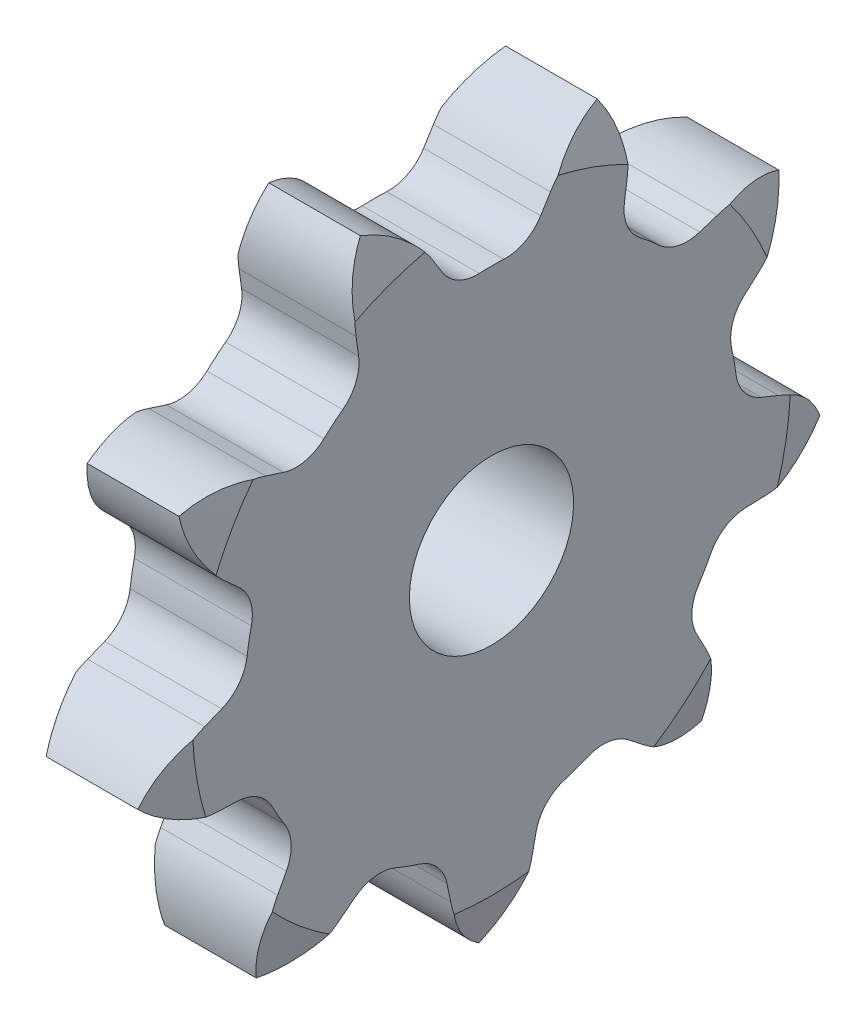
ISO-10303-21;
HEADER;
FILE_DESCRIPTION(('STEP AP214'),'2;1');
FILE_NAME('part.step','',(''),(''),'','','');
FILE_SCHEMA(('AUTOMOTIVE_DESIGN { 1 0 10303 214 1 1 1 1 }'));
ENDSEC;
DATA;
#1=APPLICATION_CONTEXT('core data for automotive mechanical design processes');
#2=APPLICATION_PROTOCOL_DEFINITION('international standard','automotive_design',2000,#1);
#3=PRODUCT_CONTEXT('',#1,'mechanical');
#4=PRODUCT('Part','Part','',(#3));
#5=PRODUCT_RELATED_PRODUCT_CATEGORY('part','',(#4));
#6=PRODUCT_DEFINITION_FORMATION('','',#4);
#7=PRODUCT_DEFINITION_CONTEXT('part definition',#1,'design');
#8=PRODUCT_DEFINITION('design','',#6,#7);
#9=PRODUCT_DEFINITION_SHAPE('','',#8);
#10=(LENGTH_UNIT() NAMED_UNIT(*) SI_UNIT(.MILLI.,.METRE.));
#11=(NAMED_UNIT(*) PLANE_ANGLE_UNIT() SI_UNIT($,.RADIAN.));
#12=(NAMED_UNIT(*) SI_UNIT($,.STERADIAN.) SOLID_ANGLE_UNIT());
#13=UNCERTAINTY_MEASURE_WITH_UNIT(LENGTH_MEASURE(1.E-05),#10,'distance_accuracy_value','');
#14=(GEOMETRIC_REPRESENTATION_CONTEXT(3) GLOBAL_UNCERTAINTY_ASSIGNED_CONTEXT((#13)) GLOBAL_UNIT_ASSIGNED_CONTEXT((#10,
#11,#12)) REPRESENTATION_CONTEXT('',''));
#15=CARTESIAN_POINT('',(0.,0.,0.));
#16=DIRECTION('',(0.,0.,1.));
#17=DIRECTION('',(1.,0.,0.));
#18=AXIS2_PLACEMENT_3D('',#15,#16,#17);
#19=CARTESIAN_POINT('',(36.195,0.,0.));
#20=DIRECTION('',(-1.,0.,0.));
#21=DIRECTION('',(0.,0.,1.));
#22=AXIS2_PLACEMENT_3D('',#19,#20,#21);
#23=PLANE('',#22);
#24=CARTESIAN_POINT('',(36.195,0.,0.));
#25=DIRECTION('',(-1.,0.,0.));
#26=DIRECTION('',(0.,0.,1.));
#27=AXIS2_PLACEMENT_3D('',#24,#25,#26);
#28=CIRCLE('',#27,25.4);
#29=CARTESIAN_POINT('',(36.195,0.,25.4));
#30=VERTEX_POINT('',#29);
#31=EDGE_CURVE('E579',#30,#30,#28,.F.);
#32=ORIENTED_EDGE('',*,*,#31,.F.);
#33=EDGE_LOOP('',(#32));
#34=FACE_BOUND('',#33,.T.);
#35=CARTESIAN_POINT('',(36.195,82.7014637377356,10.4580869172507));
#36=DIRECTION('',(-1.,0.,0.));
#37=DIRECTION('',(0.,-0.642787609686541,0.766044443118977));
#38=AXIS2_PLACEMENT_3D('',#35,#36,#37);
#39=CIRCLE('',#38,31.75);
#40=CARTESIAN_POINT('',(36.195,78.2827177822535,41.8990980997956));
#41=VERTEX_POINT('',#40);
#42=CARTESIAN_POINT('',(36.195,82.3055034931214,42.2056177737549));
#43=VERTEX_POINT('',#42);
#44=EDGE_CURVE('E896',#41,#43,#39,.T.);
#45=ORIENTED_EDGE('',*,*,#44,.F.);
#46=DIRECTION('',(0.,0.99026806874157,0.139173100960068));
#47=VECTOR('',#46,1.);
#48=CARTESIAN_POINT('',(36.195,72.6233357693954,41.1037238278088));
#49=LINE('',#48,#47);
#50=CARTESIAN_POINT('',(36.195,72.6233357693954,41.1037238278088));
#51=VERTEX_POINT('',#50);
#52=EDGE_CURVE('E893',#51,#41,#49,.T.);
#53=ORIENTED_EDGE('',*,*,#52,.F.);
#54=CARTESIAN_POINT('',(36.195,70.8558373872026,53.6801283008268));
#55=DIRECTION('',(1.,0.,0.));
#56=DIRECTION('',(0.,0.642787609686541,-0.766044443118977));
#57=AXIS2_PLACEMENT_3D('',#54,#55,#56);
#58=CIRCLE('',#57,12.7);
#59=CARTESIAN_POINT('',(36.195,60.7328677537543,46.0110028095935));
#60=VERTEX_POINT('',#59);
#61=EDGE_CURVE('E891',#60,#51,#58,.T.);
#62=ORIENTED_EDGE('',*,*,#61,.F.);
#63=CARTESIAN_POINT('',(36.195,0.,0.));
#64=DIRECTION('',(-1.,0.,0.));
#65=DIRECTION('',(0.,0.642787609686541,-0.766044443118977));
#66=AXIS2_PLACEMENT_3D('',#63,#64,#65);
#67=CIRCLE('',#66,76.193789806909);
#68=CARTESIAN_POINT('',(36.195,55.8581441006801,51.8204722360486));
#69=VERTEX_POINT('',#68);
#70=EDGE_CURVE('E904',#69,#60,#67,.T.);
#71=ORIENTED_EDGE('',*,*,#70,.F.);
#72=CARTESIAN_POINT('',(36.195,65.1685935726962,60.457921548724));
#73=DIRECTION('',(1.,0.,0.));
#74=DIRECTION('',(0.,-0.642787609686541,0.766044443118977));
#75=AXIS2_PLACEMENT_3D('',#72,#73,#74);
#76=CIRCLE('',#75,12.7);
#77=CARTESIAN_POINT('',(36.195,53.0901758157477,64.3824373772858));
#78=VERTEX_POINT('',#77);
#79=EDGE_CURVE('E902',#78,#69,#76,.T.);
#80=ORIENTED_EDGE('',*,*,#79,.F.);
#81=DIRECTION('',(0.,-0.309016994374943,-0.951056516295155));
#82=VECTOR('',#81,1.);
#83=CARTESIAN_POINT('',(36.195,53.0901758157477,64.3824373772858));
#84=LINE('',#83,#82);
#85=CARTESIAN_POINT('',(36.195,54.8562079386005,69.8177253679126));
#86=VERTEX_POINT('',#85);
#87=EDGE_CURVE('E900',#86,#78,#84,.T.);
#88=ORIENTED_EDGE('',*,*,#87,.F.);
#89=CARTESIAN_POINT('',(36.195,24.6601635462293,79.6290149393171));
#90=DIRECTION('',(-1.,0.,0.));
#91=DIRECTION('',(0.,0.642787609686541,-0.766044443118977));
#92=AXIS2_PLACEMENT_3D('',#89,#90,#91);
#93=CIRCLE('',#92,31.75);
#94=CARTESIAN_POINT('',(36.195,55.8566202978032,73.72616934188));
#95=VERTEX_POINT('',#94);
#96=EDGE_CURVE('E898',#95,#86,#93,.T.);
#97=ORIENTED_EDGE('',*,*,#96,.F.);
#98=CARTESIAN_POINT('',(36.195,0.,0.));
#99=DIRECTION('',(-1.,0.,0.));
#100=DIRECTION('',(0.,0.,1.));
#101=AXIS2_PLACEMENT_3D('',#98,#99,#100);
#102=CIRCLE('',#101,92.4960003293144);
#103=CARTESIAN_POINT('',(36.195,35.9204254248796,85.2363368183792));
#104=VERTEX_POINT('',#103);
#105=EDGE_CURVE('E1237',#104,#95,#102,.T.);
#106=ORIENTED_EDGE('',*,*,#105,.F.);
#107=CARTESIAN_POINT('',(36.195,56.6306680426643,61.1708355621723));
#108=DIRECTION('',(-1.,0.,0.));
#109=DIRECTION('',(0.,-0.984807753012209,0.173648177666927));
#110=AXIS2_PLACEMENT_3D('',#107,#108,#109);
#111=CIRCLE('',#110,31.75);
#112=CARTESIAN_POINT('',(36.195,33.0358198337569,82.4157323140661));
#113=VERTEX_POINT('',#112);
#114=EDGE_CURVE('E848',#113,#104,#111,.T.);
#115=ORIENTED_EDGE('',*,*,#114,.F.);
#116=DIRECTION('',(0.,0.669130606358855,0.743144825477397));
#117=VECTOR('',#116,1.);
#118=CARTESIAN_POINT('',(36.195,29.2117384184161,78.1686596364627));
#119=LINE('',#118,#117);
#120=CARTESIAN_POINT('',(36.195,29.2117384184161,78.1686596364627));
#121=VERTEX_POINT('',#120);
#122=EDGE_CURVE('E845',#121,#113,#119,.T.);
#123=ORIENTED_EDGE('',*,*,#122,.F.);
#124=CARTESIAN_POINT('',(36.195,19.7737991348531,86.6666183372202));
#125=DIRECTION('',(1.,0.,0.));
#126=DIRECTION('',(0.,0.984807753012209,-0.173648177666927));
#127=AXIS2_PLACEMENT_3D('',#124,#125,#126);
#128=CIRCLE('',#127,12.7);
#129=CARTESIAN_POINT('',(36.195,16.9487733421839,74.2848079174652));
#130=VERTEX_POINT('',#129);
#131=EDGE_CURVE('E843',#130,#121,#128,.T.);
#132=ORIENTED_EDGE('',*,*,#131,.F.);
#133=CARTESIAN_POINT('',(36.195,0.,0.));
#134=DIRECTION('',(-1.,0.,0.));
#135=DIRECTION('',(0.,0.984807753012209,-0.173648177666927));
#136=AXIS2_PLACEMENT_3D('',#133,#134,#135);
#137=CIRCLE('',#136,76.193789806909);
#138=CARTESIAN_POINT('',(36.195,9.48026340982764,75.6017077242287));
#139=VERTEX_POINT('',#138);
#140=EDGE_CURVE('E856',#139,#130,#137,.T.);
#141=ORIENTED_EDGE('',*,*,#140,.F.);
#142=CARTESIAN_POINT('',(36.195,11.0604360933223,88.2030193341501));
#143=DIRECTION('',(1.,0.,0.));
#144=DIRECTION('',(0.,-0.984807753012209,0.173648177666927));
#145=AXIS2_PLACEMENT_3D('',#142,#143,#144);
#146=CIRCLE('',#145,12.7);
#147=CARTESIAN_POINT('',(36.195,-0.714798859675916,83.445515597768));
#148=VERTEX_POINT('',#147);
#149=EDGE_CURVE('E854',#148,#139,#146,.T.);
#150=ORIENTED_EDGE('',*,*,#149,.F.);
#151=DIRECTION('',(0.,0.374606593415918,-0.927183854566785));
#152=VECTOR('',#151,1.);
#153=CARTESIAN_POINT('',(36.195,-0.714798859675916,83.445515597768));
#154=LINE('',#153,#152);
#155=CARTESIAN_POINT('',(36.195,-2.85567554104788,88.7443713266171));
#156=VERTEX_POINT('',#155);
#157=EDGE_CURVE('E852',#156,#148,#154,.T.);
#158=ORIENTED_EDGE('',*,*,#157,.F.);
#159=CARTESIAN_POINT('',(36.195,-32.2937629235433,76.8506119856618));
#160=DIRECTION('',(-1.,0.,0.));
#161=DIRECTION('',(0.,0.984807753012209,-0.173648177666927));
#162=AXIS2_PLACEMENT_3D('',#159,#160,#161);
#163=CIRCLE('',#162,31.75);
#164=CARTESIAN_POINT('',(36.195,-4.60161457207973,92.3814657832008));
#165=VERTEX_POINT('',#164);
#166=EDGE_CURVE('E850',#165,#156,#163,.T.);
#167=ORIENTED_EDGE('',*,*,#166,.F.);
#168=CARTESIAN_POINT('',(36.195,-27.2722189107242,88.3840265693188));
#169=VERTEX_POINT('',#168);
#170=EDGE_CURVE('E1600',#169,#165,#102,.T.);
#171=ORIENTED_EDGE('',*,*,#170,.F.);
#172=CARTESIAN_POINT('',(36.195,4.06175339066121,83.261070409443));
#173=DIRECTION('',(-1.,0.,0.));
#174=DIRECTION('',(0.,-0.866025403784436,-0.500000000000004));
#175=AXIS2_PLACEMENT_3D('',#172,#173,#174);
#176=CIRCLE('',#175,31.75);
#177=CARTESIAN_POINT('',(36.195,-27.6689053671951,84.3691294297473));
#178=VERTEX_POINT('',#177);
#179=EDGE_CURVE('E800',#178,#169,#176,.T.);
#180=ORIENTED_EDGE('',*,*,#179,.F.);
#181=DIRECTION('',(0.,0.0348994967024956,0.999390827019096));
#182=VECTOR('',#181,1.);
#183=CARTESIAN_POINT('',(36.195,-27.8683559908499,78.6576108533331));
#184=LINE('',#183,#182);
#185=CARTESIAN_POINT('',(36.195,-27.8683559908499,78.6576108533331));
#186=VERTEX_POINT('',#185);
#187=EDGE_CURVE('E797',#186,#178,#184,.T.);
#188=ORIENTED_EDGE('',*,*,#187,.F.);
#189=CARTESIAN_POINT('',(36.195,-40.5606194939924,79.1008344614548));
#190=DIRECTION('',(1.,0.,0.));
#191=DIRECTION('',(0.,0.866025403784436,0.500000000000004));
#192=AXIS2_PLACEMENT_3D('',#189,#190,#191);
#193=CIRCLE('',#192,12.7);
#194=CARTESIAN_POINT('',(36.195,-34.7658404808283,67.7999258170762));
#195=VERTEX_POINT('',#194);
#196=EDGE_CURVE('E795',#195,#186,#193,.T.);
#197=ORIENTED_EDGE('',*,*,#196,.F.);
#198=CARTESIAN_POINT('',(36.195,0.,0.));
#199=DIRECTION('',(-1.,0.,0.));
#200=DIRECTION('',(0.,0.866025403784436,0.500000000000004));
#201=AXIS2_PLACEMENT_3D('',#198,#199,#200);
#202=CIRCLE('',#201,76.193789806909);
#203=CARTESIAN_POINT('',(36.195,-41.3335378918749,64.0080639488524));
#204=VERTEX_POINT('',#203);
#205=EDGE_CURVE('E808',#204,#195,#202,.T.);
#206=ORIENTED_EDGE('',*,*,#205,.F.);
#207=CARTESIAN_POINT('',(36.195,-48.2230223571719,74.6769441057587));
#208=DIRECTION('',(1.,0.,0.));
#209=DIRECTION('',(0.,-0.866025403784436,-0.500000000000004));
#210=AXIS2_PLACEMENT_3D('',#207,#208,#209);
#211=CIRCLE('',#210,12.7);
#212=CARTESIAN_POINT('',(36.195,-54.1853112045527,63.4635096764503));
#213=VERTEX_POINT('',#212);
#214=EDGE_CURVE('E806',#213,#204,#211,.T.);
#215=ORIENTED_EDGE('',*,*,#214,.F.);
#216=DIRECTION('',(0.,0.882947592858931,-0.469471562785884));
#217=VECTOR('',#216,1.);
#218=CARTESIAN_POINT('',(36.195,-54.1853112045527,63.4635096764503));
#219=LINE('',#218,#217);
#220=CARTESIAN_POINT('',(36.195,-59.2313566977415,66.1465396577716));
#221=VERTEX_POINT('',#220);
#222=EDGE_CURVE('E804',#221,#213,#219,.T.);
#223=ORIENTED_EDGE('',*,*,#222,.F.);
#224=CARTESIAN_POINT('',(36.195,-74.1370788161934,38.1129535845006));
#225=DIRECTION('',(-1.,0.,0.));
#226=DIRECTION('',(0.,0.866025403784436,0.500000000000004));
#227=AXIS2_PLACEMENT_3D('',#224,#225,#226);
#228=CIRCLE('',#227,31.75);
#229=CARTESIAN_POINT('',(36.195,-62.9067028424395,67.810447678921));
#230=VERTEX_POINT('',#229);
#231=EDGE_CURVE('E802',#230,#221,#228,.T.);
#232=ORIENTED_EDGE('',*,*,#231,.F.);
#233=CARTESIAN_POINT('',(36.195,-77.7038889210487,50.1758480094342));
#234=VERTEX_POINT('',#233);
#235=EDGE_CURVE('E1603',#234,#230,#102,.T.);
#236=ORIENTED_EDGE('',*,*,#235,.F.);
#237=CARTESIAN_POINT('',(36.195,-50.4077008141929,66.392525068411));
#238=DIRECTION('',(-1.,0.,0.));
#239=DIRECTION('',(0.,-0.342020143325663,-0.939692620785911));
#240=AXIS2_PLACEMENT_3D('',#237,#238,#239);
#241=CIRCLE('',#240,31.75);
#242=CARTESIAN_POINT('',(36.195,-75.4270422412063,46.8452732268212));
#243=VERTEX_POINT('',#242);
#244=EDGE_CURVE('E752',#243,#234,#241,.T.);
#245=ORIENTED_EDGE('',*,*,#244,.F.);
#246=DIRECTION('',(0.,-0.615661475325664,0.788010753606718));
#247=VECTOR('',#246,1.);
#248=CARTESIAN_POINT('',(36.195,-71.9085369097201,42.3417917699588));
#249=LINE('',#248,#247);
#250=CARTESIAN_POINT('',(36.195,-71.9085369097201,42.3417917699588));
#251=VERTEX_POINT('',#250);
#252=EDGE_CURVE('E749',#251,#243,#249,.T.);
#253=ORIENTED_EDGE('',*,*,#252,.F.);
#254=CARTESIAN_POINT('',(36.195,-81.9162734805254,34.5228910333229));
#255=DIRECTION('',(1.,0.,0.));
#256=DIRECTION('',(0.,0.342020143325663,0.939692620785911));
#257=AXIS2_PLACEMENT_3D('',#254,#255,#256);
#258=CIRCLE('',#257,12.7);
#259=CARTESIAN_POINT('',(36.195,-70.2131311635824,29.5907049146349));
#260=VERTEX_POINT('',#259);
#261=EDGE_CURVE('E747',#260,#251,#258,.T.);
#262=ORIENTED_EDGE('',*,*,#261,.F.);
#263=CARTESIAN_POINT('',(36.195,0.,0.));
#264=DIRECTION('',(-1.,0.,0.));
#265=DIRECTION('',(0.,0.342020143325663,0.939692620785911));
#266=AXIS2_PLACEMENT_3D('',#263,#264,#265);
#267=CIRCLE('',#266,76.193789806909);
#268=CARTESIAN_POINT('',(36.195,-72.8069174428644,22.4643356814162));
#269=VERTEX_POINT('',#268);
#270=EDGE_CURVE('E760',#269,#260,#267,.T.);
#271=ORIENTED_EDGE('',*,*,#270,.F.);
#272=CARTESIAN_POINT('',(36.195,-84.9423927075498,26.2086967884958));
#273=DIRECTION('',(1.,0.,0.));
#274=DIRECTION('',(0.,-0.342020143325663,-0.939692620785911));
#275=AXIS2_PLACEMENT_3D('',#272,#273,#274);
#276=CIRCLE('',#275,12.7);
#277=CARTESIAN_POINT('',(36.195,-82.3019142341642,13.7862222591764));
#278=VERTEX_POINT('',#277);
#279=EDGE_CURVE('E758',#278,#269,#276,.T.);
#280=ORIENTED_EDGE('',*,*,#279,.F.);
#281=DIRECTION('',(0.,0.978147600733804,0.207911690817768));
#282=VECTOR('',#281,1.);
#283=CARTESIAN_POINT('',(36.195,-82.3019142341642,13.7862222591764));
#284=LINE('',#283,#282);
#285=CARTESIAN_POINT('',(36.195,-87.8920277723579,12.5980069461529));
#286=VERTEX_POINT('',#285);
#287=EDGE_CURVE('E756',#286,#278,#284,.T.);
#288=ORIENTED_EDGE('',*,*,#287,.F.);
#289=CARTESIAN_POINT('',(36.195,-81.2908315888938,-18.4581793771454));
#290=DIRECTION('',(-1.,0.,0.));
#291=DIRECTION('',(0.,0.342020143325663,0.939692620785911));
#292=AXIS2_PLACEMENT_3D('',#289,#290,#291);
#293=CIRCLE('',#292,31.75);
#294=CARTESIAN_POINT('',(36.195,-91.7770457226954,11.5101674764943));
#295=VERTEX_POINT('',#294);
#296=EDGE_CURVE('E754',#295,#286,#293,.T.);
#297=ORIENTED_EDGE('',*,*,#296,.F.);
#298=CARTESIAN_POINT('',(36.195,-91.777045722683,-11.5101674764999));
#299=VERTEX_POINT('',#298);
#300=EDGE_CURVE('E1605',#299,#295,#102,.T.);
#301=ORIENTED_EDGE('',*,*,#300,.F.);
#302=CARTESIAN_POINT('',(36.195,-81.290831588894,18.4581793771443));
#303=DIRECTION('',(-1.,0.,0.));
#304=DIRECTION('',(0.,0.342020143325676,-0.939692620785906));
#305=AXIS2_PLACEMENT_3D('',#302,#303,#304);
#306=CIRCLE('',#305,31.75);
#307=CARTESIAN_POINT('',(36.195,-87.8920277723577,-12.5980069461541));
#308=VERTEX_POINT('',#307);
#309=EDGE_CURVE('E704',#308,#299,#306,.T.);
#310=ORIENTED_EDGE('',*,*,#309,.F.);
#311=DIRECTION('',(0.,-0.978147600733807,0.207911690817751));
#312=VECTOR('',#311,1.);
#313=CARTESIAN_POINT('',(36.195,-82.301914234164,-13.7862222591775));
#314=LINE('',#313,#312);
#315=CARTESIAN_POINT('',(36.195,-82.301914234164,-13.7862222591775));
#316=VERTEX_POINT('',#315);
#317=EDGE_CURVE('E701',#316,#308,#314,.T.);
#318=ORIENTED_EDGE('',*,*,#317,.F.);
#319=CARTESIAN_POINT('',(36.195,-84.9423927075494,-26.2086967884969));
#320=DIRECTION('',(1.,0.,0.));
#321=DIRECTION('',(0.,-0.342020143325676,0.939692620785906));
#322=AXIS2_PLACEMENT_3D('',#319,#320,#321);
#323=CIRCLE('',#322,12.7);
#324=CARTESIAN_POINT('',(36.195,-72.8069174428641,-22.4643356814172));
#325=VERTEX_POINT('',#324);
#326=EDGE_CURVE('E699',#325,#316,#323,.T.);
#327=ORIENTED_EDGE('',*,*,#326,.F.);
#328=CARTESIAN_POINT('',(36.195,0.,0.));
#329=DIRECTION('',(-1.,0.,0.));
#330=DIRECTION('',(0.,-0.342020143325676,0.939692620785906));
#331=AXIS2_PLACEMENT_3D('',#328,#329,#330);
#332=CIRCLE('',#331,76.193789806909);
#333=CARTESIAN_POINT('',(36.195,-70.213131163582,-29.5907049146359));
#334=VERTEX_POINT('',#333);
#335=EDGE_CURVE('E712',#334,#325,#332,.T.);
#336=ORIENTED_EDGE('',*,*,#335,.F.);
#337=CARTESIAN_POINT('',(36.195,-81.916273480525,-34.522891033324));
#338=DIRECTION('',(1.,0.,0.));
#339=DIRECTION('',(0.,0.342020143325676,-0.939692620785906));
#340=AXIS2_PLACEMENT_3D('',#337,#338,#339);
#341=CIRCLE('',#340,12.7);
#342=CARTESIAN_POINT('',(36.195,-71.9085369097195,-42.3417917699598));
#343=VERTEX_POINT('',#342);
#344=EDGE_CURVE('E710',#343,#334,#341,.T.);
#345=ORIENTED_EDGE('',*,*,#344,.F.);
#346=DIRECTION('',(0.,0.61566147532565,0.788010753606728));
#347=VECTOR('',#346,1.);
#348=CARTESIAN_POINT('',(36.195,-71.9085369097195,-42.3417917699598));
#349=LINE('',#348,#347);
#350=CARTESIAN_POINT('',(36.195,-75.4270422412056,-46.8452732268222));
#351=VERTEX_POINT('',#350);
#352=EDGE_CURVE('E708',#351,#343,#349,.T.);
#353=ORIENTED_EDGE('',*,*,#352,.F.);
#354=CARTESIAN_POINT('',(36.195,-50.407700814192,-66.3925250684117));
#355=DIRECTION('',(-1.,0.,0.));
#356=DIRECTION('',(0.,-0.342020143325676,0.939692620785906));
#357=AXIS2_PLACEMENT_3D('',#354,#355,#356);
#358=CIRCLE('',#357,31.75);
#359=CARTESIAN_POINT('',(36.195,-77.7038889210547,-50.1758480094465));
#360=VERTEX_POINT('',#359);
#361=EDGE_CURVE('E706',#360,#351,#358,.T.);
#362=ORIENTED_EDGE('',*,*,#361,.F.);
#363=CARTESIAN_POINT('',(36.195,-62.9067028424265,-67.8104476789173));
#364=VERTEX_POINT('',#363);
#365=EDGE_CURVE('E2208',#364,#360,#102,.T.);
#366=ORIENTED_EDGE('',*,*,#365,.F.);
#367=CARTESIAN_POINT('',(36.195,-74.1370788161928,-38.1129535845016));
#368=DIRECTION('',(-1.,0.,0.));
#369=DIRECTION('',(0.,0.866025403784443,-0.499999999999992));
#370=AXIS2_PLACEMENT_3D('',#367,#368,#369);
#371=CIRCLE('',#370,31.75);
#372=CARTESIAN_POINT('',(36.195,-59.2313566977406,-66.1465396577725));
#373=VERTEX_POINT('',#372);
#374=EDGE_CURVE('E656',#373,#364,#371,.T.);
#375=ORIENTED_EDGE('',*,*,#374,.F.);
#376=DIRECTION('',(0.,-0.882947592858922,-0.4694715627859));
#377=VECTOR('',#376,1.);
#378=CARTESIAN_POINT('',(36.195,-54.1853112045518,-63.463509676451));
#379=LINE('',#378,#377);
#380=CARTESIAN_POINT('',(36.195,-54.1853112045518,-63.463509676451));
#381=VERTEX_POINT('',#380);
#382=EDGE_CURVE('E653',#381,#373,#379,.T.);
#383=ORIENTED_EDGE('',*,*,#382,.F.);
#384=CARTESIAN_POINT('',(36.195,-48.2230223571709,-74.6769441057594));
#385=DIRECTION('',(1.,0.,0.));
#386=DIRECTION('',(0.,-0.866025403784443,0.499999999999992));
#387=AXIS2_PLACEMENT_3D('',#384,#385,#386);
#388=CIRCLE('',#387,12.7);
#389=CARTESIAN_POINT('',(36.195,-41.3335378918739,-64.0080639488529));
#390=VERTEX_POINT('',#389);
#391=EDGE_CURVE('E651',#390,#381,#388,.T.);
#392=ORIENTED_EDGE('',*,*,#391,.F.);
#393=CARTESIAN_POINT('',(36.195,0.,0.));
#394=DIRECTION('',(-1.,0.,0.));
#395=DIRECTION('',(0.,-0.866025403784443,0.499999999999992));
#396=AXIS2_PLACEMENT_3D('',#393,#394,#395);
#397=CIRCLE('',#396,76.193789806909);
#398=CARTESIAN_POINT('',(36.195,-34.7658404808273,-67.7999258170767));
#399=VERTEX_POINT('',#398);
#400=EDGE_CURVE('E664',#399,#390,#397,.T.);
#401=ORIENTED_EDGE('',*,*,#400,.F.);
#402=CARTESIAN_POINT('',(36.195,-40.5606194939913,-79.1008344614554));
#403=DIRECTION('',(1.,0.,0.));
#404=DIRECTION('',(0.,0.866025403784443,-0.499999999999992));
#405=AXIS2_PLACEMENT_3D('',#402,#403,#404);
#406=CIRCLE('',#405,12.7);
#407=CARTESIAN_POINT('',(36.195,-27.8683559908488,-78.6576108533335));
#408=VERTEX_POINT('',#407);
#409=EDGE_CURVE('E662',#408,#399,#406,.T.);
#410=ORIENTED_EDGE('',*,*,#409,.F.);
#411=DIRECTION('',(0.,-0.0348994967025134,0.999390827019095));
#412=VECTOR('',#411,1.);
#413=CARTESIAN_POINT('',(36.195,-27.8683559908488,-78.6576108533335));
#414=LINE('',#413,#412);
#415=CARTESIAN_POINT('',(36.195,-27.6689053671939,-84.3691294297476));
#416=VERTEX_POINT('',#415);
#417=EDGE_CURVE('E660',#416,#408,#414,.T.);
#418=ORIENTED_EDGE('',*,*,#417,.F.);
#419=CARTESIAN_POINT('',(36.195,4.06175339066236,-83.2610704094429));
#420=DIRECTION('',(-1.,0.,0.));
#421=DIRECTION('',(0.,-0.866025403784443,0.499999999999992));
#422=AXIS2_PLACEMENT_3D('',#419,#420,#421);
#423=CIRCLE('',#422,31.75);
#424=CARTESIAN_POINT('',(36.195,-27.2722189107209,-88.3840265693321));
#425=VERTEX_POINT('',#424);
#426=EDGE_CURVE('E658',#425,#416,#423,.T.);
#427=ORIENTED_EDGE('',*,*,#426,.F.);
#428=CARTESIAN_POINT('',(36.195,-4.60161457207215,-92.3814657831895));
#429=VERTEX_POINT('',#428);
#430=EDGE_CURVE('E2187',#429,#425,#102,.T.);
#431=ORIENTED_EDGE('',*,*,#430,.F.);
#432=CARTESIAN_POINT('',(36.195,-32.2937629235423,-76.8506119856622));
#433=DIRECTION('',(-1.,0.,0.));
#434=DIRECTION('',(0.,0.984807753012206,0.17364817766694));
#435=AXIS2_PLACEMENT_3D('',#432,#433,#434);
#436=CIRCLE('',#435,31.75);
#437=CARTESIAN_POINT('',(36.195,-2.8556755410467,-88.7443713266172));
#438=VERTEX_POINT('',#437);
#439=EDGE_CURVE('E608',#438,#429,#436,.T.);
#440=ORIENTED_EDGE('',*,*,#439,.F.);
#441=DIRECTION('',(0.,-0.374606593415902,-0.927183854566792));
#442=VECTOR('',#441,1.);
#443=CARTESIAN_POINT('',(36.195,-0.714798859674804,-83.4455155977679));
#444=LINE('',#443,#442);
#445=CARTESIAN_POINT('',(36.195,-0.714798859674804,-83.4455155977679));
#446=VERTEX_POINT('',#445);
#447=EDGE_CURVE('E605',#446,#438,#444,.T.);
#448=ORIENTED_EDGE('',*,*,#447,.F.);
#449=CARTESIAN_POINT('',(36.195,11.0604360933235,-88.2030193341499));
#450=DIRECTION('',(1.,0.,0.));
#451=DIRECTION('',(0.,-0.984807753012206,-0.17364817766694));
#452=AXIS2_PLACEMENT_3D('',#449,#450,#451);
#453=CIRCLE('',#452,12.7);
#454=CARTESIAN_POINT('',(36.195,9.48026340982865,-75.6017077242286));
#455=VERTEX_POINT('',#454);
#456=EDGE_CURVE('E603',#455,#446,#453,.T.);
#457=ORIENTED_EDGE('',*,*,#456,.F.);
#458=CARTESIAN_POINT('',(36.195,0.,0.));
#459=DIRECTION('',(-1.,0.,0.));
#460=DIRECTION('',(0.,-0.984807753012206,-0.17364817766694));
#461=AXIS2_PLACEMENT_3D('',#458,#459,#460);
#462=CIRCLE('',#461,76.193789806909);
#463=CARTESIAN_POINT('',(36.195,16.9487733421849,-74.284807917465));
#464=VERTEX_POINT('',#463);
#465=EDGE_CURVE('E616',#464,#455,#462,.T.);
#466=ORIENTED_EDGE('',*,*,#465,.F.);
#467=CARTESIAN_POINT('',(36.195,19.7737991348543,-86.66661833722));
#468=DIRECTION('',(1.,0.,0.));
#469=DIRECTION('',(0.,0.984807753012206,0.17364817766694));
#470=AXIS2_PLACEMENT_3D('',#467,#468,#469);
#471=CIRCLE('',#470,12.7);
#472=CARTESIAN_POINT('',(36.195,29.2117384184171,-78.1686596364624));
#473=VERTEX_POINT('',#472);
#474=EDGE_CURVE('E614',#473,#464,#471,.T.);
#475=ORIENTED_EDGE('',*,*,#474,.F.);
#476=DIRECTION('',(0.,-0.669130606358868,0.743144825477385));
#477=VECTOR('',#476,1.);
#478=CARTESIAN_POINT('',(36.195,29.2117384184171,-78.1686596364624));
#479=LINE('',#478,#477);
#480=CARTESIAN_POINT('',(36.195,33.035819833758,-82.4157323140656));
#481=VERTEX_POINT('',#480);
#482=EDGE_CURVE('E612',#481,#473,#479,.T.);
#483=ORIENTED_EDGE('',*,*,#482,.F.);
#484=CARTESIAN_POINT('',(36.195,56.6306680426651,-61.1708355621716));
#485=DIRECTION('',(-1.,0.,0.));
#486=DIRECTION('',(0.,-0.984807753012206,-0.17364817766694));
#487=AXIS2_PLACEMENT_3D('',#484,#485,#486);
#488=CIRCLE('',#487,31.75);
#489=CARTESIAN_POINT('',(36.195,35.9204254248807,-85.2363368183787));
#490=VERTEX_POINT('',#489);
#491=EDGE_CURVE('E610',#490,#481,#488,.T.);
#492=ORIENTED_EDGE('',*,*,#491,.F.);
#493=CARTESIAN_POINT('',(36.195,55.8566202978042,-73.7261693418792));
#494=VERTEX_POINT('',#493);
#495=EDGE_CURVE('E1587',#494,#490,#102,.T.);
#496=ORIENTED_EDGE('',*,*,#495,.F.);
#497=CARTESIAN_POINT('',(36.195,24.6601635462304,-79.6290149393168));
#498=DIRECTION('',(-1.,0.,0.));
#499=DIRECTION('',(0.,0.64278760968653,0.766044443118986));
#500=AXIS2_PLACEMENT_3D('',#497,#498,#499);
#501=CIRCLE('',#500,31.75);
#502=CARTESIAN_POINT('',(36.195,54.8562079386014,-69.8177253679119));
#503=VERTEX_POINT('',#502);
#504=EDGE_CURVE('E564',#503,#494,#501,.T.);
#505=ORIENTED_EDGE('',*,*,#504,.F.);
#506=DIRECTION('',(0.,0.30901699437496,-0.95105651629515));
#507=VECTOR('',#506,1.);
#508=CARTESIAN_POINT('',(36.195,53.0901758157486,-64.3824373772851));
#509=LINE('',#508,#507);
#510=CARTESIAN_POINT('',(36.195,53.0901758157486,-64.3824373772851));
#511=VERTEX_POINT('',#510);
#512=EDGE_CURVE('E550',#511,#503,#509,.T.);
#513=ORIENTED_EDGE('',*,*,#512,.F.);
#514=CARTESIAN_POINT('',(36.195,65.168593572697,-60.4579215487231));
#515=DIRECTION('',(1.,0.,0.));
#516=DIRECTION('',(0.,-0.64278760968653,-0.766044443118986));
#517=AXIS2_PLACEMENT_3D('',#514,#515,#516);
#518=CIRCLE('',#517,12.7);
#519=CARTESIAN_POINT('',(36.195,55.8581441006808,-51.8204722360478));
#520=VERTEX_POINT('',#519);
#521=EDGE_CURVE('E540',#520,#511,#518,.T.);
#522=ORIENTED_EDGE('',*,*,#521,.F.);
#523=CARTESIAN_POINT('',(36.195,0.,0.));
#524=DIRECTION('',(-1.,0.,0.));
#525=DIRECTION('',(0.,-0.64278760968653,-0.766044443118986));
#526=AXIS2_PLACEMENT_3D('',#523,#524,#525);
#527=CIRCLE('',#526,76.193789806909);
#528=CARTESIAN_POINT('',(36.195,60.7328677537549,-46.0110028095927));
#529=VERTEX_POINT('',#528);
#530=EDGE_CURVE('E575',#529,#520,#527,.T.);
#531=ORIENTED_EDGE('',*,*,#530,.F.);
#532=CARTESIAN_POINT('',(36.195,70.8558373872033,-53.6801283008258));
#533=DIRECTION('',(1.,0.,0.));
#534=DIRECTION('',(0.,0.64278760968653,0.766044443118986));
#535=AXIS2_PLACEMENT_3D('',#532,#533,#534);
#536=CIRCLE('',#535,12.7);
#537=CARTESIAN_POINT('',(36.195,72.623335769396,-41.1037238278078));
#538=VERTEX_POINT('',#537);
#539=EDGE_CURVE('E573',#538,#529,#536,.T.);
#540=ORIENTED_EDGE('',*,*,#539,.F.);
#541=DIRECTION('',(0.,-0.990268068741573,0.13917310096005));
#542=VECTOR('',#541,1.);
#543=CARTESIAN_POINT('',(36.195,72.623335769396,-41.1037238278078));
#544=LINE('',#543,#542);
#545=CARTESIAN_POINT('',(36.195,78.2827177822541,-41.8990980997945));
#546=VERTEX_POINT('',#545);
#547=EDGE_CURVE('E571',#546,#538,#544,.T.);
#548=ORIENTED_EDGE('',*,*,#547,.F.);
#549=CARTESIAN_POINT('',(36.195,82.7014637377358,-10.4580869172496));
#550=DIRECTION('',(-1.,0.,0.));
#551=DIRECTION('',(0.,-0.64278760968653,-0.766044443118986));
#552=AXIS2_PLACEMENT_3D('',#549,#550,#551);
#553=CIRCLE('',#552,31.75);
#554=CARTESIAN_POINT('',(36.195,82.305503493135,-42.2056177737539));
#555=VERTEX_POINT('',#554);
#556=EDGE_CURVE('E566',#555,#546,#553,.T.);
#557=ORIENTED_EDGE('',*,*,#556,.F.);
#558=CARTESIAN_POINT('',(36.195,90.1789217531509,-20.5735788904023));
#559=VERTEX_POINT('',#558);
#560=EDGE_CURVE('E1238',#559,#555,#102,.T.);
#561=ORIENTED_EDGE('',*,*,#560,.F.);
#562=CARTESIAN_POINT('',(36.195,70.0753254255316,-45.148116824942));
#563=DIRECTION('',(-1.,0.,0.));
#564=DIRECTION('',(0.,0.,1.));
#565=AXIS2_PLACEMENT_3D('',#562,#563,#564);
#566=CIRCLE('',#565,31.75);
#567=CARTESIAN_POINT('',(36.195,86.9002620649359,-18.2225897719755));
#568=VERTEX_POINT('',#567);
#569=EDGE_CURVE('E56',#568,#559,#566,.T.);
#570=ORIENTED_EDGE('',*,*,#569,.F.);
#571=DIRECTION('',(0.,0.848048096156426,-0.529919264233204));
#572=VECTOR('',#571,1.);
#573=CARTESIAN_POINT('',(36.195,82.0536671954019,-15.1941011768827));
#574=LINE('',#573,#572);
#575=CARTESIAN_POINT('',(36.195,82.0536671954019,-15.1941011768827));
#576=VERTEX_POINT('',#575);
#577=EDGE_CURVE('E1618',#576,#568,#574,.T.);
#578=ORIENTED_EDGE('',*,*,#577,.F.);
#579=CARTESIAN_POINT('',(36.195,88.7836418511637,-4.42389035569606));
#580=DIRECTION('',(1.,0.,0.));
#581=DIRECTION('',(0.,0.,-1.));
#582=AXIS2_PLACEMENT_3D('',#579,#580,#581);
#583=CIRCLE('',#582,12.7);
#584=CARTESIAN_POINT('',(36.195,76.0993783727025,-3.79186186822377));
#585=VERTEX_POINT('',#584);
#586=EDGE_CURVE('E1563',#585,#576,#583,.T.);
#587=ORIENTED_EDGE('',*,*,#586,.F.);
#588=CARTESIAN_POINT('',(36.195,0.,0.));
#589=DIRECTION('',(-1.,0.,0.));
#590=DIRECTION('',(0.,0.,-1.));
#591=AXIS2_PLACEMENT_3D('',#588,#589,#590);
#592=CIRCLE('',#591,76.193789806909);
#593=CARTESIAN_POINT('',(36.195,76.0993783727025,3.79186186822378));
#594=VERTEX_POINT('',#593);
#595=EDGE_CURVE('E1567',#594,#585,#592,.T.);
#596=ORIENTED_EDGE('',*,*,#595,.F.);
#597=CARTESIAN_POINT('',(36.195,88.7836418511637,4.42389035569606));
#598=DIRECTION('',(1.,0.,0.));
#599=DIRECTION('',(0.,0.,1.));
#600=AXIS2_PLACEMENT_3D('',#597,#598,#599);
#601=CIRCLE('',#600,12.7);
#602=CARTESIAN_POINT('',(36.195,82.0536671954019,15.1941011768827));
#603=VERTEX_POINT('',#602);
#604=EDGE_CURVE('E1625',#603,#594,#601,.T.);
#605=ORIENTED_EDGE('',*,*,#604,.F.);
#606=DIRECTION('',(0.,-0.848048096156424,-0.529919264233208));
#607=VECTOR('',#606,1.);
#608=CARTESIAN_POINT('',(36.195,82.0536671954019,15.1941011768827));
#609=LINE('',#608,#607);
#610=CARTESIAN_POINT('',(36.195,86.9002620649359,18.2225897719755));
#611=VERTEX_POINT('',#610);
#612=EDGE_CURVE('E1623',#611,#603,#609,.T.);
#613=ORIENTED_EDGE('',*,*,#612,.F.);
#614=CARTESIAN_POINT('',(36.195,70.0753254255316,45.148116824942));
#615=DIRECTION('',(-1.,0.,0.));
#616=DIRECTION('',(0.,0.,-1.));
#617=AXIS2_PLACEMENT_3D('',#614,#615,#616);
#618=CIRCLE('',#617,31.75);
#619=CARTESIAN_POINT('',(36.195,90.1789217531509,20.5735788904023));
#620=VERTEX_POINT('',#619);
#621=EDGE_CURVE('E1621',#620,#611,#618,.T.);
#622=ORIENTED_EDGE('',*,*,#621,.F.);
#623=EDGE_CURVE('E1233',#43,#620,#102,.T.);
#624=ORIENTED_EDGE('',*,*,#623,.F.);
#625=EDGE_LOOP('',(#45,#53,#62,#71,#80,#88,#97,#106,#115,#123,#132,#141,#150,#158,#167,#171,
#180,#188,#197,#206,#215,#223,#232,#236,#245,#253,#262,#271,#280,#288,#297,#301,#310,#318,#327,
#336,#345,#353,#362,#366,#375,#383,#392,#401,#410,#418,#427,#431,#440,#448,#457,#466,#475,#483,
#492,#496,#505,#513,#522,#531,#540,#548,#557,#561,#570,#578,#587,#596,#605,#613,#622,#624));
#626=FACE_BOUND('',#625,.T.);
#627=ADVANCED_FACE('F33',(#34,#626),#23,.F.);
#628=CARTESIAN_POINT('',(36.195,0.,0.));
#629=DIRECTION('',(-1.,0.,0.));
#630=DIRECTION('',(0.,0.,1.));
#631=AXIS2_PLACEMENT_3D('',#628,#629,#630);
#632=CONICAL_SURFACE('',#631,92.4960003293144,1.30899693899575);
#633=CARTESIAN_POINT('',(36.1952,82.3046700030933,42.2056073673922));
#634=CARTESIAN_POINT('',(36.086037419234,82.759595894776,42.2112921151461));
#635=CARTESIAN_POINT('',(35.977823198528,83.2148130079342,42.2072012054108));
#636=CARTESIAN_POINT('',(35.7633825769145,84.1251266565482,42.1794223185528));
#637=CARTESIAN_POINT('',(35.6571562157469,84.5802231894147,42.1557339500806));
#638=CARTESIAN_POINT('',(35.3416096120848,85.9442174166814,42.0552066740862));
#639=CARTESIAN_POINT('',(35.1354140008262,86.8518524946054,41.948906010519));
#640=CARTESIAN_POINT('',(34.7374391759,88.6338613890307,41.6616688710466));
#641=CARTESIAN_POINT('',(34.5454283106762,89.5084991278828,41.4826669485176));
#642=CARTESIAN_POINT('',(34.1710850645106,91.2414080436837,41.0510385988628));
#643=CARTESIAN_POINT('',(33.9887504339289,92.0996829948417,40.7984293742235));
#644=CARTESIAN_POINT('',(33.6707052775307,93.6204392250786,40.2799829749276));
#645=CARTESIAN_POINT('',(33.5330833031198,94.2870786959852,40.0274063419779));
#646=CARTESIAN_POINT('',(33.2647601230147,95.6029758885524,39.4774234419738));
#647=CARTESIAN_POINT('',(33.1340580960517,96.2522356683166,39.1800225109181));
#648=CARTESIAN_POINT('',(32.8773019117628,97.5433733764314,38.5349703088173));
#649=CARTESIAN_POINT('',(32.7513967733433,98.1848311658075,38.1864184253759));
#650=CARTESIAN_POINT('',(32.5074200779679,99.4434452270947,37.4451726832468));
#651=CARTESIAN_POINT('',(32.3893501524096,100.060596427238,37.0524696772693));
#652=CARTESIAN_POINT('',(32.2753728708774,100.663932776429,36.6384651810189));
#653=B_SPLINE_CURVE_WITH_KNOTS('',3,(#633,#634,#635,#636,#637,#638,#639,#640,#641,#642,#643,
#644,#645,#646,#647,#648,#649,#650,#651,#652),.UNSPECIFIED.,.F.,.F.,(4,2,2,2,2,2,2,2,2,4),(0.,
1.40340478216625,2.80683759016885,5.61360247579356,8.35012030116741,11.085999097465,
13.2625962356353,15.4389344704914,17.6596284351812,19.8807833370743),.UNSPECIFIED.);
#654=CARTESIAN_POINT('',(32.2754106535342,100.663732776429,36.6386024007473));
#655=VERTEX_POINT('',#654);
#656=EDGE_CURVE('E946',#43,#655,#653,.T.);
#657=ORIENTED_EDGE('',*,*,#656,.F.);
#658=ORIENTED_EDGE('',*,*,#623,.T.);
#659=CARTESIAN_POINT('',(32.2753783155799,100.663788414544,36.6388024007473));
#660=CARTESIAN_POINT('',(32.3469020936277,100.540731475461,36.196451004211));
#661=CARTESIAN_POINT('',(32.4200244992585,100.408162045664,35.7570702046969));
#662=CARTESIAN_POINT('',(32.5694091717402,100.124291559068,34.8849553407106));
#663=CARTESIAN_POINT('',(32.6456713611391,99.9729909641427,34.4522211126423));
#664=CARTESIAN_POINT('',(32.8790456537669,99.491507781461,33.1652416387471));
#665=CARTESIAN_POINT('',(33.0407834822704,99.1336782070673,32.3219842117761));
#666=CARTESIAN_POINT('',(33.3716811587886,98.3574096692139,30.6919333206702));
#667=CARTESIAN_POINT('',(33.5405583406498,97.9406894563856,29.90425902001));
#668=CARTESIAN_POINT('',(33.8886683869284,97.043738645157,28.368438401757));
#669=CARTESIAN_POINT('',(34.0678995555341,96.5635184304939,27.6202856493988));
#670=CARTESIAN_POINT('',(34.400617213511,95.6414682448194,26.3080352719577));
#671=CARTESIAN_POINT('',(34.5524325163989,95.2099938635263,25.7361957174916));
#672=CARTESIAN_POINT('',(34.8619709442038,94.3102493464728,24.6239220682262));
#673=CARTESIAN_POINT('',(35.0196938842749,93.8419803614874,24.0834869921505));
#674=CARTESIAN_POINT('',(35.3439199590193,92.8609946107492,23.0255804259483));
#675=CARTESIAN_POINT('',(35.5105367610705,92.3475639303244,22.5088059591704));
#676=CARTESIAN_POINT('',(35.849038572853,91.2873084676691,21.5124617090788));
#677=CARTESIAN_POINT('',(36.0209241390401,90.7404801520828,21.0328958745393));
#678=CARTESIAN_POINT('',(36.1952,90.1782765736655,20.5730511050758));
#679=B_SPLINE_CURVE_WITH_KNOTS('',3,(#659,#660,#661,#662,#663,#664,#665,#666,#667,#668,#669,
#670,#671,#672,#673,#674,#675,#676,#677,#678),.UNSPECIFIED.,.F.,.F.,(4,2,2,2,2,2,2,2,2,4),(0.,
1.39382570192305,2.78761704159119,5.5744603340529,8.29234792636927,11.009791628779,
13.2050456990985,15.4002311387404,17.6403766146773,19.8807595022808),.UNSPECIFIED.);
#680=EDGE_CURVE('E1006',#655,#620,#679,.T.);
#681=ORIENTED_EDGE('',*,*,#680,.F.);
#682=EDGE_LOOP('',(#657,#658,#681));
#683=FACE_BOUND('',#682,.T.);
#684=ADVANCED_FACE('F1019',(#683),#632,.T.);
#685=CARTESIAN_POINT('',(32.2753764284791,53.5619625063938,92.7723979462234));
#686=CARTESIAN_POINT('',(32.3469001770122,53.7520335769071,92.3544377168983));
#687=CARTESIAN_POINT('',(32.4200225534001,53.9329081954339,91.932638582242));
#688=CARTESIAN_POINT('',(32.5694071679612,54.2760357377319,91.0820915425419));
#689=CARTESIAN_POINT('',(32.6456693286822,54.438289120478,90.6533438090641));
#690=CARTESIAN_POINT('',(32.8790435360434,54.896706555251,89.3579690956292));
#691=CARTESIAN_POINT('',(33.0407813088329,55.1646289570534,88.4819881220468));
#692=CARTESIAN_POINT('',(33.3716788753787,55.617749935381,86.7343210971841));
#693=CARTESIAN_POINT('',(33.5405560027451,55.8048313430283,85.8630650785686));
#694=CARTESIAN_POINT('',(33.8886659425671,56.1049342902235,84.1100095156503));
#695=CARTESIAN_POINT('',(34.0678970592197,56.2179679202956,83.2282117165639));
#696=CARTESIAN_POINT('',(34.4006148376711,56.3551354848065,81.6302862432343));
#697=CARTESIAN_POINT('',(34.5524303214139,56.392178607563,80.9148843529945));
#698=CARTESIAN_POINT('',(34.8619691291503,56.4178904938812,79.4844866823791));
#699=CARTESIAN_POINT('',(35.0196922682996,56.4065607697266,78.7694908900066));
#700=CARTESIAN_POINT('',(35.3439187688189,56.3350915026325,77.3285198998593));
#701=CARTESIAN_POINT('',(35.5105357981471,56.2739570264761,76.6026197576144));
#702=CARTESIAN_POINT('',(35.8490380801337,56.1021918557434,75.1578546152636));
#703=CARTESIAN_POINT('',(36.0209238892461,55.9915559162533,74.4389903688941));
#704=CARTESIAN_POINT('',(36.1952,55.856465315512,73.7253503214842));
#705=B_SPLINE_CURVE_WITH_KNOTS('',3,(#685,#686,#687,#688,#689,#690,#691,#692,#693,#694,#695,
#696,#697,#698,#699,#700,#701,#702,#703,#704),.UNSPECIFIED.,.F.,.F.,(4,2,2,2,2,2,2,2,2,4),(0.,
1.39382567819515,2.78761699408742,5.57446023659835,8.29234773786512,11.0097913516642,
13.2050484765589,15.4002369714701,17.6403856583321,19.8807717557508),.UNSPECIFIED.);
#706=CARTESIAN_POINT('',(32.2754106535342,53.5620534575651,92.7721979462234));
#707=VERTEX_POINT('',#706);
#708=EDGE_CURVE('E1611',#707,#95,#705,.T.);
#709=ORIENTED_EDGE('',*,*,#708,.F.);
#710=CARTESIAN_POINT('',(36.1952,35.9197936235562,85.23579308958));
#711=CARTESIAN_POINT('',(36.0860374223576,36.2646329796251,85.5325685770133));
#712=CARTESIAN_POINT('',(35.9778232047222,36.6159790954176,85.8220426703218));
#713=CARTESIAN_POINT('',(35.7633825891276,37.3311757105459,86.3859011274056));
#714=CARTESIAN_POINT('',(35.6571562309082,37.6950264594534,86.6602851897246));
#715=CARTESIAN_POINT('',(35.3416096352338,38.8045243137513,87.4600353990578));
#716=CARTESIAN_POINT('',(35.1354140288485,39.5681418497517,87.9620209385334));
#717=CARTESIAN_POINT('',(34.73743920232,41.117872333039,88.8874377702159));
#718=CARTESIAN_POINT('',(34.5454283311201,41.9029439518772,89.312520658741));
#719=CARTESIAN_POINT('',(34.1710850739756,43.5078745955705,90.0957665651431));
#720=CARTESIAN_POINT('',(33.9887504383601,44.3277254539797,90.4539451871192));
#721=CARTESIAN_POINT('',(33.6707059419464,45.8259401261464,91.0343142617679));
#722=CARTESIAN_POINT('',(33.533084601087,46.4989655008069,91.2693359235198));
#723=CARTESIAN_POINT('',(33.2647626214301,47.8605168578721,91.6938654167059));
#724=CARTESIAN_POINT('',(33.1340611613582,48.5490409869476,91.8833786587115));
#725=CARTESIAN_POINT('',(32.8773060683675,49.9527344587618,92.2191666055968));
#726=CARTESIAN_POINT('',(32.7514014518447,50.6681608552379,92.3644813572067));
#727=CARTESIAN_POINT('',(32.5074257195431,52.1087714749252,92.6056759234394));
#728=CARTESIAN_POINT('',(32.3893562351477,52.833957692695,92.7015454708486));
#729=CARTESIAN_POINT('',(32.2753793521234,53.562253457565,92.7722173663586));
#730=B_SPLINE_CURVE_WITH_KNOTS('',3,(#710,#711,#712,#713,#714,#715,#716,#717,#718,#719,#720,
#721,#722,#723,#724,#725,#726,#727,#728,#729),.UNSPECIFIED.,.F.,.F.,(4,2,2,2,2,2,2,2,2,4),(0.,
1.40340474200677,2.80683750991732,5.61360232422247,8.35012022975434,11.0859990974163,
13.262585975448,15.4389139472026,17.6595971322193,19.8807412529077),.UNSPECIFIED.);
#731=EDGE_CURVE('E1154',#104,#707,#730,.T.);
#732=ORIENTED_EDGE('',*,*,#731,.F.);
#733=ORIENTED_EDGE('',*,*,#105,.T.);
#734=EDGE_LOOP('',(#709,#732,#733));
#735=FACE_BOUND('',#734,.T.);
#736=ADVANCED_FACE('F1022',(#735),#632,.T.);
#737=CARTESIAN_POINT('',(32.2753761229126,-18.6021059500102,105.496746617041));
#738=CARTESIAN_POINT('',(32.3468998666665,-18.1878433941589,105.29874586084));
#739=CARTESIAN_POINT('',(32.4200222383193,-17.7781581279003,105.091892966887));
#740=CARTESIAN_POINT('',(32.5694068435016,-16.9685860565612,104.660894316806));
#741=CARTESIAN_POINT('',(32.6456689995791,-16.5686990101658,104.43674898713));
#742=CARTESIAN_POINT('',(32.8790431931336,-15.3848800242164,103.739099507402));
#743=CARTESIAN_POINT('',(33.0407809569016,-14.6165698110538,103.240276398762));
#744=CARTESIAN_POINT('',(33.3716785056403,-13.1460802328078,102.192746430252));
#745=CARTESIAN_POINT('',(33.5405556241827,-12.4427349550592,101.645579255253));
#746=CARTESIAN_POINT('',(33.8886655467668,-11.0860002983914,100.495563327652));
#747=CARTESIAN_POINT('',(34.0678966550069,-10.4326027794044,99.8927236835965));
#748=CARTESIAN_POINT('',(34.400614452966,-9.30039944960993,98.7568113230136));
#749=CARTESIAN_POINT('',(34.5524299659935,-8.81217116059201,98.2325924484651));
#750=CARTESIAN_POINT('',(34.8619688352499,-7.87303254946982,97.153371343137));
#751=CARTESIAN_POINT('',(35.0196920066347,-7.42212106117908,96.5983700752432));
#752=CARTESIAN_POINT('',(35.3439185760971,-6.55063116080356,95.4485824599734));
#753=CARTESIAN_POINT('',(35.5105356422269,-6.13086315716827,94.8532140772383));
#754=CARTESIAN_POINT('',(35.8490380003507,-5.33376557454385,93.6360509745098));
#755=CARTESIAN_POINT('',(36.0209238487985,-4.95644049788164,93.0142534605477));
#756=CARTESIAN_POINT('',(36.1952,-4.60120683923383,92.38073875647));
#757=B_SPLINE_CURVE_WITH_KNOTS('',3,(#737,#738,#739,#740,#741,#742,#743,#744,#745,#746,#747,
#748,#749,#750,#751,#752,#753,#754,#755,#756),.UNSPECIFIED.,.F.,.F.,(4,2,2,2,2,2,2,2,2,4),(0.,
1.39382567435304,2.78761698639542,5.57446022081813,8.2923477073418,11.0097913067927,
13.2050489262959,15.4002379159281,17.6403871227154,19.8807737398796),.UNSPECIFIED.);
#758=CARTESIAN_POINT('',(32.2754106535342,-18.6019059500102,105.496651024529));
#759=VERTEX_POINT('',#758);
#760=EDGE_CURVE('E1146',#759,#165,#757,.T.);
#761=ORIENTED_EDGE('',*,*,#760,.F.);
#762=CARTESIAN_POINT('',(36.1952,-27.272353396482,88.3832039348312));
#763=CARTESIAN_POINT('',(36.0860374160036,-27.1989547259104,88.8322056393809));
#764=CARTESIAN_POINT('',(35.9778231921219,-27.1158783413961,89.2797966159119));
#765=CARTESIAN_POINT('',(35.7633825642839,-26.9304471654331,90.171456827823));
#766=CARTESIAN_POINT('',(35.6571562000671,-26.8280919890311,90.615525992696));
#767=CARTESIAN_POINT('',(35.3416095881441,-26.4922368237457,91.9413417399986));
#768=CARTESIAN_POINT('',(35.1354139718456,-26.2299419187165,92.8167289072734));
#769=CARTESIAN_POINT('',(34.7374391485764,-25.6376259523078,94.5217868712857));
#770=CARTESIAN_POINT('',(34.5454282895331,-25.3094642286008,95.3520535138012));
#771=CARTESIAN_POINT('',(34.1710850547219,-24.5834768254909,96.9836841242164));
#772=CARTESIAN_POINT('',(33.9887504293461,-24.1856674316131,97.7850547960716));
#773=CARTESIAN_POINT('',(33.6707045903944,-23.4110191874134,99.1926830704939));
#774=CARTESIAN_POINT('',(33.5330819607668,-23.0465171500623,99.8053382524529));
#775=CARTESIAN_POINT('',(33.2647575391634,-22.2763824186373,101.005746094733));
#776=CARTESIAN_POINT('',(33.1340549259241,-21.8707546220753,101.593501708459));
#777=CARTESIAN_POINT('',(32.8772976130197,-21.0112934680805,102.753017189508));
#778=CARTESIAN_POINT('',(32.7513919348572,-20.5566461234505,103.324206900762));
#779=CARTESIAN_POINT('',(32.5074142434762,-19.6080996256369,104.434988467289));
#780=CARTESIAN_POINT('',(32.3893438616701,-19.1141923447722,104.974573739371));
#781=CARTESIAN_POINT('',(32.275366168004,-18.6017059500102,105.496854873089));
#782=B_SPLINE_CURVE_WITH_KNOTS('',3,(#762,#763,#764,#765,#766,#767,#768,#769,#770,#771,#772,
#773,#774,#775,#776,#777,#778,#779,#780,#781),.UNSPECIFIED.,.F.,.F.,(4,2,2,2,2,2,2,2,2,4),(0.,
1.40340482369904,2.80683767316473,5.6136026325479,8.3501203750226,11.0859990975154,
13.262606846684,15.4389556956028,17.6596608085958,19.8808268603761),.UNSPECIFIED.);
#783=EDGE_CURVE('E1138',#169,#759,#782,.T.);
#784=ORIENTED_EDGE('',*,*,#783,.F.);
#785=ORIENTED_EDGE('',*,*,#170,.T.);
#786=EDGE_LOOP('',(#761,#784,#785));
#787=FACE_BOUND('',#786,.T.);
#788=ADVANCED_FACE('F1602',(#787),#632,.T.);
#789=CARTESIAN_POINT('',(32.2753784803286,-82.0620268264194,68.8579970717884));
#790=CARTESIAN_POINT('',(32.346902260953,-81.617410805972,68.972602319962));
#791=CARTESIAN_POINT('',(32.4200246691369,-81.1706111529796,69.0774842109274));
#792=CARTESIAN_POINT('',(32.5694093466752,-80.2734022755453,69.2677025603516));
#793=CARTESIAN_POINT('',(32.6456715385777,-79.8229931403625,69.3530395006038));
#794=CARTESIAN_POINT('',(32.8790458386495,-78.4676946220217,69.5795525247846));
#795=CARTESIAN_POINT('',(33.0407836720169,-77.5584974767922,69.6912917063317));
#796=CARTESIAN_POINT('',(33.3716813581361,-75.7586977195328,69.8340488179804));
#797=CARTESIAN_POINT('',(33.5405585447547,-74.8681916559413,69.8669956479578));
#798=CARTESIAN_POINT('',(33.8886686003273,-73.0896565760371,69.8581237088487));
#799=CARTESIAN_POINT('',(34.0678997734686,-72.2016271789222,69.8163171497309));
#800=CARTESIAN_POINT('',(34.4006174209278,-70.604160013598,69.6739234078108));
#801=CARTESIAN_POINT('',(34.5524327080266,-69.8931953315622,69.5861753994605));
#802=CARTESIAN_POINT('',(34.8619711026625,-68.4800660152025,69.3631106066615));
#803=CARTESIAN_POINT('',(35.0196940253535,-67.7779011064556,69.2277953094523));
#804=CARTESIAN_POINT('',(35.3439200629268,-66.3712344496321,68.9071900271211));
#805=CARTESIAN_POINT('',(35.5105368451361,-65.6669793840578,68.7209332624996));
#806=CARTESIAN_POINT('',(35.8490386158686,-64.2739923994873,68.3008972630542));
#807=CARTESIAN_POINT('',(36.0209241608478,-63.5852621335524,68.067112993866));
#808=CARTESIAN_POINT('',(36.1952,-62.9059231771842,67.8101528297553));
#809=B_SPLINE_CURVE_WITH_KNOTS('',3,(#789,#790,#791,#792,#793,#794,#795,#796,#797,#798,#799,
#800,#801,#802,#803,#804,#805,#806,#807,#808),.UNSPECIFIED.,.F.,.F.,(4,2,2,2,2,2,2,2,2,4),(0.,
1.39382570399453,2.78761704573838,5.57446034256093,8.29234794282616,11.0097916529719,
13.2050454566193,15.4002306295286,17.6403758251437,19.8807584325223),.UNSPECIFIED.);
#810=CARTESIAN_POINT('',(32.2754106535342,-82.0618268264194,68.8580486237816));
#811=VERTEX_POINT('',#810);
#812=EDGE_CURVE('E1129',#811,#230,#809,.T.);
#813=ORIENTED_EDGE('',*,*,#812,.F.);
#814=CARTESIAN_POINT('',(36.1952,-77.7034631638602,50.1751313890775));
#815=CARTESIAN_POINT('',(36.0860374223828,-77.9358492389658,50.5662663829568));
#816=CARTESIAN_POINT('',(35.9778232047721,-78.1599149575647,50.9625414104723));
#817=CARTESIAN_POINT('',(35.7633825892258,-78.5910145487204,51.7647855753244));
#818=CARTESIAN_POINT('',(35.6571562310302,-78.7980480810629,52.1707549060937));
#819=CARTESIAN_POINT('',(35.3416096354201,-79.3929860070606,53.4022721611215));
#820=CARTESIAN_POINT('',(35.135414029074,-79.7547444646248,54.2414575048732));
#821=CARTESIAN_POINT('',(34.7374392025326,-80.3969942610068,55.9283410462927));
#822=CARTESIAN_POINT('',(34.5454283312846,-80.6792929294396,56.7753005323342));
#823=CARTESIAN_POINT('',(34.1710850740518,-81.1719462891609,58.4918578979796));
#824=CARTESIAN_POINT('',(33.9887504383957,-81.3823177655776,59.3614504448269));
#825=CARTESIAN_POINT('',(33.6707059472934,-81.6937074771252,60.9376838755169));
#826=CARTESIAN_POINT('',(33.5330846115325,-81.8082889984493,61.6412955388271));
#827=CARTESIAN_POINT('',(33.2647626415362,-81.9899380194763,63.0558805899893));
#828=CARTESIAN_POINT('',(33.1340611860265,-82.0570111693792,63.7668530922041));
#829=CARTESIAN_POINT('',(32.877306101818,-82.1439489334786,65.2075302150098));
#830=CARTESIAN_POINT('',(32.7514014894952,-82.1628235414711,65.9373212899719));
#831=CARTESIAN_POINT('',(32.507425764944,-82.1501944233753,67.3979287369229));
#832=CARTESIAN_POINT('',(32.3893562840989,-82.1186802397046,68.1287452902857));
#833=CARTESIAN_POINT('',(32.2753794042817,-82.0618112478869,68.8582486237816));
#834=B_SPLINE_CURVE_WITH_KNOTS('',3,(#814,#815,#816,#817,#818,#819,#820,#821,#822,#823,#824,
#825,#826,#827,#828,#829,#830,#831,#832,#833),.UNSPECIFIED.,.F.,.F.,(4,2,2,2,2,2,2,2,2,4),(0.,
1.40340474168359,2.80683750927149,5.61360232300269,8.35012022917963,11.0859990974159,
13.2625858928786,15.4389137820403,17.6595968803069,19.880740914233),.UNSPECIFIED.);
#835=EDGE_CURVE('E1120',#234,#811,#834,.T.);
#836=ORIENTED_EDGE('',*,*,#835,.F.);
#837=ORIENTED_EDGE('',*,*,#235,.T.);
#838=EDGE_LOOP('',(#813,#836,#837));
#839=FACE_BOUND('',#838,.T.);
#840=ADVANCED_FACE('F2066',(#839),#632,.T.);
#841=CARTESIAN_POINT('',(32.2753723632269,-107.124249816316,-0.000200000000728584));
#842=CARTESIAN_POINT('',(32.3468960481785,-106.857321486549,0.373386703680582));
#843=CARTESIAN_POINT('',(32.4200183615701,-106.582470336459,0.740928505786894));
#844=CARTESIAN_POINT('',(32.5694028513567,-106.017439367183,1.46335964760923));
#845=CARTESIAN_POINT('',(32.6456649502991,-105.727259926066,1.81824929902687));
#846=CARTESIAN_POINT('',(32.8790389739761,-104.834642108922,2.86293851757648));
#847=CARTESIAN_POINT('',(33.0407766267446,-104.209982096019,3.53295711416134));
#848=CARTESIAN_POINT('',(33.3716739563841,-102.923019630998,4.79920592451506));
#849=CARTESIAN_POINT('',(33.5405509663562,-102.262031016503,5.39685170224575));
#850=CARTESIAN_POINT('',(33.8886606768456,-100.893892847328,6.53327733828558));
#851=CARTESIAN_POINT('',(34.0678916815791,-100.186750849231,7.07206679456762));
#852=CARTESIAN_POINT('',(34.4006097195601,-98.8714896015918,7.98982243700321));
#853=CARTESIAN_POINT('',(34.5524255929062,-98.2704534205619,8.3796052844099));
#854=CARTESIAN_POINT('',(34.861965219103,-97.0445454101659,9.11707426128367));
#855=CARTESIAN_POINT('',(35.0196887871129,-96.419674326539,9.46476170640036));
#856=CARTESIAN_POINT('',(35.34391620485,-95.1360185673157,10.1233555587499));
#857=CARTESIAN_POINT('',(35.5105337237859,-94.476801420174,10.433362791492));
#858=CARTESIAN_POINT('',(35.8490370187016,-93.1397115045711,11.0069944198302));
#859=CARTESIAN_POINT('',(36.0209233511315,-92.4618367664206,11.2706138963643));
#860=CARTESIAN_POINT('',(36.1952,-91.7762589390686,11.5104427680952));
#861=B_SPLINE_CURVE_WITH_KNOTS('',3,(#841,#842,#843,#844,#845,#846,#847,#848,#849,#850,#851,
#852,#853,#854,#855,#856,#857,#858,#859,#860),.UNSPECIFIED.,.F.,.F.,(4,2,2,2,2,2,2,2,2,4),(0.,
1.39382562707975,2.78761689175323,5.57446002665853,8.29234733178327,11.0097907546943,
13.205054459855,15.4002495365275,17.6404051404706,19.8807981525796),.UNSPECIFIED.);
#862=CARTESIAN_POINT('',(32.2754106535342,-107.124106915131,-7.28583859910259E-13));
#863=VERTEX_POINT('',#862);
#864=EDGE_CURVE('E1111',#863,#295,#861,.T.);
#865=ORIENTED_EDGE('',*,*,#864,.F.);
#866=CARTESIAN_POINT('',(36.1952,-91.7762589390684,-11.5104427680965));
#867=CARTESIAN_POINT('',(36.0860374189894,-92.2056937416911,-11.3601908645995));
#868=CARTESIAN_POINT('',(35.9778231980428,-92.6320587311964,-11.2006532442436));
#869=CARTESIAN_POINT('',(35.7633825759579,-93.4779728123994,-10.8632040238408));
#870=CARTESIAN_POINT('',(35.6571562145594,-93.8975217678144,-10.6852920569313));
#871=CARTESIAN_POINT('',(35.3416096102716,-95.1448747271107,-10.124313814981));
#872=CARTESIAN_POINT('',(35.1354139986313,-95.9614157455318,-9.71399438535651));
#873=CARTESIAN_POINT('',(34.7374391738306,-97.5377154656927,-8.83459682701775));
#874=CARTESIAN_POINT('',(34.5454283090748,-98.2983838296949,-8.36724631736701));
#875=CARTESIAN_POINT('',(34.1710850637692,-99.7791599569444,-7.36895858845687));
#876=CARTESIAN_POINT('',(33.9887504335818,-100.499277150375,-6.8380362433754));
#877=CARTESIAN_POINT('',(33.6707052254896,-101.751001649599,-5.83072656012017));
#878=CARTESIAN_POINT('',(33.533083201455,-102.291051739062,-5.36537785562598));
#879=CARTESIAN_POINT('',(33.2647599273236,-103.339485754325,-4.39849925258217));
#880=CARTESIAN_POINT('',(33.1340578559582,-103.847873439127,-3.89697366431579));
#881=CARTESIAN_POINT('',(32.8773015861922,-104.840525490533,-2.8492273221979));
#882=CARTESIAN_POINT('',(32.7513964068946,-105.324087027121,-2.3023039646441));
#883=CARTESIAN_POINT('',(32.5074196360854,-106.253276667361,-1.17528894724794));
#884=CARTESIAN_POINT('',(32.3893496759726,-106.698896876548,-0.595190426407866));
#885=CARTESIAN_POINT('',(32.2753723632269,-107.124249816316,0.000199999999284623));
#886=B_SPLINE_CURVE_WITH_KNOTS('',3,(#866,#867,#868,#869,#870,#871,#872,#873,#874,#875,#876,
#877,#878,#879,#880,#881,#882,#883,#884,#885),.UNSPECIFIED.,.F.,.F.,(4,2,2,2,2,2,2,2,2,4),(0.,
1.40340478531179,2.80683759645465,5.61360248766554,8.35012030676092,11.0859990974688,
13.2625970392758,15.4389360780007,17.6596308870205,19.8807866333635),.UNSPECIFIED.);
#887=EDGE_CURVE('E1102',#299,#863,#886,.T.);
#888=ORIENTED_EDGE('',*,*,#887,.F.);
#889=ORIENTED_EDGE('',*,*,#300,.T.);
#890=EDGE_LOOP('',(#865,#888,#889));
#891=FACE_BOUND('',#890,.T.);
#892=ADVANCED_FACE('F2074',(#891),#632,.T.);
#893=CARTESIAN_POINT('',(32.2753794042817,-82.0618112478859,-68.8582486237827));
#894=CARTESIAN_POINT('',(32.346903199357,-82.0974685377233,-68.4004863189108));
#895=CARTESIAN_POINT('',(32.4200256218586,-82.1231710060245,-67.9422620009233));
#896=CARTESIAN_POINT('',(32.5694103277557,-82.1547006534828,-67.02565266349));
#897=CARTESIAN_POINT('',(32.6456725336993,-82.1605283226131,-66.5672676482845));
#898=CARTESIAN_POINT('',(32.8790468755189,-82.1482547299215,-65.1932255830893));
#899=CARTESIAN_POINT('',(33.0407847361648,-82.1004157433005,-64.2784378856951));
#900=CARTESIAN_POINT('',(33.371682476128,-81.9284717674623,-62.4811916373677));
#901=CARTESIAN_POINT('',(33.5405596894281,-81.8062831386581,-61.5984932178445));
#902=CARTESIAN_POINT('',(33.8886697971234,-81.4887062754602,-59.8485187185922));
#903=CARTESIAN_POINT('',(34.0679009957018,-81.2933299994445,-58.9812401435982));
#904=CARTESIAN_POINT('',(34.4006185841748,-80.8757021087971,-57.4327690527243));
#905=CARTESIAN_POINT('',(34.5524337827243,-80.6658294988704,-56.7478433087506));
#906=CARTESIAN_POINT('',(34.8619719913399,-80.2007663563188,-55.3949183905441));
#907=CARTESIAN_POINT('',(35.0196948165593,-79.9455772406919,-54.7269186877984));
#908=CARTESIAN_POINT('',(35.3439206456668,-79.3855778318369,-53.397295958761));
#909=CARTESIAN_POINT('',(35.5105373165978,-79.0798582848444,-52.7360837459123));
#910=CARTESIAN_POINT('',(35.8490388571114,-78.4243143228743,-51.4371987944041));
#911=CARTESIAN_POINT('',(36.0209242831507,-78.0744852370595,-50.7995285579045));
#912=CARTESIAN_POINT('',(36.1952,-77.7034631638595,-50.1751313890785));
#913=B_SPLINE_CURVE_WITH_KNOTS('',3,(#893,#894,#895,#896,#897,#898,#899,#900,#901,#902,#903,
#904,#905,#906,#907,#908,#909,#910,#911,#912),.UNSPECIFIED.,.F.,.F.,(4,2,2,2,2,2,2,2,2,4),(0.,
1.39382571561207,2.78761706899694,5.57446039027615,8.29234803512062,11.0097917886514,
13.205044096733,15.4002277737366,17.6403713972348,19.8807524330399),.UNSPECIFIED.);
#914=CARTESIAN_POINT('',(32.2754106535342,-82.0618268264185,-68.8580486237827));
#915=VERTEX_POINT('',#914);
#916=EDGE_CURVE('E1093',#915,#360,#913,.T.);
#917=ORIENTED_EDGE('',*,*,#916,.F.);
#918=CARTESIAN_POINT('',(36.1952,-62.9059231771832,-67.8101528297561));
#919=CARTESIAN_POINT('',(36.0860374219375,-63.3314693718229,-67.97108855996));
#920=CARTESIAN_POINT('',(35.977823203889,-63.7606326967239,-68.12293778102));
#921=CARTESIAN_POINT('',(35.7633825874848,-64.6255486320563,-68.4081797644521));
#922=CARTESIAN_POINT('',(35.6571562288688,-65.0613013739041,-68.5415721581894));
#923=CARTESIAN_POINT('',(35.34160963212,-66.3774190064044,-68.9136209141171));
#924=CARTESIAN_POINT('',(35.1354140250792,-67.2666739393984,-69.1241604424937));
#925=CARTESIAN_POINT('',(34.7374391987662,-69.0394554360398,-69.4637287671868));
#926=CARTESIAN_POINT('',(34.5454283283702,-69.9225683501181,-69.5946657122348));
#927=CARTESIAN_POINT('',(34.1710850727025,-71.6985957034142,-69.7817575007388));
#928=CARTESIAN_POINT('',(33.9887504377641,-72.5915078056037,-69.8379298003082));
#929=CARTESIAN_POINT('',(33.6707058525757,-74.1978674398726,-69.8708787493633));
#930=CARTESIAN_POINT('',(33.533084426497,-74.9106870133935,-69.8615386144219));
#931=CARTESIAN_POINT('',(33.2647622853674,-76.3353253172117,-69.7947877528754));
#932=CARTESIAN_POINT('',(33.1340607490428,-77.0471441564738,-69.737382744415));
#933=CARTESIAN_POINT('',(32.8773055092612,-78.4810317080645,-69.572828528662));
#934=CARTESIAN_POINT('',(32.7514008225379,-79.2030136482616,-69.4646893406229));
#935=CARTESIAN_POINT('',(32.5074249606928,-80.639239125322,-69.1986198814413));
#936=CARTESIAN_POINT('',(32.3893554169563,-81.35348102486,-69.0406792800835));
#937=CARTESIAN_POINT('',(32.2753784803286,-82.0620268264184,-68.8579970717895));
#938=B_SPLINE_CURVE_WITH_KNOTS('',3,(#918,#919,#920,#921,#922,#923,#924,#925,#926,#927,#928,
#929,#930,#931,#932,#933,#934,#935,#936,#937),.UNSPECIFIED.,.F.,.F.,(4,2,2,2,2,2,2,2,2,4),(0.,
1.40340474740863,2.80683752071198,5.61360234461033,8.35012023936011,11.0859990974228,
13.262587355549,15.4389167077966,17.6596013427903,19.8807469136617),.UNSPECIFIED.);
#939=EDGE_CURVE('E1084',#364,#915,#938,.T.);
#940=ORIENTED_EDGE('',*,*,#939,.F.);
#941=ORIENTED_EDGE('',*,*,#365,.T.);
#942=EDGE_LOOP('',(#917,#940,#941));
#943=FACE_BOUND('',#942,.T.);
#944=ADVANCED_FACE('F2083',(#943),#632,.T.);
#945=CARTESIAN_POINT('',(32.275366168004,-18.6017059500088,-105.496854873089));
#946=CARTESIAN_POINT('',(32.3468897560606,-18.9232658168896,-105.169109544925));
#947=CARTESIAN_POINT('',(32.4200119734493,-19.2374968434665,-104.834611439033));
#948=CARTESIAN_POINT('',(32.5693962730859,-19.8508368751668,-104.152716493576));
#949=CARTESIAN_POINT('',(32.645658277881,-20.1499462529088,-103.805319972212));
#950=CARTESIAN_POINT('',(32.8790320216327,-21.0237641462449,-102.74485576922));
#951=CARTESIAN_POINT('',(33.0407694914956,-21.5751334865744,-102.013338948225));
#952=CARTESIAN_POINT('',(33.3716664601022,-22.5986682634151,-100.526047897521));
#953=CARTESIAN_POINT('',(33.5405432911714,-23.0724559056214,-99.7713217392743));
#954=CARTESIAN_POINT('',(33.8886526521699,-23.9540438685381,-98.2266316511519));
#955=CARTESIAN_POINT('',(34.0678834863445,-24.3618549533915,-97.436673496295));
#956=CARTESIAN_POINT('',(34.4006019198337,-25.0372783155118,-95.9820253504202));
#957=CARTESIAN_POINT('',(34.5524183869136,-25.3167726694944,-95.3224324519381));
#958=CARTESIAN_POINT('',(34.8619592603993,-25.8301647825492,-93.9870829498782));
#959=CARTESIAN_POINT('',(35.0196834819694,-26.0640639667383,-93.3113268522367));
#960=CARTESIAN_POINT('',(35.343912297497,-26.4897506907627,-91.9328029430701));
#961=CARTESIAN_POINT('',(35.5105305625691,-26.6805776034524,-91.2297653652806));
#962=CARTESIAN_POINT('',(35.8490354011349,-27.0133132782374,-89.8133721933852));
#963=CARTESIAN_POINT('',(36.0209225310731,-27.1552168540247,-89.1000155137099));
#964=CARTESIAN_POINT('',(36.1952,-27.2723533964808,-88.3832039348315));
#965=B_SPLINE_CURVE_WITH_KNOTS('',3,(#945,#946,#947,#948,#949,#950,#951,#952,#953,#954,#955,
#956,#957,#958,#959,#960,#961,#962,#963,#964),.UNSPECIFIED.,.F.,.F.,(4,2,2,2,2,2,2,2,2,4),(0.,
1.39382554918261,2.78761673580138,5.5744597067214,8.29234671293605,11.0097898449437,
13.2050635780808,15.4002686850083,17.6404348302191,19.8808383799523),.UNSPECIFIED.);
#966=CARTESIAN_POINT('',(32.2754106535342,-18.6019059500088,-105.496651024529));
#967=VERTEX_POINT('',#966);
#968=EDGE_CURVE('E1075',#967,#425,#965,.T.);
#969=ORIENTED_EDGE('',*,*,#968,.F.);
#970=CARTESIAN_POINT('',(36.1952,-4.60120683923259,-92.38073875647));
#971=CARTESIAN_POINT('',(36.0860374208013,-4.82374664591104,-92.7775585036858));
#972=CARTESIAN_POINT('',(35.977823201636,-5.05489803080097,-93.1697426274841));
#973=CARTESIAN_POINT('',(35.7633825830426,-5.53411206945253,-93.9442079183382));
#974=CARTESIAN_POINT('',(35.6571562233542,-5.78217506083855,-94.3264888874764));
#975=CARTESIAN_POINT('',(35.3416096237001,-6.55123133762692,-95.4574788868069));
#976=CARTESIAN_POINT('',(35.1354140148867,-7.09710794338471,-96.1903635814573));
#977=CARTESIAN_POINT('',(34.7374391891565,-8.23686704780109,-97.5900099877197));
#978=CARTESIAN_POINT('',(34.5454283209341,-8.82920613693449,-98.2579675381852));
#979=CARTESIAN_POINT('',(34.1710850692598,-10.0694617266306,-99.5428965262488));
#980=CARTESIAN_POINT('',(33.9887504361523,-10.7173652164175,-100.159879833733));
#981=CARTESIAN_POINT('',(33.6707056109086,-11.9267298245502,-101.217669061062));
#982=CARTESIAN_POINT('',(33.533083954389,-12.478785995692,-101.668706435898));
#983=CARTESIAN_POINT('',(33.2647613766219,-13.6130309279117,-102.533313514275));
#984=CARTESIAN_POINT('',(33.1340596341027,-14.1952160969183,-102.946887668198));
#985=CARTESIAN_POINT('',(32.8773039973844,-15.3994133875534,-103.742518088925));
#986=CARTESIAN_POINT('',(32.7513991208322,-16.0219953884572,-104.123760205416));
#987=CARTESIAN_POINT('',(32.5074229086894,-17.2932365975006,-104.843127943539));
#988=CARTESIAN_POINT('',(32.3893532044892,-17.9419011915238,-105.181244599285));
#989=CARTESIAN_POINT('',(32.2753761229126,-18.6021059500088,-105.496746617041));
#990=B_SPLINE_CURVE_WITH_KNOTS('',3,(#970,#971,#972,#973,#974,#975,#976,#977,#978,#979,#980,
#981,#982,#983,#984,#985,#986,#987,#988,#989),.UNSPECIFIED.,.F.,.F.,(4,2,2,2,2,2,2,2,2,4),(0.,
1.40340476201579,2.80683754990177,5.61360239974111,8.35012026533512,11.0859990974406,
13.262591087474,15.4389241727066,17.6596127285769,19.880762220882),.UNSPECIFIED.);
#991=EDGE_CURVE('E1066',#429,#967,#990,.T.);
#992=ORIENTED_EDGE('',*,*,#991,.F.);
#993=ORIENTED_EDGE('',*,*,#430,.T.);
#994=EDGE_LOOP('',(#969,#992,#993));
#995=FACE_BOUND('',#994,.T.);
#996=ADVANCED_FACE('F2092',(#995),#632,.T.);
#997=CARTESIAN_POINT('',(32.2753793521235,53.5622534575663,-92.7722173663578));
#998=CARTESIAN_POINT('',(32.346903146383,53.1052537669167,-92.7278433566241));
#999=CARTESIAN_POINT('',(32.4200255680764,52.6495277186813,-92.6735855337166));
#1000=CARTESIAN_POINT('',(32.5694102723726,51.7413686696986,-92.5454686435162));
#1001=CARTESIAN_POINT('',(32.6456724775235,51.2889355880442,-92.4716100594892));
#1002=CARTESIAN_POINT('',(32.8790468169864,49.9378995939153,-92.2209230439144));
#1003=CARTESIAN_POINT('',(33.0407846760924,49.0453167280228,-92.0149596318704));
#1004=CARTESIAN_POINT('',(33.3716824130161,47.3052324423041,-91.5335393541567));
#1005=CARTESIAN_POINT('',(33.5405596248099,46.4571620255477,-91.2599280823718));
#1006=CARTESIAN_POINT('',(33.8886697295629,44.7889202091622,-90.6432960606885));
#1007=CARTESIAN_POINT('',(34.0679009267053,43.9687442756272,-90.3002866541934));
#1008=CARTESIAN_POINT('',(34.4006185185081,42.5163182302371,-89.6201142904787));
#1009=CARTESIAN_POINT('',(34.5524337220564,41.8782420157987,-89.2944940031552));
#1010=CARTESIAN_POINT('',(34.861971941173,40.6266283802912,-88.6015632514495));
#1011=CARTESIAN_POINT('',(35.0196947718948,40.0130901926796,-88.2342540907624));
#1012=CARTESIAN_POINT('',(35.3439206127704,38.8009102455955,-87.4518757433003));
#1013=CARTESIAN_POINT('',(35.5105372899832,38.2028309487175,-87.0359824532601));
#1014=CARTESIAN_POINT('',(35.8490388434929,37.037512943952,-86.1648486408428));
#1015=CARTESIAN_POINT('',(36.0209242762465,36.4702775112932,-85.709603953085));
#1016=CARTESIAN_POINT('',(36.1952,35.9197936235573,-85.2357930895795));
#1017=B_SPLINE_CURVE_WITH_KNOTS('',3,(#997,#998,#999,#1000,#1001,#1002,#1003,#1004,#1005,#1006,
#1007,#1008,#1009,#1010,#1011,#1012,#1013,#1014,#1015,#1016),.UNSPECIFIED.,.F.,.F.,(4,2,2,2,2,2,
2,2,2,4),(0.,1.39382571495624,2.78761706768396,5.57446038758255,8.29234802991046,
11.0097917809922,13.2050441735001,15.4002279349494,17.6403716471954,19.8807527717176),.UNSPECIFIED.);
#1018=CARTESIAN_POINT('',(32.2754106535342,53.5620534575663,-92.7721979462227));
#1019=VERTEX_POINT('',#1018);
#1020=EDGE_CURVE('E1057',#1019,#490,#1017,.T.);
#1021=ORIENTED_EDGE('',*,*,#1020,.F.);
#1022=CARTESIAN_POINT('',(36.1952,55.856465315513,-73.7253503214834));
#1023=CARTESIAN_POINT('',(36.0860374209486,55.9410607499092,-74.1723777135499));
#1024=CARTESIAN_POINT('',(35.977823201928,56.0160796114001,-74.6213894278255));
#1025=CARTESIAN_POINT('',(35.7633825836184,56.1467970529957,-75.5226971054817));
#1026=CARTESIAN_POINT('',(35.657156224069,56.2024952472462,-75.9749931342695));
#1027=CARTESIAN_POINT('',(35.3416096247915,56.3403503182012,-77.3357215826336));
#1028=CARTESIAN_POINT('',(35.1354140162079,56.3932737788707,-78.2480265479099));
#1029=CARTESIAN_POINT('',(34.7374391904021,56.4198430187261,-80.0528409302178));
#1030=CARTESIAN_POINT('',(34.545428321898,56.3954397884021,-80.945274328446));
#1031=CARTESIAN_POINT('',(34.171085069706,56.2712853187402,-82.7268079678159));
#1032=CARTESIAN_POINT('',(33.9887504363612,56.1715516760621,-83.615908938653));
#1033=CARTESIAN_POINT('',(33.6707056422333,55.9250584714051,-85.2035869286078));
#1034=CARTESIAN_POINT('',(33.5330840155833,55.7920801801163,-85.9039563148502));
#1035=CARTESIAN_POINT('',(33.2647614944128,55.4789569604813,-87.2953620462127));
#1036=CARTESIAN_POINT('',(33.1340597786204,55.2988176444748,-87.9863994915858));
#1037=CARTESIAN_POINT('',(32.8773041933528,54.8877705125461,-89.3699305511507));
#1038=CARTESIAN_POINT('',(32.7513993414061,54.6559028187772,-90.0621668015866));
#1039=CARTESIAN_POINT('',(32.5074231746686,54.1444764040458,-91.4303722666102));
#1040=CARTESIAN_POINT('',(32.3893534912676,53.8649077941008,-92.1063380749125));
#1041=CARTESIAN_POINT('',(32.2753764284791,53.5619625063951,-92.7723979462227));
#1042=B_SPLINE_CURVE_WITH_KNOTS('',3,(#1022,#1023,#1024,#1025,#1026,#1027,#1028,#1029,#1030,
#1031,#1032,#1033,#1034,#1035,#1036,#1037,#1038,#1039,#1040,#1041),.UNSPECIFIED.,.F.,.F.,(4,2,2,
2,2,2,2,2,2,4),(0.,1.40340476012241,2.8068375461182,5.6136023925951,8.35012026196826,
11.0859990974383,13.2625906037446,15.4389232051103,17.6596112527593,19.880760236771),.UNSPECIFIED.);
#1043=EDGE_CURVE('E1048',#494,#1019,#1042,.T.);
#1044=ORIENTED_EDGE('',*,*,#1043,.F.);
#1045=ORIENTED_EDGE('',*,*,#495,.T.);
#1046=EDGE_LOOP('',(#1021,#1044,#1045));
#1047=FACE_BOUND('',#1046,.T.);
#1048=ADVANCED_FACE('F1534',(#1047),#632,.T.);
#1049=CARTESIAN_POINT('',(32.2753728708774,100.663932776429,-36.6384651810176));
#1050=CARTESIAN_POINT('',(32.3468965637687,100.285327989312,-36.8982269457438));
#1051=CARTESIAN_POINT('',(32.420018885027,99.9013456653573,-37.1495985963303));
#1052=CARTESIAN_POINT('',(32.5694033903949,99.1233041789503,-37.6352097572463));
#1053=CARTESIAN_POINT('',(32.645665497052,98.7292452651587,-37.8694496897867));
#1054=CARTESIAN_POINT('',(32.8790395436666,97.5331540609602,-38.5458430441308));
#1055=CARTESIAN_POINT('',(33.0407772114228,96.7170057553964,-38.961808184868));
#1056=CARTESIAN_POINT('',(33.3716745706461,95.0745739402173,-39.7115255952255));
#1057=CARTESIAN_POINT('',(33.5405515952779,94.2490408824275,-40.0470574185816));
#1058=CARTESIAN_POINT('',(33.8886613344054,92.5747310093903,-40.647017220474));
#1059=CARTESIAN_POINT('',(34.0678923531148,91.7259580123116,-40.9114568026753));
#1060=CARTESIAN_POINT('',(34.4006103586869,90.1761260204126,-41.3240189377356));
#1061=CARTESIAN_POINT('',(34.5524261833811,89.4780234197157,-41.4847283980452));
#1062=CARTESIAN_POINT('',(34.8619657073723,88.0738179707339,-41.7584371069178));
#1063=CARTESIAN_POINT('',(35.019689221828,87.3677153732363,-41.8714378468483));
#1064=CARTESIAN_POINT('',(35.343916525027,85.9362217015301,-42.0512773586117));
#1065=CARTESIAN_POINT('',(35.510533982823,85.210731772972,-42.1171232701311));
#1066=CARTESIAN_POINT('',(35.8490371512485,83.7580852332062,-42.1988489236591));
#1067=CARTESIAN_POINT('',(36.0209234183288,83.0309284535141,-42.2147233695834));
#1068=CARTESIAN_POINT('',(36.1952,82.3046700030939,-42.205607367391));
#1069=B_SPLINE_CURVE_WITH_KNOTS('',3,(#1049,#1050,#1051,#1052,#1053,#1054,#1055,#1056,#1057,
#1058,#1059,#1060,#1061,#1062,#1063,#1064,#1065,#1066,#1067,#1068),.UNSPECIFIED.,.F.,.F.,(4,2,2,
2,2,2,2,2,2,4),(0.,1.39382563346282,2.78761690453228,5.57446005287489,8.29234738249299,
11.0097908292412,13.2050537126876,15.4002479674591,17.6404027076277,19.8807948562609),.UNSPECIFIED.);
#1070=CARTESIAN_POINT('',(32.2754106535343,100.663732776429,-36.6386024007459));
#1071=VERTEX_POINT('',#1070);
#1072=EDGE_CURVE('E1039',#1071,#555,#1069,.T.);
#1073=ORIENTED_EDGE('',*,*,#1072,.F.);
#1074=CARTESIAN_POINT('',(36.1952,90.1782765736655,-20.5730511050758));
#1075=CARTESIAN_POINT('',(36.0860374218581,90.5304241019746,-20.861117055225));
#1076=CARTESIAN_POINT('',(35.9778232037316,90.8765110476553,-21.1568587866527));
#1077=CARTESIAN_POINT('',(35.7633825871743,91.555995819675,-21.7632769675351));
#1078=CARTESIAN_POINT('',(35.6571562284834,91.8893933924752,-22.0739537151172));
#1079=CARTESIAN_POINT('',(35.3416096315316,92.8696558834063,-23.0277206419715));
#1080=CARTESIAN_POINT('',(35.1354140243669,93.496615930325,-23.6925682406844));
#1081=CARTESIAN_POINT('',(34.7374391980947,94.6770814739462,-25.0580578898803));
#1082=CARTESIAN_POINT('',(34.5454283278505,95.2320326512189,-25.7573876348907));
#1083=CARTESIAN_POINT('',(34.1710850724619,96.2820725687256,-27.2019265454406));
#1084=CARTESIAN_POINT('',(33.9887504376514,96.7771752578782,-27.9471249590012));
#1085=CARTESIAN_POINT('',(33.6707058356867,97.6088897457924,-29.3217988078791));
#1086=CARTESIAN_POINT('',(33.5330843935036,97.9572107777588,-29.9437888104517));
#1087=CARTESIAN_POINT('',(33.2647622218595,98.6117220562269,-31.2109373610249));
#1088=CARTESIAN_POINT('',(33.1340606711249,98.9179173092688,-31.8560931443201));
#1089=CARTESIAN_POINT('',(32.8773054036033,99.4923530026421,-33.1801534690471));
#1090=CARTESIAN_POINT('',(32.7514007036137,99.759692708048,-33.859477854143));
#1091=CARTESIAN_POINT('',(32.507424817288,100.247382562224,-35.2363205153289));
#1092=CARTESIAN_POINT('',(32.3893552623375,100.4677229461,-35.9338425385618));
#1093=CARTESIAN_POINT('',(32.2753783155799,100.663788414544,-36.6388024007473));
#1094=B_SPLINE_CURVE_WITH_KNOTS('',3,(#1074,#1075,#1076,#1077,#1078,#1079,#1080,#1081,#1082,
#1083,#1084,#1085,#1086,#1087,#1088,#1089,#1090,#1091,#1092,#1093),.UNSPECIFIED.,.F.,.F.,(4,2,2,
2,2,2,2,2,2,4),(0.,1.40340474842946,2.80683752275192,5.61360234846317,8.35012024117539,
11.0859990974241,13.2625876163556,15.4389172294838,17.6596021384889,19.8807479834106),.UNSPECIFIED.);
#1095=EDGE_CURVE('E1030',#559,#1071,#1094,.T.);
#1096=ORIENTED_EDGE('',*,*,#1095,.F.);
#1097=ORIENTED_EDGE('',*,*,#560,.T.);
#1098=EDGE_LOOP('',(#1073,#1096,#1097));
#1099=FACE_BOUND('',#1098,.T.);
#1100=ADVANCED_FACE('F1024',(#1099),#632,.T.);
#1101=CARTESIAN_POINT('',(4.3434,0.,0.));
#1102=DIRECTION('',(1.,0.,0.));
#1103=DIRECTION('',(0.,0.,-1.));
#1104=AXIS2_PLACEMENT_3D('',#1101,#1102,#1103);
#1105=CONICAL_SURFACE('',#1104,108.705789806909,1.30899693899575);
#1106=CARTESIAN_POINT('',(3.91962712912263,100.663932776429,36.6384651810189));
#1107=CARTESIAN_POINT('',(3.8481034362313,100.285327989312,36.8982269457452));
#1108=CARTESIAN_POINT('',(3.77498111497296,99.9013456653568,37.1495985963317));
#1109=CARTESIAN_POINT('',(3.62559660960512,99.1233041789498,37.6352097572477));
#1110=CARTESIAN_POINT('',(3.54933450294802,98.7292452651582,37.8694496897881));
#1111=CARTESIAN_POINT('',(3.31596045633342,97.5331540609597,38.5458430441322));
#1112=CARTESIAN_POINT('',(3.15422278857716,96.7170057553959,38.9618081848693));
#1113=CARTESIAN_POINT('',(2.82332542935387,95.0745739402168,39.7115255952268));
#1114=CARTESIAN_POINT('',(2.65444840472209,94.249040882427,40.0470574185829));
#1115=CARTESIAN_POINT('',(2.30633866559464,92.5747310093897,40.6470172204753));
#1116=CARTESIAN_POINT('',(2.12710764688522,91.725958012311,40.9114568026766));
#1117=CARTESIAN_POINT('',(1.7943896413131,90.176126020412,41.3240189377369));
#1118=CARTESIAN_POINT('',(1.6425738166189,89.4780234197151,41.4847283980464));
#1119=CARTESIAN_POINT('',(1.33303429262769,88.0738179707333,41.758437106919));
#1120=CARTESIAN_POINT('',(1.17531077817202,87.3677153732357,41.8714378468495));
#1121=CARTESIAN_POINT('',(0.851083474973,85.9362217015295,42.0512773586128));
#1122=CARTESIAN_POINT('',(0.684466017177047,85.2107317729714,42.1171232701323));
#1123=CARTESIAN_POINT('',(0.345962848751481,83.7580852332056,42.1988489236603));
#1124=CARTESIAN_POINT('',(0.174076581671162,83.0309284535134,42.2147233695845));
#1125=CARTESIAN_POINT('',(-0.000200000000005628,82.3046700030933,42.2056073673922));
#1126=B_SPLINE_CURVE_WITH_KNOTS('',3,(#1106,#1107,#1108,#1109,#1110,#1111,#1112,#1113,#1114,
#1115,#1116,#1117,#1118,#1119,#1120,#1121,#1122,#1123,#1124,#1125),.UNSPECIFIED.,.F.,.F.,(4,2,2,
2,2,2,2,2,2,4),(0.,1.39382563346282,2.78761690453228,5.57446005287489,8.29234738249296,
11.0097908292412,13.2050537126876,15.4002479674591,17.6404027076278,19.8807948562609),.UNSPECIFIED.);
#1127=CARTESIAN_POINT('',(3.91958934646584,100.663732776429,36.6386024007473));
#1128=VERTEX_POINT('',#1127);
#1129=CARTESIAN_POINT('',(0.,82.3055034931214,42.2056177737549));
#1130=VERTEX_POINT('',#1129);
#1131=EDGE_CURVE('E938',#1128,#1130,#1126,.T.);
#1132=ORIENTED_EDGE('',*,*,#1131,.F.);
#1133=CARTESIAN_POINT('',(-0.000200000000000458,90.1782765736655,20.5730511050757));
#1134=CARTESIAN_POINT('',(0.108962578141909,90.5304241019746,20.861117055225));
#1135=CARTESIAN_POINT('',(0.217176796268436,90.8765110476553,21.1568587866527));
#1136=CARTESIAN_POINT('',(0.431617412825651,91.555995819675,21.7632769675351));
#1137=CARTESIAN_POINT('',(0.537843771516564,91.8893933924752,22.0739537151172));
#1138=CARTESIAN_POINT('',(0.853390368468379,92.8696558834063,23.0277206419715));
#1139=CARTESIAN_POINT('',(1.05958597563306,93.496615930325,23.6925682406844));
#1140=CARTESIAN_POINT('',(1.45756080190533,94.6770814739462,25.0580578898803));
#1141=CARTESIAN_POINT('',(1.64957167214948,95.2320326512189,25.7573876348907));
#1142=CARTESIAN_POINT('',(2.0239149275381,96.2820725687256,27.2019265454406));
#1143=CARTESIAN_POINT('',(2.20624956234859,96.7771752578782,27.9471249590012));
#1144=CARTESIAN_POINT('',(2.52429416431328,97.6088897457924,29.3217988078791));
#1145=CARTESIAN_POINT('',(2.66191560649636,97.9572107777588,29.9437888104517));
#1146=CARTESIAN_POINT('',(2.93023777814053,98.611722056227,31.2109373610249));
#1147=CARTESIAN_POINT('',(3.06093932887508,98.9179173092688,31.8560931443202));
#1148=CARTESIAN_POINT('',(3.31769459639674,99.4923530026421,33.1801534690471));
#1149=CARTESIAN_POINT('',(3.44359929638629,99.759692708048,33.859477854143));
#1150=CARTESIAN_POINT('',(3.68757518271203,100.247382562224,35.2363205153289));
#1151=CARTESIAN_POINT('',(3.80564473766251,100.4677229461,35.9338425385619));
#1152=CARTESIAN_POINT('',(3.91962168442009,100.663788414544,36.6388024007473));
#1153=B_SPLINE_CURVE_WITH_KNOTS('',3,(#1133,#1134,#1135,#1136,#1137,#1138,#1139,#1140,#1141,
#1142,#1143,#1144,#1145,#1146,#1147,#1148,#1149,#1150,#1151,#1152),.UNSPECIFIED.,.F.,.F.,(4,2,2,
2,2,2,2,2,2,4),(0.,1.40340474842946,2.80683752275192,5.61360234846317,8.35012024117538,
11.0859990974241,13.2625876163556,15.4389172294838,17.6596021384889,19.8807479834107),.UNSPECIFIED.);
#1154=CARTESIAN_POINT('',(0.,90.1789217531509,20.5735788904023));
#1155=VERTEX_POINT('',#1154);
#1156=EDGE_CURVE('E999',#1155,#1128,#1153,.T.);
#1157=ORIENTED_EDGE('',*,*,#1156,.F.);
#1158=CARTESIAN_POINT('',(0.,0.,0.));
#1159=DIRECTION('',(-1.,0.,0.));
#1160=DIRECTION('',(0.,0.,1.));
#1161=AXIS2_PLACEMENT_3D('',#1158,#1159,#1160);
#1162=CIRCLE('',#1161,92.4960003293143);
#1163=EDGE_CURVE('E1220',#1130,#1155,#1162,.T.);
#1164=ORIENTED_EDGE('',*,*,#1163,.F.);
#1165=EDGE_LOOP('',(#1132,#1157,#1164));
#1166=FACE_BOUND('',#1165,.T.);
#1167=ADVANCED_FACE('F952',(#1166),#1105,.T.);
#1168=CARTESIAN_POINT('',(-0.0002,55.856465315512,73.7253503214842));
#1169=CARTESIAN_POINT('',(0.108962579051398,55.9410607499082,74.1723777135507));
#1170=CARTESIAN_POINT('',(0.217176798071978,56.0160796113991,74.6213894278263));
#1171=CARTESIAN_POINT('',(0.431617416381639,56.1467970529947,75.5226971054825));
#1172=CARTESIAN_POINT('',(0.537843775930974,56.2024952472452,75.9749931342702));
#1173=CARTESIAN_POINT('',(0.853390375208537,56.3403503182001,77.3357215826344));
#1174=CARTESIAN_POINT('',(1.05958598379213,56.3932737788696,78.2480265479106));
#1175=CARTESIAN_POINT('',(1.45756080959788,56.419843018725,80.0528409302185));
#1176=CARTESIAN_POINT('',(1.64957167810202,56.395439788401,80.9452743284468));
#1177=CARTESIAN_POINT('',(2.02391493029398,56.2712853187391,82.7268079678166));
#1178=CARTESIAN_POINT('',(2.2062495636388,56.1715516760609,83.6159089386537));
#1179=CARTESIAN_POINT('',(2.52429435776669,55.925058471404,85.2035869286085));
#1180=CARTESIAN_POINT('',(2.66191598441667,55.7920801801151,85.903956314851));
#1181=CARTESIAN_POINT('',(2.93023850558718,55.4789569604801,87.2953620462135));
#1182=CARTESIAN_POINT('',(3.06094022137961,55.2988176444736,87.9863994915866));
#1183=CARTESIAN_POINT('',(3.31769580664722,54.8877705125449,89.3699305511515));
#1184=CARTESIAN_POINT('',(3.44360065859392,54.655902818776,90.0621668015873));
#1185=CARTESIAN_POINT('',(3.68757682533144,54.1444764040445,91.430372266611));
#1186=CARTESIAN_POINT('',(3.80564650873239,53.8649077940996,92.1063380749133));
#1187=CARTESIAN_POINT('',(3.91962357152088,53.5619625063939,92.7723979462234));
#1188=B_SPLINE_CURVE_WITH_KNOTS('',3,(#1168,#1169,#1170,#1171,#1172,#1173,#1174,#1175,#1176,
#1177,#1178,#1179,#1180,#1181,#1182,#1183,#1184,#1185,#1186,#1187),.UNSPECIFIED.,.F.,.F.,(4,2,2,
2,2,2,2,2,2,4),(0.,1.40340476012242,2.8068375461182,5.61360239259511,8.35012026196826,
11.0859990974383,13.2625906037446,15.4389232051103,17.6596112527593,19.8807602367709),.UNSPECIFIED.);
#1189=CARTESIAN_POINT('',(0.,55.8566202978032,73.72616934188));
#1190=VERTEX_POINT('',#1189);
#1191=CARTESIAN_POINT('',(3.91958934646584,53.5620534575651,92.7721979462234));
#1192=VERTEX_POINT('',#1191);
#1193=EDGE_CURVE('E1161',#1190,#1192,#1188,.T.);
#1194=ORIENTED_EDGE('',*,*,#1193,.F.);
#1195=CARTESIAN_POINT('',(0.,35.9204254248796,85.2363368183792));
#1196=VERTEX_POINT('',#1195);
#1197=EDGE_CURVE('E1227',#1196,#1190,#1162,.T.);
#1198=ORIENTED_EDGE('',*,*,#1197,.F.);
#1199=CARTESIAN_POINT('',(3.91962064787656,53.562253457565,92.7722173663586));
#1200=CARTESIAN_POINT('',(3.84809685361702,53.1052537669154,92.7278433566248));
#1201=CARTESIAN_POINT('',(3.77497443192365,52.6495277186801,92.6735855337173));
#1202=CARTESIAN_POINT('',(3.6255897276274,51.7413686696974,92.5454686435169));
#1203=CARTESIAN_POINT('',(3.54932752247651,51.288935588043,92.4716100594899));
#1204=CARTESIAN_POINT('',(3.31595318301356,49.9378995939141,92.2209230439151));
#1205=CARTESIAN_POINT('',(3.15421532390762,49.0453167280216,92.014959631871));
#1206=CARTESIAN_POINT('',(2.82331758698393,47.3052324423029,91.5335393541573));
#1207=CARTESIAN_POINT('',(2.65444037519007,46.4571620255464,91.2599280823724));
#1208=CARTESIAN_POINT('',(2.3063302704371,44.7889202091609,90.6432960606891));
#1209=CARTESIAN_POINT('',(2.12709907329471,43.968744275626,90.300286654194));
#1210=CARTESIAN_POINT('',(1.79438148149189,42.5163182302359,89.6201142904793));
#1211=CARTESIAN_POINT('',(1.64256627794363,41.8782420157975,89.2944940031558));
#1212=CARTESIAN_POINT('',(1.33302805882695,40.62662838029,88.6015632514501));
#1213=CARTESIAN_POINT('',(1.17530522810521,40.0130901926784,88.2342540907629));
#1214=CARTESIAN_POINT('',(0.851079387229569,38.8009102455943,87.4518757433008));
#1215=CARTESIAN_POINT('',(0.684462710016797,38.2028309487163,87.0359824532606));
#1216=CARTESIAN_POINT('',(0.345961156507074,37.0375129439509,86.1648486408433));
#1217=CARTESIAN_POINT('',(0.174075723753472,36.470277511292,85.7096039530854));
#1218=CARTESIAN_POINT('',(-0.000199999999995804,35.9197936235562,85.23579308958));
#1219=B_SPLINE_CURVE_WITH_KNOTS('',3,(#1199,#1200,#1201,#1202,#1203,#1204,#1205,#1206,#1207,
#1208,#1209,#1210,#1211,#1212,#1213,#1214,#1215,#1216,#1217,#1218),.UNSPECIFIED.,.F.,.F.,(4,2,2,
2,2,2,2,2,2,4),(0.,1.39382571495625,2.78761706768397,5.57446038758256,8.29234802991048,
11.0097917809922,13.2050441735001,15.4002279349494,17.6403716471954,19.8807527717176),.UNSPECIFIED.);
#1220=EDGE_CURVE('E1162',#1192,#1196,#1219,.T.);
#1221=ORIENTED_EDGE('',*,*,#1220,.F.);
#1222=EDGE_LOOP('',(#1194,#1198,#1221));
#1223=FACE_BOUND('',#1222,.T.);
#1224=ADVANCED_FACE('F1331',(#1223),#1105,.T.);
#1225=CARTESIAN_POINT('',(-0.000200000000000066,-4.60120683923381,92.3807387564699));
#1226=CARTESIAN_POINT('',(0.108962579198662,-4.82374664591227,92.7775585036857));
#1227=CARTESIAN_POINT('',(0.21717679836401,-5.0548980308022,93.169742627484));
#1228=CARTESIAN_POINT('',(0.431617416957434,-5.53411206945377,93.9442079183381));
#1229=CARTESIAN_POINT('',(0.537843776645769,-5.78217506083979,94.3264888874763));
#1230=CARTESIAN_POINT('',(0.853390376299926,-6.55123133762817,95.4574788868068));
#1231=CARTESIAN_POINT('',(1.05958598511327,-7.09710794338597,96.1903635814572));
#1232=CARTESIAN_POINT('',(1.45756081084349,-8.23686704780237,97.5900099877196));
#1233=CARTESIAN_POINT('',(1.64957167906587,-8.82920613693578,98.2579675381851));
#1234=CARTESIAN_POINT('',(2.02391493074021,-10.0694617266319,99.5428965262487));
#1235=CARTESIAN_POINT('',(2.20624956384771,-10.7173652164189,100.159879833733));
#1236=CARTESIAN_POINT('',(2.52429438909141,-11.9267298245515,101.217669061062));
#1237=CARTESIAN_POINT('',(2.66191604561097,-12.4787859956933,101.668706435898));
#1238=CARTESIAN_POINT('',(2.93023862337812,-13.613030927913,102.533313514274));
#1239=CARTESIAN_POINT('',(3.06094036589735,-14.1952160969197,102.946887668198));
#1240=CARTESIAN_POINT('',(3.31769600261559,-15.3994133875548,103.742518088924));
#1241=CARTESIAN_POINT('',(3.44360087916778,-16.0219953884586,104.123760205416));
#1242=CARTESIAN_POINT('',(3.68757709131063,-17.293236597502,104.843127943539));
#1243=CARTESIAN_POINT('',(3.80564679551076,-17.9419011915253,105.181244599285));
#1244=CARTESIAN_POINT('',(3.91962387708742,-18.6021059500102,105.496746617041));
#1245=B_SPLINE_CURVE_WITH_KNOTS('',3,(#1225,#1226,#1227,#1228,#1229,#1230,#1231,#1232,#1233,
#1234,#1235,#1236,#1237,#1238,#1239,#1240,#1241,#1242,#1243,#1244),.UNSPECIFIED.,.F.,.F.,(4,2,2,
2,2,2,2,2,2,4),(0.,1.40340476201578,2.80683754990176,5.6136023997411,8.35012026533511,
11.0859990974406,13.262591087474,15.4389241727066,17.659612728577,19.8807622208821),.UNSPECIFIED.);
#1246=CARTESIAN_POINT('',(0.,-4.60161457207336,92.3814657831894));
#1247=VERTEX_POINT('',#1246);
#1248=CARTESIAN_POINT('',(3.91958934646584,-18.6019059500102,105.496651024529));
#1249=VERTEX_POINT('',#1248);
#1250=EDGE_CURVE('E1267',#1247,#1249,#1245,.T.);
#1251=ORIENTED_EDGE('',*,*,#1250,.F.);
#1252=CARTESIAN_POINT('',(0.,-27.2722189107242,88.3840265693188));
#1253=VERTEX_POINT('',#1252);
#1254=EDGE_CURVE('E1230',#1253,#1247,#1162,.T.);
#1255=ORIENTED_EDGE('',*,*,#1254,.F.);
#1256=CARTESIAN_POINT('',(3.91963383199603,-18.6017059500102,105.496854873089));
#1257=CARTESIAN_POINT('',(3.84811024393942,-18.9232658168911,105.169109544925));
#1258=CARTESIAN_POINT('',(3.77498802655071,-19.237496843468,104.834611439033));
#1259=CARTESIAN_POINT('',(3.62560372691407,-19.8508368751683,104.152716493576));
#1260=CARTESIAN_POINT('',(3.54934172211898,-20.1499462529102,103.805319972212));
#1261=CARTESIAN_POINT('',(3.31596797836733,-21.0237641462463,102.74485576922));
#1262=CARTESIAN_POINT('',(3.15423050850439,-21.5751334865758,102.013338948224));
#1263=CARTESIAN_POINT('',(2.82333353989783,-22.5986682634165,100.52604789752));
#1264=CARTESIAN_POINT('',(2.65445670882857,-23.0724559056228,99.771321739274));
#1265=CARTESIAN_POINT('',(2.30634734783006,-23.9540438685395,98.2266316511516));
#1266=CARTESIAN_POINT('',(2.12711651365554,-24.3618549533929,97.4366734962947));
#1267=CARTESIAN_POINT('',(1.79439808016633,-25.0372783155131,95.9820253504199));
#1268=CARTESIAN_POINT('',(1.64258161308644,-25.3167726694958,95.3224324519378));
#1269=CARTESIAN_POINT('',(1.3330407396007,-25.8301647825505,93.9870829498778));
#1270=CARTESIAN_POINT('',(1.17531651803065,-26.0640639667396,93.3113268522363));
#1271=CARTESIAN_POINT('',(0.851087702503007,-26.489750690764,91.9328029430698));
#1272=CARTESIAN_POINT('',(0.684469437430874,-26.6805776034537,91.2297653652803));
#1273=CARTESIAN_POINT('',(0.345964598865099,-27.0133132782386,89.8133721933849));
#1274=CARTESIAN_POINT('',(0.174077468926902,-27.155216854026,89.1000155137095));
#1275=CARTESIAN_POINT('',(-0.000199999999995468,-27.272353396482,88.3832039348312));
#1276=B_SPLINE_CURVE_WITH_KNOTS('',3,(#1256,#1257,#1258,#1259,#1260,#1261,#1262,#1263,#1264,
#1265,#1266,#1267,#1268,#1269,#1270,#1271,#1272,#1273,#1274,#1275),.UNSPECIFIED.,.F.,.F.,(4,2,2,
2,2,2,2,2,2,4),(0.,1.39382554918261,2.78761673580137,5.57445970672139,8.29234671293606,
11.0097898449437,13.2050635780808,15.4002686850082,17.6404348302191,19.8808383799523),.UNSPECIFIED.);
#1277=EDGE_CURVE('E1266',#1249,#1253,#1276,.T.);
#1278=ORIENTED_EDGE('',*,*,#1277,.F.);
#1279=EDGE_LOOP('',(#1251,#1255,#1278));
#1280=FACE_BOUND('',#1279,.T.);
#1281=ADVANCED_FACE('F1265',(#1280),#1105,.T.);
#1282=CARTESIAN_POINT('',(-0.000200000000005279,-62.9059231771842,67.8101528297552));
#1283=CARTESIAN_POINT('',(0.108962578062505,-63.3314693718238,67.9710885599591));
#1284=CARTESIAN_POINT('',(0.217176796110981,-63.7606326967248,68.1229377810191));
#1285=CARTESIAN_POINT('',(0.431617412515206,-64.6255486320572,68.4081797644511));
#1286=CARTESIAN_POINT('',(0.537843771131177,-65.0613013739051,68.5415721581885));
#1287=CARTESIAN_POINT('',(0.853390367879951,-66.3774190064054,68.9136209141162));
#1288=CARTESIAN_POINT('',(1.05958597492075,-67.2666739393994,69.1241604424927));
#1289=CARTESIAN_POINT('',(1.45756080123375,-69.0394554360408,69.4637287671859));
#1290=CARTESIAN_POINT('',(1.64957167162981,-69.922568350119,69.5946657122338));
#1291=CARTESIAN_POINT('',(2.02391492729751,-71.6985957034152,69.7817575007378));
#1292=CARTESIAN_POINT('',(2.20624956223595,-72.5915078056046,69.8379298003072));
#1293=CARTESIAN_POINT('',(2.52429414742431,-74.1978674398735,69.8708787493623));
#1294=CARTESIAN_POINT('',(2.66191557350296,-74.9106870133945,69.8615386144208));
#1295=CARTESIAN_POINT('',(2.93023771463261,-76.3353253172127,69.7947877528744));
#1296=CARTESIAN_POINT('',(3.06093925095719,-77.0471441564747,69.7373827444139));
#1297=CARTESIAN_POINT('',(3.31769449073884,-78.4810317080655,69.5728285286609));
#1298=CARTESIAN_POINT('',(3.44359917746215,-79.2030136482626,69.4646893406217));
#1299=CARTESIAN_POINT('',(3.68757503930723,-80.6392391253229,69.1986198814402));
#1300=CARTESIAN_POINT('',(3.80564458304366,-81.353481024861,69.0406792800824));
#1301=CARTESIAN_POINT('',(3.91962151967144,-82.0620268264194,68.8579970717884));
#1302=B_SPLINE_CURVE_WITH_KNOTS('',3,(#1282,#1283,#1284,#1285,#1286,#1287,#1288,#1289,#1290,
#1291,#1292,#1293,#1294,#1295,#1296,#1297,#1298,#1299,#1300,#1301),.UNSPECIFIED.,.F.,.F.,(4,2,2,
2,2,2,2,2,2,4),(0.,1.40340474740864,2.80683752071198,5.61360234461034,8.35012023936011,
11.0859990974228,13.262587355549,15.4389167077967,17.6596013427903,19.8807469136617),.UNSPECIFIED.);
#1303=CARTESIAN_POINT('',(0.,-62.9067028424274,67.8104476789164));
#1304=VERTEX_POINT('',#1303);
#1305=CARTESIAN_POINT('',(3.91958934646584,-82.0618268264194,68.8580486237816));
#1306=VERTEX_POINT('',#1305);
#1307=EDGE_CURVE('E1276',#1304,#1306,#1302,.T.);
#1308=ORIENTED_EDGE('',*,*,#1307,.F.);
#1309=CARTESIAN_POINT('',(0.,-77.7038889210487,50.1758480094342));
#1310=VERTEX_POINT('',#1309);
#1311=EDGE_CURVE('E1252',#1310,#1304,#1162,.T.);
#1312=ORIENTED_EDGE('',*,*,#1311,.F.);
#1313=CARTESIAN_POINT('',(3.91962059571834,-82.0618112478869,68.8582486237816));
#1314=CARTESIAN_POINT('',(3.84809680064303,-82.0974685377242,68.4004863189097));
#1315=CARTESIAN_POINT('',(3.7749743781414,-82.1231710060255,67.9422620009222));
#1316=CARTESIAN_POINT('',(3.62558967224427,-82.1547006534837,67.0256526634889));
#1317=CARTESIAN_POINT('',(3.54932746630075,-82.160528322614,66.5672676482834));
#1318=CARTESIAN_POINT('',(3.31595312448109,-82.1482547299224,65.1932255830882));
#1319=CARTESIAN_POINT('',(3.15421526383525,-82.1004157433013,64.278437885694));
#1320=CARTESIAN_POINT('',(2.82331752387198,-81.9284717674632,62.4811916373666));
#1321=CARTESIAN_POINT('',(2.65444031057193,-81.8062831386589,61.5984932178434));
#1322=CARTESIAN_POINT('',(2.30633020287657,-81.4887062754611,59.8485187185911));
#1323=CARTESIAN_POINT('',(2.12709900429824,-81.2933299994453,58.9812401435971));
#1324=CARTESIAN_POINT('',(1.79438141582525,-80.8757021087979,57.4327690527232));
#1325=CARTESIAN_POINT('',(1.6425662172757,-80.6658294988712,56.7478433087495));
#1326=CARTESIAN_POINT('',(1.33302800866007,-80.2007663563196,55.394918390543));
#1327=CARTESIAN_POINT('',(1.17530518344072,-79.9455772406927,54.7269186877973));
#1328=CARTESIAN_POINT('',(0.851079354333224,-79.3855778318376,53.3972959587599));
#1329=CARTESIAN_POINT('',(0.684462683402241,-79.0798582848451,52.7360837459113));
#1330=CARTESIAN_POINT('',(0.345961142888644,-78.424314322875,51.437198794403));
#1331=CARTESIAN_POINT('',(0.17407571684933,-78.0744852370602,50.7995285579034));
#1332=CARTESIAN_POINT('',(-0.000200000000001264,-77.7034631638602,50.1751313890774));
#1333=B_SPLINE_CURVE_WITH_KNOTS('',3,(#1313,#1314,#1315,#1316,#1317,#1318,#1319,#1320,#1321,
#1322,#1323,#1324,#1325,#1326,#1327,#1328,#1329,#1330,#1331,#1332),.UNSPECIFIED.,.F.,.F.,(4,2,2,
2,2,2,2,2,2,4),(0.,1.39382571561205,2.78761706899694,5.57446039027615,8.29234803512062,
11.0097917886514,13.205044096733,15.4002277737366,17.6403713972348,19.8807524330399),.UNSPECIFIED.);
#1334=EDGE_CURVE('E1480',#1306,#1310,#1333,.T.);
#1335=ORIENTED_EDGE('',*,*,#1334,.F.);
#1336=EDGE_LOOP('',(#1308,#1312,#1335));
#1337=FACE_BOUND('',#1336,.T.);
#1338=ADVANCED_FACE('F1516',(#1337),#1105,.T.);
#1339=CARTESIAN_POINT('',(-0.000199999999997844,-91.7762589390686,11.5104427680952));
#1340=CARTESIAN_POINT('',(0.10896258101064,-92.2056937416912,11.3601908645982));
#1341=CARTESIAN_POINT('',(0.217176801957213,-92.6320587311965,11.2006532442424));
#1342=CARTESIAN_POINT('',(0.431617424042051,-93.4779728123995,10.8632040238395));
#1343=CARTESIAN_POINT('',(0.537843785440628,-93.8975217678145,10.68529205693));
#1344=CARTESIAN_POINT('',(0.853390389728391,-95.1448747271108,10.1243138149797));
#1345=CARTESIAN_POINT('',(1.05958600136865,-95.9614157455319,9.71399438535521));
#1346=CARTESIAN_POINT('',(1.45756082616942,-97.5377154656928,8.83459682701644));
#1347=CARTESIAN_POINT('',(1.64957169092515,-98.298383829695,8.36724631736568));
#1348=CARTESIAN_POINT('',(2.02391493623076,-99.7791599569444,7.36895858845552));
#1349=CARTESIAN_POINT('',(2.20624956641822,-100.499277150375,6.83803624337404));
#1350=CARTESIAN_POINT('',(2.52429477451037,-101.751001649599,5.83072656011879));
#1351=CARTESIAN_POINT('',(2.66191679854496,-102.291051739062,5.36537785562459));
#1352=CARTESIAN_POINT('',(2.93024007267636,-103.339485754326,4.39849925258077));
#1353=CARTESIAN_POINT('',(3.06094214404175,-103.847873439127,3.89697366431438));
#1354=CARTESIAN_POINT('',(3.31769841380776,-104.840525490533,2.84922732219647));
#1355=CARTESIAN_POINT('',(3.44360359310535,-105.324087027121,2.30230396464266));
#1356=CARTESIAN_POINT('',(3.68758036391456,-106.253276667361,1.1752889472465));
#1357=CARTESIAN_POINT('',(3.80565032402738,-106.698896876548,0.595190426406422));
#1358=CARTESIAN_POINT('',(3.91962763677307,-107.124249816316,-0.000200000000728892));
#1359=B_SPLINE_CURVE_WITH_KNOTS('',3,(#1339,#1340,#1341,#1342,#1343,#1344,#1345,#1346,#1347,
#1348,#1349,#1350,#1351,#1352,#1353,#1354,#1355,#1356,#1357,#1358),.UNSPECIFIED.,.F.,.F.,(4,2,2,
2,2,2,2,2,2,4),(0.,1.40340478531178,2.80683759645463,5.61360248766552,8.35012030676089,
11.0859990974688,13.2625970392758,15.4389360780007,17.6596308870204,19.8807866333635),.UNSPECIFIED.);
#1360=CARTESIAN_POINT('',(0.,-91.7770457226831,11.5101674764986));
#1361=VERTEX_POINT('',#1360);
#1362=CARTESIAN_POINT('',(3.91958934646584,-107.124106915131,-7.28583859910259E-13));
#1363=VERTEX_POINT('',#1362);
#1364=EDGE_CURVE('E1475',#1361,#1363,#1359,.T.);
#1365=ORIENTED_EDGE('',*,*,#1364,.F.);
#1366=CARTESIAN_POINT('',(0.,-91.777045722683,-11.5101674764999));
#1367=VERTEX_POINT('',#1366);
#1368=EDGE_CURVE('E1248',#1367,#1361,#1162,.T.);
#1369=ORIENTED_EDGE('',*,*,#1368,.F.);
#1370=CARTESIAN_POINT('',(3.91962763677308,-107.124249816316,0.000199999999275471));
#1371=CARTESIAN_POINT('',(3.84810395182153,-106.857321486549,-0.373386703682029));
#1372=CARTESIAN_POINT('',(3.77498163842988,-106.582470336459,-0.740928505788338));
#1373=CARTESIAN_POINT('',(3.62559714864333,-106.017439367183,-1.46335964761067));
#1374=CARTESIAN_POINT('',(3.54933504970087,-105.727259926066,-1.81824929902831));
#1375=CARTESIAN_POINT('',(3.31596102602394,-104.834642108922,-2.86293851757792));
#1376=CARTESIAN_POINT('',(3.15422337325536,-104.209982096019,-3.53295711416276));
#1377=CARTESIAN_POINT('',(2.82332604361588,-102.923019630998,-4.79920592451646));
#1378=CARTESIAN_POINT('',(2.6544490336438,-102.262031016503,-5.39685170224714));
#1379=CARTESIAN_POINT('',(2.30633932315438,-100.893892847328,-6.53327733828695));
#1380=CARTESIAN_POINT('',(2.12710831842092,-100.186750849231,-7.07206679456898));
#1381=CARTESIAN_POINT('',(1.79439028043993,-98.8714896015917,-7.98982243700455));
#1382=CARTESIAN_POINT('',(1.64257440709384,-98.2704534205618,-8.37960528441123));
#1383=CARTESIAN_POINT('',(1.33303478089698,-97.0445454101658,-9.11707426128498));
#1384=CARTESIAN_POINT('',(1.17531121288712,-96.4196743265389,-9.46476170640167));
#1385=CARTESIAN_POINT('',(0.851083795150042,-95.1360185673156,-10.1233555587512));
#1386=CARTESIAN_POINT('',(0.684466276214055,-94.4768014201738,-10.4333627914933));
#1387=CARTESIAN_POINT('',(0.345962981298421,-93.139711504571,-11.0069944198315));
#1388=CARTESIAN_POINT('',(0.174076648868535,-92.4618367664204,-11.2706138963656));
#1389=CARTESIAN_POINT('',(-0.000199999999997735,-91.7762589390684,-11.5104427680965));
#1390=B_SPLINE_CURVE_WITH_KNOTS('',3,(#1370,#1371,#1372,#1373,#1374,#1375,#1376,#1377,#1378,
#1379,#1380,#1381,#1382,#1383,#1384,#1385,#1386,#1387,#1388,#1389),.UNSPECIFIED.,.F.,.F.,(4,2,2,
2,2,2,2,2,2,4),(0.,1.39382562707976,2.78761689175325,5.57446002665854,8.29234733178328,
11.0097907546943,13.205054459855,15.4002495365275,17.6404051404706,19.8807981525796),.UNSPECIFIED.);
#1391=EDGE_CURVE('E1449',#1363,#1367,#1390,.T.);
#1392=ORIENTED_EDGE('',*,*,#1391,.F.);
#1393=EDGE_LOOP('',(#1365,#1369,#1392));
#1394=FACE_BOUND('',#1393,.T.);
#1395=ADVANCED_FACE('F1518',(#1394),#1105,.T.);
#1396=CARTESIAN_POINT('',(-0.000199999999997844,-77.7034631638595,-50.1751313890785));
#1397=CARTESIAN_POINT('',(0.108962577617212,-77.935849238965,-50.5662663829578));
#1398=CARTESIAN_POINT('',(0.217176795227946,-78.159914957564,-50.9625414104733));
#1399=CARTESIAN_POINT('',(0.431617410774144,-78.5910145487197,-51.7647855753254));
#1400=CARTESIAN_POINT('',(0.53784376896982,-78.7980480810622,-52.1707549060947));
#1401=CARTESIAN_POINT('',(0.853390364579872,-79.3929860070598,-53.4022721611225));
#1402=CARTESIAN_POINT('',(1.05958597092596,-79.7547444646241,-54.2414575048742));
#1403=CARTESIAN_POINT('',(1.45756079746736,-80.3969942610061,-55.9283410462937));
#1404=CARTESIAN_POINT('',(1.64957166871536,-80.6792929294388,-56.7753005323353));
#1405=CARTESIAN_POINT('',(2.02391492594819,-81.1719462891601,-58.4918578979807));
#1406=CARTESIAN_POINT('',(2.20624956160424,-81.3823177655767,-59.3614504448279));
#1407=CARTESIAN_POINT('',(2.52429405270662,-81.6937074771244,-60.9376838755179));
#1408=CARTESIAN_POINT('',(2.66191538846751,-81.8082889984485,-61.6412955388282));
#1409=CARTESIAN_POINT('',(2.9302373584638,-81.9899380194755,-63.0558805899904));
#1410=CARTESIAN_POINT('',(3.06093881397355,-82.0570111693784,-63.7668530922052));
#1411=CARTESIAN_POINT('',(3.31769389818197,-82.1439489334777,-65.2075302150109));
#1412=CARTESIAN_POINT('',(3.44359851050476,-82.1628235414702,-65.937321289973));
#1413=CARTESIAN_POINT('',(3.68757423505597,-82.1501944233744,-67.397928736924));
#1414=CARTESIAN_POINT('',(3.80564371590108,-82.1186802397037,-68.1287452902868));
#1415=CARTESIAN_POINT('',(3.91962059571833,-82.0618112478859,-68.8582486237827));
#1416=B_SPLINE_CURVE_WITH_KNOTS('',3,(#1396,#1397,#1398,#1399,#1400,#1401,#1402,#1403,#1404,
#1405,#1406,#1407,#1408,#1409,#1410,#1411,#1412,#1413,#1414,#1415),.UNSPECIFIED.,.F.,.F.,(4,2,2,
2,2,2,2,2,2,4),(0.,1.40340474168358,2.80683750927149,5.61360232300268,8.35012022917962,
11.0859990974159,13.2625858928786,15.4389137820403,17.6595968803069,19.880740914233),.UNSPECIFIED.);
#1417=CARTESIAN_POINT('',(0.,-77.703888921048,-50.1758480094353));
#1418=VERTEX_POINT('',#1417);
#1419=CARTESIAN_POINT('',(3.91958934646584,-82.0618268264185,-68.8580486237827));
#1420=VERTEX_POINT('',#1419);
#1421=EDGE_CURVE('E1444',#1418,#1420,#1416,.T.);
#1422=ORIENTED_EDGE('',*,*,#1421,.F.);
#1423=CARTESIAN_POINT('',(0.,-62.9067028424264,-67.8104476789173));
#1424=VERTEX_POINT('',#1423);
#1425=EDGE_CURVE('E1244',#1424,#1418,#1162,.T.);
#1426=ORIENTED_EDGE('',*,*,#1425,.F.);
#1427=CARTESIAN_POINT('',(3.91962151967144,-82.0620268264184,-68.8579970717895));
#1428=CARTESIAN_POINT('',(3.84809773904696,-81.617410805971,-68.9726023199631));
#1429=CARTESIAN_POINT('',(3.77497533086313,-81.1706111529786,-69.0774842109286));
#1430=CARTESIAN_POINT('',(3.6255906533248,-80.2734022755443,-69.2677025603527));
#1431=CARTESIAN_POINT('',(3.54932846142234,-79.8229931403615,-69.3530395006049));
#1432=CARTESIAN_POINT('',(3.31595416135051,-78.4676946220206,-69.5795525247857));
#1433=CARTESIAN_POINT('',(3.15421632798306,-77.5584974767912,-69.6912917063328));
#1434=CARTESIAN_POINT('',(2.82331864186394,-75.7586977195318,-69.8340488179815));
#1435=CARTESIAN_POINT('',(2.65444145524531,-74.8681916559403,-69.8669956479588));
#1436=CARTESIAN_POINT('',(2.30633139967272,-73.0896565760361,-69.8581237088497));
#1437=CARTESIAN_POINT('',(2.1271002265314,-72.2016271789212,-69.8163171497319));
#1438=CARTESIAN_POINT('',(1.79438257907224,-70.604160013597,-69.6739234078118));
#1439=CARTESIAN_POINT('',(1.64256729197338,-69.8931953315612,-69.5861753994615));
#1440=CARTESIAN_POINT('',(1.3330288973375,-68.4800660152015,-69.3631106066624));
#1441=CARTESIAN_POINT('',(1.17530597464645,-67.7779011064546,-69.2277953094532));
#1442=CARTESIAN_POINT('',(0.851079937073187,-66.3712344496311,-68.907190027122));
#1443=CARTESIAN_POINT('',(0.684463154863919,-65.6669793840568,-68.7209332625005));
#1444=CARTESIAN_POINT('',(0.345961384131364,-64.2739923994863,-68.3008972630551));
#1445=CARTESIAN_POINT('',(0.174075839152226,-63.5852621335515,-68.0671129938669));
#1446=CARTESIAN_POINT('',(-0.000200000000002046,-62.9059231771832,-67.8101528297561));
#1447=B_SPLINE_CURVE_WITH_KNOTS('',3,(#1427,#1428,#1429,#1430,#1431,#1432,#1433,#1434,#1435,
#1436,#1437,#1438,#1439,#1440,#1441,#1442,#1443,#1444,#1445,#1446),.UNSPECIFIED.,.F.,.F.,(4,2,2,
2,2,2,2,2,2,4),(0.,1.39382570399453,2.78761704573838,5.57446034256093,8.29234794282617,
11.0097916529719,13.2050454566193,15.4002306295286,17.6403758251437,19.8807584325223),.UNSPECIFIED.);
#1448=EDGE_CURVE('E1418',#1420,#1424,#1447,.T.);
#1449=ORIENTED_EDGE('',*,*,#1448,.F.);
#1450=EDGE_LOOP('',(#1422,#1426,#1449));
#1451=FACE_BOUND('',#1450,.T.);
#1452=ADVANCED_FACE('F1523',(#1451),#1105,.T.);
#1453=CARTESIAN_POINT('',(-0.000199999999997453,-27.2723533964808,-88.3832039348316));
#1454=CARTESIAN_POINT('',(0.108962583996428,-27.1989547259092,-88.8322056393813));
#1455=CARTESIAN_POINT('',(0.217176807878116,-27.1158783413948,-89.2797966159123));
#1456=CARTESIAN_POINT('',(0.431617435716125,-26.9304471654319,-90.1714568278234));
#1457=CARTESIAN_POINT('',(0.537843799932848,-26.8280919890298,-90.6155259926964));
#1458=CARTESIAN_POINT('',(0.853390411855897,-26.4922368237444,-91.941341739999));
#1459=CARTESIAN_POINT('',(1.05958602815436,-26.2299419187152,-92.8167289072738));
#1460=CARTESIAN_POINT('',(1.4575608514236,-25.6376259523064,-94.521786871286));
#1461=CARTESIAN_POINT('',(1.64957171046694,-25.3094642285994,-95.3520535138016));
#1462=CARTESIAN_POINT('',(2.02391494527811,-24.5834768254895,-96.9836841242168));
#1463=CARTESIAN_POINT('',(2.20624957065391,-24.1856674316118,-97.7850547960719));
#1464=CARTESIAN_POINT('',(2.52429540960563,-23.4110191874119,-99.1926830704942));
#1465=CARTESIAN_POINT('',(2.66191803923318,-23.0465171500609,-99.8053382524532));
#1466=CARTESIAN_POINT('',(2.93024246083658,-22.2763824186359,-101.005746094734));
#1467=CARTESIAN_POINT('',(3.06094507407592,-21.8707546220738,-101.593501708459));
#1468=CARTESIAN_POINT('',(3.31770238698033,-21.0112934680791,-102.753017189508));
#1469=CARTESIAN_POINT('',(3.44360806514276,-20.5566461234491,-103.324206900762));
#1470=CARTESIAN_POINT('',(3.68758575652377,-19.6080996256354,-104.434988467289));
#1471=CARTESIAN_POINT('',(3.80565613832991,-19.1141923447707,-104.974573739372));
#1472=CARTESIAN_POINT('',(3.91963383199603,-18.6017059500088,-105.496854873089));
#1473=B_SPLINE_CURVE_WITH_KNOTS('',3,(#1453,#1454,#1455,#1456,#1457,#1458,#1459,#1460,#1461,
#1462,#1463,#1464,#1465,#1466,#1467,#1468,#1469,#1470,#1471,#1472),.UNSPECIFIED.,.F.,.F.,(4,2,2,
2,2,2,2,2,2,4),(0.,1.40340482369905,2.80683767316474,5.61360263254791,8.35012037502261,
11.0859990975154,13.262606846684,15.4389556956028,17.6596608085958,19.8808268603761),.UNSPECIFIED.);
#1474=CARTESIAN_POINT('',(0.,-27.272218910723,-88.3840265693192));
#1475=VERTEX_POINT('',#1474);
#1476=CARTESIAN_POINT('',(3.91958934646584,-18.6019059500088,-105.496651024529));
#1477=VERTEX_POINT('',#1476);
#1478=EDGE_CURVE('E1413',#1475,#1477,#1473,.T.);
#1479=ORIENTED_EDGE('',*,*,#1478,.F.);
#1480=CARTESIAN_POINT('',(0.,-4.60161457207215,-92.3814657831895));
#1481=VERTEX_POINT('',#1480);
#1482=EDGE_CURVE('E1240',#1481,#1475,#1162,.T.);
#1483=ORIENTED_EDGE('',*,*,#1482,.F.);
#1484=CARTESIAN_POINT('',(3.91962387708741,-18.6021059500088,-105.496746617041));
#1485=CARTESIAN_POINT('',(3.84810013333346,-18.1878433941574,-105.29874586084));
#1486=CARTESIAN_POINT('',(3.77497776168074,-17.7781581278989,-105.091892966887));
#1487=CARTESIAN_POINT('',(3.62559315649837,-16.9685860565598,-104.660894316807));
#1488=CARTESIAN_POINT('',(3.54933100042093,-16.5686990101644,-104.43674898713));
#1489=CARTESIAN_POINT('',(3.31595680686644,-15.384880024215,-103.739099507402));
#1490=CARTESIAN_POINT('',(3.15421904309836,-14.6165698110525,-103.240276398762));
#1491=CARTESIAN_POINT('',(2.82332149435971,-13.1460802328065,-102.192746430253));
#1492=CARTESIAN_POINT('',(2.6544443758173,-12.4427349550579,-101.645579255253));
#1493=CARTESIAN_POINT('',(2.3063344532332,-11.08600029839,-100.495563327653));
#1494=CARTESIAN_POINT('',(2.12710334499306,-10.4326027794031,-99.8927236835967));
#1495=CARTESIAN_POINT('',(1.79438554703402,-9.30039944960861,-98.7568113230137));
#1496=CARTESIAN_POINT('',(1.64257003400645,-8.81217116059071,-98.2325924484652));
#1497=CARTESIAN_POINT('',(1.33303116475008,-7.87303254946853,-97.1533713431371));
#1498=CARTESIAN_POINT('',(1.1753079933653,-7.4221210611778,-96.5983700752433));
#1499=CARTESIAN_POINT('',(0.851081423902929,-6.55063116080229,-95.4485824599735));
#1500=CARTESIAN_POINT('',(0.684464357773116,-6.130863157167,-94.8532140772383));
#1501=CARTESIAN_POINT('',(0.34596199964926,-5.3337655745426,-93.6360509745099));
#1502=CARTESIAN_POINT('',(0.174076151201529,-4.95644049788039,-93.0142534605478));
#1503=CARTESIAN_POINT('',(-0.000200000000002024,-4.60120683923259,-92.38073875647));
#1504=B_SPLINE_CURVE_WITH_KNOTS('',3,(#1484,#1485,#1486,#1487,#1488,#1489,#1490,#1491,#1492,
#1493,#1494,#1495,#1496,#1497,#1498,#1499,#1500,#1501,#1502,#1503),.UNSPECIFIED.,.F.,.F.,(4,2,2,
2,2,2,2,2,2,4),(0.,1.39382567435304,2.78761698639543,5.57446022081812,8.29234770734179,
11.0097913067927,13.2050489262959,15.4002379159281,17.6403871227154,19.8807737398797),.UNSPECIFIED.);
#1505=EDGE_CURVE('E1387',#1477,#1481,#1504,.T.);
#1506=ORIENTED_EDGE('',*,*,#1505,.F.);
#1507=EDGE_LOOP('',(#1479,#1483,#1506));
#1508=FACE_BOUND('',#1507,.T.);
#1509=ADVANCED_FACE('F1542',(#1508),#1105,.T.);
#1510=CARTESIAN_POINT('',(-0.000199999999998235,35.9197936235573,-85.2357930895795));
#1511=CARTESIAN_POINT('',(0.10896257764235,36.2646329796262,-85.5325685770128));
#1512=CARTESIAN_POINT('',(0.217176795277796,36.6159790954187,-85.8220426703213));
#1513=CARTESIAN_POINT('',(0.431617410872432,37.3311757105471,-86.3859011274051));
#1514=CARTESIAN_POINT('',(0.537843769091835,37.6950264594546,-86.6602851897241));
#1515=CARTESIAN_POINT('',(0.853390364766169,38.8045243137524,-87.4600353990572));
#1516=CARTESIAN_POINT('',(1.05958597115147,39.5681418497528,-87.9620209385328));
#1517=CARTESIAN_POINT('',(1.45756079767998,41.1178723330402,-88.8874377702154));
#1518=CARTESIAN_POINT('',(1.64957166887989,41.9029439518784,-89.3125206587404));
#1519=CARTESIAN_POINT('',(2.02391492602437,43.5078745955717,-90.0957665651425));
#1520=CARTESIAN_POINT('',(2.2062495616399,44.3277254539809,-90.4539451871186));
#1521=CARTESIAN_POINT('',(2.52429405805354,45.8259401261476,-91.0343142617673));
#1522=CARTESIAN_POINT('',(2.66191539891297,46.4989655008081,-91.2693359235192));
#1523=CARTESIAN_POINT('',(2.93023737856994,47.8605168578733,-91.6938654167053));
#1524=CARTESIAN_POINT('',(3.06093883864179,48.5490409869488,-91.8833786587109));
#1525=CARTESIAN_POINT('',(3.31769393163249,49.952734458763,-92.2191666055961));
#1526=CARTESIAN_POINT('',(3.44359854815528,50.6681608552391,-92.364481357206));
#1527=CARTESIAN_POINT('',(3.68757428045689,52.1087714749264,-92.6056759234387));
#1528=CARTESIAN_POINT('',(3.80564376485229,52.8339576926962,-92.7015454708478));
#1529=CARTESIAN_POINT('',(3.91962064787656,53.5622534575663,-92.7722173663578));
#1530=B_SPLINE_CURVE_WITH_KNOTS('',3,(#1510,#1511,#1512,#1513,#1514,#1515,#1516,#1517,#1518,
#1519,#1520,#1521,#1522,#1523,#1524,#1525,#1526,#1527,#1528,#1529),.UNSPECIFIED.,.F.,.F.,(4,2,2,
2,2,2,2,2,2,4),(0.,1.40340474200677,2.80683750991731,5.61360232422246,8.35012022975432,
11.0859990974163,13.262585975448,15.4389139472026,17.6595971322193,19.8807412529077),.UNSPECIFIED.);
#1531=CARTESIAN_POINT('',(0.,35.9204254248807,-85.2363368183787));
#1532=VERTEX_POINT('',#1531);
#1533=CARTESIAN_POINT('',(3.91958934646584,53.5620534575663,-92.7721979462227));
#1534=VERTEX_POINT('',#1533);
#1535=EDGE_CURVE('E1382',#1532,#1534,#1530,.T.);
#1536=ORIENTED_EDGE('',*,*,#1535,.F.);
#1537=CARTESIAN_POINT('',(0.,55.8566202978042,-73.7261693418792));
#1538=VERTEX_POINT('',#1537);
#1539=EDGE_CURVE('E1234',#1538,#1532,#1162,.T.);
#1540=ORIENTED_EDGE('',*,*,#1539,.F.);
#1541=CARTESIAN_POINT('',(3.91962357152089,53.5619625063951,-92.7723979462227));
#1542=CARTESIAN_POINT('',(3.84809982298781,53.7520335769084,-92.3544377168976));
#1543=CARTESIAN_POINT('',(3.77497744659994,53.9329081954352,-91.9326385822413));
#1544=CARTESIAN_POINT('',(3.62559283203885,54.2760357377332,-91.0820915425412));
#1545=CARTESIAN_POINT('',(3.54933067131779,54.4382891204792,-90.6533438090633));
#1546=CARTESIAN_POINT('',(3.31595646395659,54.8967065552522,-89.3579690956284));
#1547=CARTESIAN_POINT('',(3.15421869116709,55.1646289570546,-88.481988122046));
#1548=CARTESIAN_POINT('',(2.82332112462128,55.6177499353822,-86.7343210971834));
#1549=CARTESIAN_POINT('',(2.65444399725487,55.8048313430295,-85.8630650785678));
#1550=CARTESIAN_POINT('',(2.30633405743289,56.1049342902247,-84.1100095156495));
#1551=CARTESIAN_POINT('',(2.12710294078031,56.2179679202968,-83.2282117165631));
#1552=CARTESIAN_POINT('',(1.79438516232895,56.3551354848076,-81.6302862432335));
#1553=CARTESIAN_POINT('',(1.64256967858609,56.3921786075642,-80.9148843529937));
#1554=CARTESIAN_POINT('',(1.33303087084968,56.4178904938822,-79.4844866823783));
#1555=CARTESIAN_POINT('',(1.17530773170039,56.4065607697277,-78.7694908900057));
#1556=CARTESIAN_POINT('',(0.851081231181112,56.3350915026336,-77.3285198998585));
#1557=CARTESIAN_POINT('',(0.684464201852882,56.2739570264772,-76.6026197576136));
#1558=CARTESIAN_POINT('',(0.345961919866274,56.1021918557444,-75.1578546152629));
#1559=CARTESIAN_POINT('',(0.174076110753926,55.9915559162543,-74.4389903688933));
#1560=CARTESIAN_POINT('',(-0.000199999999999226,55.856465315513,-73.7253503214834));
#1561=B_SPLINE_CURVE_WITH_KNOTS('',3,(#1541,#1542,#1543,#1544,#1545,#1546,#1547,#1548,#1549,
#1550,#1551,#1552,#1553,#1554,#1555,#1556,#1557,#1558,#1559,#1560),.UNSPECIFIED.,.F.,.F.,(4,2,2,
2,2,2,2,2,2,4),(0.,1.39382567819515,2.78761699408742,5.57446023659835,8.29234773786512,
11.0097913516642,13.2050484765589,15.4002369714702,17.6403856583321,19.8807717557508),.UNSPECIFIED.);
#1562=EDGE_CURVE('E1357',#1534,#1538,#1561,.T.);
#1563=ORIENTED_EDGE('',*,*,#1562,.F.);
#1564=EDGE_LOOP('',(#1536,#1540,#1563));
#1565=FACE_BOUND('',#1564,.T.);
#1566=ADVANCED_FACE('F1537',(#1565),#1105,.T.);
#1567=CARTESIAN_POINT('',(-0.000200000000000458,82.3046700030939,-42.205607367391));
#1568=CARTESIAN_POINT('',(0.108962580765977,82.7595958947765,-42.211292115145));
#1569=CARTESIAN_POINT('',(0.217176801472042,83.2148130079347,-42.2072012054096));
#1570=CARTESIAN_POINT('',(0.431617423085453,84.1251266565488,-42.1794223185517));
#1571=CARTESIAN_POINT('',(0.537843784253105,84.5802231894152,-42.1557339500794));
#1572=CARTESIAN_POINT('',(0.853390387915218,85.9442174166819,-42.055206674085));
#1573=CARTESIAN_POINT('',(1.05958599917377,86.851852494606,-41.9489060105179));
#1574=CARTESIAN_POINT('',(1.45756082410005,88.6338613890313,-41.6616688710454));
#1575=CARTESIAN_POINT('',(1.64957168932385,89.5084991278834,-41.4826669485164));
#1576=CARTESIAN_POINT('',(2.0239149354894,91.2414080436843,-41.0510385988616));
#1577=CARTESIAN_POINT('',(2.20624956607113,92.0996829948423,-40.7984293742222));
#1578=CARTESIAN_POINT('',(2.52429472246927,93.6204392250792,-40.2799829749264));
#1579=CARTESIAN_POINT('',(2.66191669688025,94.2870786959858,-40.0274063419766));
#1580=CARTESIAN_POINT('',(2.93023987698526,95.602975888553,-39.4774234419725));
#1581=CARTESIAN_POINT('',(3.06094190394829,96.2522356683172,-39.1800225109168));
#1582=CARTESIAN_POINT('',(3.31769808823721,97.5433733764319,-38.534970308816));
#1583=CARTESIAN_POINT('',(3.44360322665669,98.184831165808,-38.1864184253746));
#1584=CARTESIAN_POINT('',(3.68757992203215,99.4434452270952,-37.4451726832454));
#1585=CARTESIAN_POINT('',(3.80564984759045,100.060596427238,-37.0524696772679));
#1586=CARTESIAN_POINT('',(3.91962712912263,100.663932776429,-36.6384651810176));
#1587=B_SPLINE_CURVE_WITH_KNOTS('',3,(#1567,#1568,#1569,#1570,#1571,#1572,#1573,#1574,#1575,
#1576,#1577,#1578,#1579,#1580,#1581,#1582,#1583,#1584,#1585,#1586),.UNSPECIFIED.,.F.,.F.,(4,2,2,
2,2,2,2,2,2,4),(0.,1.40340478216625,2.80683759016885,5.61360247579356,8.35012030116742,
11.085999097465,13.2625962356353,15.4389344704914,17.6596284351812,19.8807833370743),.UNSPECIFIED.);
#1588=CARTESIAN_POINT('',(0.,82.305503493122,-42.2056177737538));
#1589=VERTEX_POINT('',#1588);
#1590=CARTESIAN_POINT('',(3.91958934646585,100.663732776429,-36.6386024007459));
#1591=VERTEX_POINT('',#1590);
#1592=EDGE_CURVE('E1353',#1589,#1591,#1587,.T.);
#1593=ORIENTED_EDGE('',*,*,#1592,.F.);
#1594=CARTESIAN_POINT('',(0.,90.1789217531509,-20.5735788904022));
#1595=VERTEX_POINT('',#1594);
#1596=EDGE_CURVE('E1228',#1595,#1589,#1162,.T.);
#1597=ORIENTED_EDGE('',*,*,#1596,.F.);
#1598=CARTESIAN_POINT('',(3.91962168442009,100.663788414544,-36.6388024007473));
#1599=CARTESIAN_POINT('',(3.84809790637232,100.540731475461,-36.196451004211));
#1600=CARTESIAN_POINT('',(3.77497550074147,100.408162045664,-35.7570702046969));
#1601=CARTESIAN_POINT('',(3.62559082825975,100.124291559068,-34.8849553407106));
#1602=CARTESIAN_POINT('',(3.54932863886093,99.9729909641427,-34.4522211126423));
#1603=CARTESIAN_POINT('',(3.31595434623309,99.4915077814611,-33.1652416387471));
#1604=CARTESIAN_POINT('',(3.15421651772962,99.1336782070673,-32.3219842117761));
#1605=CARTESIAN_POINT('',(2.82331884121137,98.3574096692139,-30.6919333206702));
#1606=CARTESIAN_POINT('',(2.65444165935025,97.9406894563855,-29.90425902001));
#1607=CARTESIAN_POINT('',(2.3063316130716,97.043738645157,-28.368438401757));
#1608=CARTESIAN_POINT('',(2.12710044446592,96.5635184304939,-27.6202856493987));
#1609=CARTESIAN_POINT('',(1.79438278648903,95.6414682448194,-26.3080352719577));
#1610=CARTESIAN_POINT('',(1.64256748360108,95.2099938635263,-25.7361957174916));
#1611=CARTESIAN_POINT('',(1.33302905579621,94.3102493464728,-24.6239220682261));
#1612=CARTESIAN_POINT('',(1.17530611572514,93.8419803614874,-24.0834869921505));
#1613=CARTESIAN_POINT('',(0.851080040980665,92.8609946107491,-23.0255804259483));
#1614=CARTESIAN_POINT('',(0.684463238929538,92.3475639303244,-22.5088059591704));
#1615=CARTESIAN_POINT('',(0.345961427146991,91.2873084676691,-21.5124617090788));
#1616=CARTESIAN_POINT('',(0.174075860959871,90.7404801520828,-21.0328958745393));
#1617=CARTESIAN_POINT('',(-0.000200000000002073,90.1782765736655,-20.5730511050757));
#1618=B_SPLINE_CURVE_WITH_KNOTS('',3,(#1598,#1599,#1600,#1601,#1602,#1603,#1604,#1605,#1606,
#1607,#1608,#1609,#1610,#1611,#1612,#1613,#1614,#1615,#1616,#1617),.UNSPECIFIED.,.F.,.F.,(4,2,2,
2,2,2,2,2,2,4),(0.,1.39382570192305,2.78761704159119,5.5744603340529,8.29234792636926,
11.009791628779,13.2050456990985,15.4002311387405,17.6403766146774,19.8807595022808),.UNSPECIFIED.);
#1619=EDGE_CURVE('E1013',#1591,#1595,#1618,.T.);
#1620=ORIENTED_EDGE('',*,*,#1619,.F.);
#1621=EDGE_LOOP('',(#1593,#1597,#1620));
#1622=FACE_BOUND('',#1621,.T.);
#1623=ADVANCED_FACE('F1216',(#1622),#1105,.T.);
#1624=CARTESIAN_POINT('',(0.,0.,0.));
#1625=DIRECTION('',(1.,0.,0.));
#1626=DIRECTION('',(0.,0.,-1.));
#1627=AXIS2_PLACEMENT_3D('',#1624,#1625,#1626);
#1628=PLANE('',#1627);
#1629=CARTESIAN_POINT('',(0.,0.,0.));
#1630=DIRECTION('',(1.,0.,0.));
#1631=DIRECTION('',(0.,0.,-1.));
#1632=AXIS2_PLACEMENT_3D('',#1629,#1630,#1631);
#1633=CIRCLE('',#1632,25.4);
#1634=CARTESIAN_POINT('',(0.,0.,-25.4));
#1635=VERTEX_POINT('',#1634);
#1636=EDGE_CURVE('E36',#1635,#1635,#1633,.F.);
#1637=ORIENTED_EDGE('',*,*,#1636,.F.);
#1638=EDGE_LOOP('',(#1637));
#1639=FACE_BOUND('',#1638,.T.);
#1640=CARTESIAN_POINT('',(0.,82.7014637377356,10.4580869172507));
#1641=DIRECTION('',(-1.,0.,0.));
#1642=DIRECTION('',(0.,-0.642787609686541,0.766044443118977));
#1643=AXIS2_PLACEMENT_3D('',#1640,#1641,#1642);
#1644=CIRCLE('',#1643,31.75);
#1645=CARTESIAN_POINT('',(0.,78.2827177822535,41.8990980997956));
#1646=VERTEX_POINT('',#1645);
#1647=EDGE_CURVE('E912',#1646,#1130,#1644,.T.);
#1648=ORIENTED_EDGE('',*,*,#1647,.T.);
#1649=ORIENTED_EDGE('',*,*,#1163,.T.);
#1650=CARTESIAN_POINT('',(0.,70.0753254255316,45.148116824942));
#1651=DIRECTION('',(1.,0.,0.));
#1652=DIRECTION('',(0.,0.,-1.));
#1653=AXIS2_PLACEMENT_3D('',#1650,#1651,#1652);
#1654=CIRCLE('',#1653,31.75);
#1655=CARTESIAN_POINT('',(0.,86.9002620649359,18.2225897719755));
#1656=VERTEX_POINT('',#1655);
#1657=EDGE_CURVE('E1579',#1656,#1155,#1654,.T.);
#1658=ORIENTED_EDGE('',*,*,#1657,.F.);
#1659=DIRECTION('',(0.,-0.848048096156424,-0.529919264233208));
#1660=VECTOR('',#1659,1.);
#1661=CARTESIAN_POINT('',(0.,82.0536671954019,15.1941011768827));
#1662=LINE('',#1661,#1660);
#1663=CARTESIAN_POINT('',(0.,82.0536671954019,15.1941011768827));
#1664=VERTEX_POINT('',#1663);
#1665=EDGE_CURVE('E1550',#1656,#1664,#1662,.T.);
#1666=ORIENTED_EDGE('',*,*,#1665,.T.);
#1667=CARTESIAN_POINT('',(0.,88.7836418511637,4.42389035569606));
#1668=DIRECTION('',(1.,0.,0.));
#1669=DIRECTION('',(0.,0.,1.));
#1670=AXIS2_PLACEMENT_3D('',#1667,#1668,#1669);
#1671=CIRCLE('',#1670,12.7);
#1672=CARTESIAN_POINT('',(0.,76.0993783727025,3.79186186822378));
#1673=VERTEX_POINT('',#1672);
#1674=EDGE_CURVE('E1553',#1664,#1673,#1671,.T.);
#1675=ORIENTED_EDGE('',*,*,#1674,.T.);
#1676=CARTESIAN_POINT('',(0.,0.,0.));
#1677=DIRECTION('',(-1.,0.,0.));
#1678=DIRECTION('',(0.,0.,-1.));
#1679=AXIS2_PLACEMENT_3D('',#1676,#1677,#1678);
#1680=CIRCLE('',#1679,76.193789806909);
#1681=CARTESIAN_POINT('',(0.,76.0993783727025,-3.79186186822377));
#1682=VERTEX_POINT('',#1681);
#1683=EDGE_CURVE('E1560',#1673,#1682,#1680,.T.);
#1684=ORIENTED_EDGE('',*,*,#1683,.T.);
#1685=CARTESIAN_POINT('',(0.,88.7836418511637,-4.42389035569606));
#1686=DIRECTION('',(1.,0.,0.));
#1687=DIRECTION('',(0.,0.,-1.));
#1688=AXIS2_PLACEMENT_3D('',#1685,#1686,#1687);
#1689=CIRCLE('',#1688,12.7);
#1690=CARTESIAN_POINT('',(0.,82.0536671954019,-15.1941011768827));
#1691=VERTEX_POINT('',#1690);
#1692=EDGE_CURVE('E48',#1682,#1691,#1689,.T.);
#1693=ORIENTED_EDGE('',*,*,#1692,.T.);
#1694=DIRECTION('',(0.,0.848048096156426,-0.529919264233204));
#1695=VECTOR('',#1694,1.);
#1696=CARTESIAN_POINT('',(0.,82.0536671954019,-15.1941011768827));
#1697=LINE('',#1696,#1695);
#1698=CARTESIAN_POINT('',(0.,86.9002620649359,-18.2225897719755));
#1699=VERTEX_POINT('',#1698);
#1700=EDGE_CURVE('E1549',#1691,#1699,#1697,.T.);
#1701=ORIENTED_EDGE('',*,*,#1700,.T.);
#1702=CARTESIAN_POINT('',(0.,70.0753254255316,-45.148116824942));
#1703=DIRECTION('',(-1.,0.,0.));
#1704=DIRECTION('',(0.,0.,1.));
#1705=AXIS2_PLACEMENT_3D('',#1702,#1703,#1704);
#1706=CIRCLE('',#1705,31.75);
#1707=EDGE_CURVE('E1546',#1699,#1595,#1706,.T.);
#1708=ORIENTED_EDGE('',*,*,#1707,.T.);
#1709=ORIENTED_EDGE('',*,*,#1596,.T.);
#1710=CARTESIAN_POINT('',(0.,82.7014637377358,-10.4580869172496));
#1711=DIRECTION('',(-1.,0.,0.));
#1712=DIRECTION('',(0.,-0.64278760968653,-0.766044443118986));
#1713=AXIS2_PLACEMENT_3D('',#1710,#1711,#1712);
#1714=CIRCLE('',#1713,31.75);
#1715=CARTESIAN_POINT('',(0.,78.2827177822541,-41.8990980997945));
#1716=VERTEX_POINT('',#1715);
#1717=EDGE_CURVE('E584',#1589,#1716,#1714,.T.);
#1718=ORIENTED_EDGE('',*,*,#1717,.T.);
#1719=DIRECTION('',(0.,-0.990268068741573,0.13917310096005));
#1720=VECTOR('',#1719,1.);
#1721=CARTESIAN_POINT('',(0.,72.623335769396,-41.1037238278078));
#1722=LINE('',#1721,#1720);
#1723=CARTESIAN_POINT('',(0.,72.623335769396,-41.1037238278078));
#1724=VERTEX_POINT('',#1723);
#1725=EDGE_CURVE('E587',#1716,#1724,#1722,.T.);
#1726=ORIENTED_EDGE('',*,*,#1725,.T.);
#1727=CARTESIAN_POINT('',(0.,70.8558373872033,-53.6801283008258));
#1728=DIRECTION('',(1.,0.,0.));
#1729=DIRECTION('',(0.,0.64278760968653,0.766044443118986));
#1730=AXIS2_PLACEMENT_3D('',#1727,#1728,#1729);
#1731=CIRCLE('',#1730,12.7);
#1732=CARTESIAN_POINT('',(0.,60.7328677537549,-46.0110028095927));
#1733=VERTEX_POINT('',#1732);
#1734=EDGE_CURVE('E590',#1724,#1733,#1731,.T.);
#1735=ORIENTED_EDGE('',*,*,#1734,.T.);
#1736=CARTESIAN_POINT('',(0.,0.,0.));
#1737=DIRECTION('',(-1.,0.,0.));
#1738=DIRECTION('',(0.,-0.64278760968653,-0.766044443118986));
#1739=AXIS2_PLACEMENT_3D('',#1736,#1737,#1738);
#1740=CIRCLE('',#1739,76.193789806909);
#1741=CARTESIAN_POINT('',(0.,55.8581441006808,-51.8204722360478));
#1742=VERTEX_POINT('',#1741);
#1743=EDGE_CURVE('E551',#1733,#1742,#1740,.T.);
#1744=ORIENTED_EDGE('',*,*,#1743,.T.);
#1745=CARTESIAN_POINT('',(0.,65.168593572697,-60.4579215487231));
#1746=DIRECTION('',(1.,0.,0.));
#1747=DIRECTION('',(0.,-0.64278760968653,-0.766044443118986));
#1748=AXIS2_PLACEMENT_3D('',#1745,#1746,#1747);
#1749=CIRCLE('',#1748,12.7);
#1750=CARTESIAN_POINT('',(0.,53.0901758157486,-64.3824373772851));
#1751=VERTEX_POINT('',#1750);
#1752=EDGE_CURVE('E577',#1742,#1751,#1749,.T.);
#1753=ORIENTED_EDGE('',*,*,#1752,.T.);
#1754=DIRECTION('',(0.,0.30901699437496,-0.95105651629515));
#1755=VECTOR('',#1754,1.);
#1756=CARTESIAN_POINT('',(0.,53.0901758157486,-64.3824373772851));
#1757=LINE('',#1756,#1755);
#1758=CARTESIAN_POINT('',(0.,54.8562079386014,-69.8177253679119));
#1759=VERTEX_POINT('',#1758);
#1760=EDGE_CURVE('E557',#1751,#1759,#1757,.T.);
#1761=ORIENTED_EDGE('',*,*,#1760,.T.);
#1762=CARTESIAN_POINT('',(0.,24.6601635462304,-79.6290149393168));
#1763=DIRECTION('',(-1.,0.,0.));
#1764=DIRECTION('',(0.,0.64278760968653,0.766044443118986));
#1765=AXIS2_PLACEMENT_3D('',#1762,#1763,#1764);
#1766=CIRCLE('',#1765,31.75);
#1767=EDGE_CURVE('E581',#1759,#1538,#1766,.T.);
#1768=ORIENTED_EDGE('',*,*,#1767,.T.);
#1769=ORIENTED_EDGE('',*,*,#1539,.T.);
#1770=CARTESIAN_POINT('',(0.,56.6306680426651,-61.1708355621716));
#1771=DIRECTION('',(1.,0.,0.));
#1772=DIRECTION('',(0.,0.,-1.));
#1773=AXIS2_PLACEMENT_3D('',#1770,#1771,#1772);
#1774=CIRCLE('',#1773,31.75);
#1775=CARTESIAN_POINT('',(0.,33.035819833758,-82.4157323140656));
#1776=VERTEX_POINT('',#1775);
#1777=EDGE_CURVE('E1582',#1776,#1532,#1774,.T.);
#1778=ORIENTED_EDGE('',*,*,#1777,.F.);
#1779=DIRECTION('',(0.,-0.669130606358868,0.743144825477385));
#1780=VECTOR('',#1779,1.);
#1781=CARTESIAN_POINT('',(0.,29.2117384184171,-78.1686596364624));
#1782=LINE('',#1781,#1780);
#1783=CARTESIAN_POINT('',(0.,29.2117384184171,-78.1686596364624));
#1784=VERTEX_POINT('',#1783);
#1785=EDGE_CURVE('E627',#1776,#1784,#1782,.T.);
#1786=ORIENTED_EDGE('',*,*,#1785,.T.);
#1787=CARTESIAN_POINT('',(0.,19.7737991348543,-86.66661833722));
#1788=DIRECTION('',(1.,0.,0.));
#1789=DIRECTION('',(0.,0.984807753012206,0.17364817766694));
#1790=AXIS2_PLACEMENT_3D('',#1787,#1788,#1789);
#1791=CIRCLE('',#1790,12.7);
#1792=CARTESIAN_POINT('',(0.,16.9487733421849,-74.284807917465));
#1793=VERTEX_POINT('',#1792);
#1794=EDGE_CURVE('E630',#1784,#1793,#1791,.T.);
#1795=ORIENTED_EDGE('',*,*,#1794,.T.);
#1796=CARTESIAN_POINT('',(0.,0.,0.));
#1797=DIRECTION('',(-1.,0.,0.));
#1798=DIRECTION('',(0.,-0.984807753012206,-0.17364817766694));
#1799=AXIS2_PLACEMENT_3D('',#1796,#1797,#1798);
#1800=CIRCLE('',#1799,76.193789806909);
#1801=CARTESIAN_POINT('',(0.,9.48026340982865,-75.6017077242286));
#1802=VERTEX_POINT('',#1801);
#1803=EDGE_CURVE('E606',#1793,#1802,#1800,.T.);
#1804=ORIENTED_EDGE('',*,*,#1803,.T.);
#1805=CARTESIAN_POINT('',(0.,11.0604360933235,-88.2030193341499));
#1806=DIRECTION('',(1.,0.,0.));
#1807=DIRECTION('',(0.,-0.984807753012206,-0.17364817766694));
#1808=AXIS2_PLACEMENT_3D('',#1805,#1806,#1807);
#1809=CIRCLE('',#1808,12.7);
#1810=CARTESIAN_POINT('',(0.,-0.714798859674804,-83.4455155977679));
#1811=VERTEX_POINT('',#1810);
#1812=EDGE_CURVE('E558',#1802,#1811,#1809,.T.);
#1813=ORIENTED_EDGE('',*,*,#1812,.T.);
#1814=DIRECTION('',(0.,-0.374606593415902,-0.927183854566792));
#1815=VECTOR('',#1814,1.);
#1816=CARTESIAN_POINT('',(0.,-0.714798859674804,-83.4455155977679));
#1817=LINE('',#1816,#1815);
#1818=CARTESIAN_POINT('',(0.,-2.8556755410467,-88.7443713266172));
#1819=VERTEX_POINT('',#1818);
#1820=EDGE_CURVE('E621',#1811,#1819,#1817,.T.);
#1821=ORIENTED_EDGE('',*,*,#1820,.T.);
#1822=CARTESIAN_POINT('',(0.,-32.2937629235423,-76.8506119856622));
#1823=DIRECTION('',(-1.,0.,0.));
#1824=DIRECTION('',(0.,0.984807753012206,0.17364817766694));
#1825=AXIS2_PLACEMENT_3D('',#1822,#1823,#1824);
#1826=CIRCLE('',#1825,31.75);
#1827=EDGE_CURVE('E624',#1819,#1481,#1826,.T.);
#1828=ORIENTED_EDGE('',*,*,#1827,.T.);
#1829=ORIENTED_EDGE('',*,*,#1482,.T.);
#1830=CARTESIAN_POINT('',(0.,4.06175339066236,-83.2610704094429));
#1831=DIRECTION('',(1.,0.,0.));
#1832=DIRECTION('',(0.,0.,-1.));
#1833=AXIS2_PLACEMENT_3D('',#1830,#1831,#1832);
#1834=CIRCLE('',#1833,31.75);
#1835=CARTESIAN_POINT('',(0.,-27.6689053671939,-84.3691294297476));
#1836=VERTEX_POINT('',#1835);
#1837=EDGE_CURVE('E1584',#1836,#1475,#1834,.T.);
#1838=ORIENTED_EDGE('',*,*,#1837,.F.);
#1839=DIRECTION('',(0.,-0.0348994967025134,0.999390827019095));
#1840=VECTOR('',#1839,1.);
#1841=CARTESIAN_POINT('',(0.,-27.8683559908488,-78.6576108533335));
#1842=LINE('',#1841,#1840);
#1843=CARTESIAN_POINT('',(0.,-27.8683559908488,-78.6576108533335));
#1844=VERTEX_POINT('',#1843);
#1845=EDGE_CURVE('E675',#1836,#1844,#1842,.T.);
#1846=ORIENTED_EDGE('',*,*,#1845,.T.);
#1847=CARTESIAN_POINT('',(0.,-40.5606194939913,-79.1008344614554));
#1848=DIRECTION('',(1.,0.,0.));
#1849=DIRECTION('',(0.,0.866025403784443,-0.499999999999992));
#1850=AXIS2_PLACEMENT_3D('',#1847,#1848,#1849);
#1851=CIRCLE('',#1850,12.7);
#1852=CARTESIAN_POINT('',(0.,-34.7658404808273,-67.7999258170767));
#1853=VERTEX_POINT('',#1852);
#1854=EDGE_CURVE('E678',#1844,#1853,#1851,.T.);
#1855=ORIENTED_EDGE('',*,*,#1854,.T.);
#1856=CARTESIAN_POINT('',(0.,0.,0.));
#1857=DIRECTION('',(-1.,0.,0.));
#1858=DIRECTION('',(0.,-0.866025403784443,0.499999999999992));
#1859=AXIS2_PLACEMENT_3D('',#1856,#1857,#1858);
#1860=CIRCLE('',#1859,76.193789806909);
#1861=CARTESIAN_POINT('',(0.,-41.3335378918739,-64.0080639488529));
#1862=VERTEX_POINT('',#1861);
#1863=EDGE_CURVE('E654',#1853,#1862,#1860,.T.);
#1864=ORIENTED_EDGE('',*,*,#1863,.T.);
#1865=CARTESIAN_POINT('',(0.,-48.2230223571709,-74.6769441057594));
#1866=DIRECTION('',(1.,0.,0.));
#1867=DIRECTION('',(0.,-0.866025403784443,0.499999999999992));
#1868=AXIS2_PLACEMENT_3D('',#1865,#1866,#1867);
#1869=CIRCLE('',#1868,12.7);
#1870=CARTESIAN_POINT('',(0.,-54.1853112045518,-63.463509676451));
#1871=VERTEX_POINT('',#1870);
#1872=EDGE_CURVE('E650',#1862,#1871,#1869,.T.);
#1873=ORIENTED_EDGE('',*,*,#1872,.T.);
#1874=DIRECTION('',(0.,-0.882947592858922,-0.4694715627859));
#1875=VECTOR('',#1874,1.);
#1876=CARTESIAN_POINT('',(0.,-54.1853112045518,-63.463509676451));
#1877=LINE('',#1876,#1875);
#1878=CARTESIAN_POINT('',(0.,-59.2313566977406,-66.1465396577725));
#1879=VERTEX_POINT('',#1878);
#1880=EDGE_CURVE('E669',#1871,#1879,#1877,.T.);
#1881=ORIENTED_EDGE('',*,*,#1880,.T.);
#1882=CARTESIAN_POINT('',(0.,-74.1370788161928,-38.1129535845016));
#1883=DIRECTION('',(-1.,0.,0.));
#1884=DIRECTION('',(0.,0.866025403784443,-0.499999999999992));
#1885=AXIS2_PLACEMENT_3D('',#1882,#1883,#1884);
#1886=CIRCLE('',#1885,31.75);
#1887=EDGE_CURVE('E672',#1879,#1424,#1886,.T.);
#1888=ORIENTED_EDGE('',*,*,#1887,.T.);
#1889=ORIENTED_EDGE('',*,*,#1425,.T.);
#1890=CARTESIAN_POINT('',(0.,-50.407700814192,-66.3925250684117));
#1891=DIRECTION('',(1.,0.,0.));
#1892=DIRECTION('',(0.,0.,-1.));
#1893=AXIS2_PLACEMENT_3D('',#1890,#1891,#1892);
#1894=CIRCLE('',#1893,31.75);
#1895=CARTESIAN_POINT('',(0.,-75.4270422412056,-46.8452732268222));
#1896=VERTEX_POINT('',#1895);
#1897=EDGE_CURVE('E1590',#1896,#1418,#1894,.T.);
#1898=ORIENTED_EDGE('',*,*,#1897,.F.);
#1899=DIRECTION('',(0.,0.61566147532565,0.788010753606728));
#1900=VECTOR('',#1899,1.);
#1901=CARTESIAN_POINT('',(0.,-71.9085369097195,-42.3417917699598));
#1902=LINE('',#1901,#1900);
#1903=CARTESIAN_POINT('',(0.,-71.9085369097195,-42.3417917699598));
#1904=VERTEX_POINT('',#1903);
#1905=EDGE_CURVE('E723',#1896,#1904,#1902,.T.);
#1906=ORIENTED_EDGE('',*,*,#1905,.T.);
#1907=CARTESIAN_POINT('',(0.,-81.916273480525,-34.522891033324));
#1908=DIRECTION('',(1.,0.,0.));
#1909=DIRECTION('',(0.,0.342020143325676,-0.939692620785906));
#1910=AXIS2_PLACEMENT_3D('',#1907,#1908,#1909);
#1911=CIRCLE('',#1910,12.7);
#1912=CARTESIAN_POINT('',(0.,-70.213131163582,-29.5907049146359));
#1913=VERTEX_POINT('',#1912);
#1914=EDGE_CURVE('E726',#1904,#1913,#1911,.T.);
#1915=ORIENTED_EDGE('',*,*,#1914,.T.);
#1916=CARTESIAN_POINT('',(0.,0.,0.));
#1917=DIRECTION('',(-1.,0.,0.));
#1918=DIRECTION('',(0.,-0.342020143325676,0.939692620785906));
#1919=AXIS2_PLACEMENT_3D('',#1916,#1917,#1918);
#1920=CIRCLE('',#1919,76.193789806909);
#1921=CARTESIAN_POINT('',(0.,-72.8069174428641,-22.4643356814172));
#1922=VERTEX_POINT('',#1921);
#1923=EDGE_CURVE('E702',#1913,#1922,#1920,.T.);
#1924=ORIENTED_EDGE('',*,*,#1923,.T.);
#1925=CARTESIAN_POINT('',(0.,-84.9423927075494,-26.2086967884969));
#1926=DIRECTION('',(1.,0.,0.));
#1927=DIRECTION('',(0.,-0.342020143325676,0.939692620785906));
#1928=AXIS2_PLACEMENT_3D('',#1925,#1926,#1927);
#1929=CIRCLE('',#1928,12.7);
#1930=CARTESIAN_POINT('',(0.,-82.301914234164,-13.7862222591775));
#1931=VERTEX_POINT('',#1930);
#1932=EDGE_CURVE('E698',#1922,#1931,#1929,.T.);
#1933=ORIENTED_EDGE('',*,*,#1932,.T.);
#1934=DIRECTION('',(0.,-0.978147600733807,0.207911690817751));
#1935=VECTOR('',#1934,1.);
#1936=CARTESIAN_POINT('',(0.,-82.301914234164,-13.7862222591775));
#1937=LINE('',#1936,#1935);
#1938=CARTESIAN_POINT('',(0.,-87.8920277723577,-12.5980069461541));
#1939=VERTEX_POINT('',#1938);
#1940=EDGE_CURVE('E717',#1931,#1939,#1937,.T.);
#1941=ORIENTED_EDGE('',*,*,#1940,.T.);
#1942=CARTESIAN_POINT('',(0.,-81.290831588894,18.4581793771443));
#1943=DIRECTION('',(-1.,0.,0.));
#1944=DIRECTION('',(0.,0.342020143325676,-0.939692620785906));
#1945=AXIS2_PLACEMENT_3D('',#1942,#1943,#1944);
#1946=CIRCLE('',#1945,31.75);
#1947=EDGE_CURVE('E720',#1939,#1367,#1946,.T.);
#1948=ORIENTED_EDGE('',*,*,#1947,.T.);
#1949=ORIENTED_EDGE('',*,*,#1368,.T.);
#1950=CARTESIAN_POINT('',(0.,-81.2908315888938,-18.4581793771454));
#1951=DIRECTION('',(1.,0.,0.));
#1952=DIRECTION('',(0.,0.,-1.));
#1953=AXIS2_PLACEMENT_3D('',#1950,#1951,#1952);
#1954=CIRCLE('',#1953,31.75);
#1955=CARTESIAN_POINT('',(0.,-87.8920277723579,12.5980069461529));
#1956=VERTEX_POINT('',#1955);
#1957=EDGE_CURVE('E1592',#1956,#1361,#1954,.T.);
#1958=ORIENTED_EDGE('',*,*,#1957,.F.);
#1959=DIRECTION('',(0.,0.978147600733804,0.207911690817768));
#1960=VECTOR('',#1959,1.);
#1961=CARTESIAN_POINT('',(0.,-82.3019142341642,13.7862222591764));
#1962=LINE('',#1961,#1960);
#1963=CARTESIAN_POINT('',(0.,-82.3019142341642,13.7862222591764));
#1964=VERTEX_POINT('',#1963);
#1965=EDGE_CURVE('E771',#1956,#1964,#1962,.T.);
#1966=ORIENTED_EDGE('',*,*,#1965,.T.);
#1967=CARTESIAN_POINT('',(0.,-84.9423927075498,26.2086967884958));
#1968=DIRECTION('',(1.,0.,0.));
#1969=DIRECTION('',(0.,-0.342020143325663,-0.939692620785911));
#1970=AXIS2_PLACEMENT_3D('',#1967,#1968,#1969);
#1971=CIRCLE('',#1970,12.7);
#1972=CARTESIAN_POINT('',(0.,-72.8069174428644,22.4643356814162));
#1973=VERTEX_POINT('',#1972);
#1974=EDGE_CURVE('E774',#1964,#1973,#1971,.T.);
#1975=ORIENTED_EDGE('',*,*,#1974,.T.);
#1976=CARTESIAN_POINT('',(0.,0.,0.));
#1977=DIRECTION('',(-1.,0.,0.));
#1978=DIRECTION('',(0.,0.342020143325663,0.939692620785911));
#1979=AXIS2_PLACEMENT_3D('',#1976,#1977,#1978);
#1980=CIRCLE('',#1979,76.193789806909);
#1981=CARTESIAN_POINT('',(0.,-70.2131311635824,29.5907049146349));
#1982=VERTEX_POINT('',#1981);
#1983=EDGE_CURVE('E750',#1973,#1982,#1980,.T.);
#1984=ORIENTED_EDGE('',*,*,#1983,.T.);
#1985=CARTESIAN_POINT('',(0.,-81.9162734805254,34.5228910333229));
#1986=DIRECTION('',(1.,0.,0.));
#1987=DIRECTION('',(0.,0.342020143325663,0.939692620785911));
#1988=AXIS2_PLACEMENT_3D('',#1985,#1986,#1987);
#1989=CIRCLE('',#1988,12.7);
#1990=CARTESIAN_POINT('',(0.,-71.9085369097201,42.3417917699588));
#1991=VERTEX_POINT('',#1990);
#1992=EDGE_CURVE('E746',#1982,#1991,#1989,.T.);
#1993=ORIENTED_EDGE('',*,*,#1992,.T.);
#1994=DIRECTION('',(0.,-0.615661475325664,0.788010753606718));
#1995=VECTOR('',#1994,1.);
#1996=CARTESIAN_POINT('',(0.,-71.9085369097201,42.3417917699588));
#1997=LINE('',#1996,#1995);
#1998=CARTESIAN_POINT('',(0.,-75.4270422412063,46.8452732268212));
#1999=VERTEX_POINT('',#1998);
#2000=EDGE_CURVE('E765',#1991,#1999,#1997,.T.);
#2001=ORIENTED_EDGE('',*,*,#2000,.T.);
#2002=CARTESIAN_POINT('',(0.,-50.4077008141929,66.392525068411));
#2003=DIRECTION('',(-1.,0.,0.));
#2004=DIRECTION('',(0.,-0.342020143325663,-0.939692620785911));
#2005=AXIS2_PLACEMENT_3D('',#2002,#2003,#2004);
#2006=CIRCLE('',#2005,31.75);
#2007=EDGE_CURVE('E768',#1999,#1310,#2006,.T.);
#2008=ORIENTED_EDGE('',*,*,#2007,.T.);
#2009=ORIENTED_EDGE('',*,*,#1311,.T.);
#2010=CARTESIAN_POINT('',(0.,-74.1370788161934,38.1129535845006));
#2011=DIRECTION('',(1.,0.,0.));
#2012=DIRECTION('',(0.,0.,-1.));
#2013=AXIS2_PLACEMENT_3D('',#2010,#2011,#2012);
#2014=CIRCLE('',#2013,31.75);
#2015=CARTESIAN_POINT('',(0.,-59.2313566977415,66.1465396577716));
#2016=VERTEX_POINT('',#2015);
#2017=EDGE_CURVE('E1514',#2016,#1304,#2014,.T.);
#2018=ORIENTED_EDGE('',*,*,#2017,.F.);
#2019=DIRECTION('',(0.,0.882947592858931,-0.469471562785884));
#2020=VECTOR('',#2019,1.);
#2021=CARTESIAN_POINT('',(0.,-54.1853112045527,63.4635096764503));
#2022=LINE('',#2021,#2020);
#2023=CARTESIAN_POINT('',(0.,-54.1853112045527,63.4635096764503));
#2024=VERTEX_POINT('',#2023);
#2025=EDGE_CURVE('E819',#2016,#2024,#2022,.T.);
#2026=ORIENTED_EDGE('',*,*,#2025,.T.);
#2027=CARTESIAN_POINT('',(0.,-48.2230223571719,74.6769441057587));
#2028=DIRECTION('',(1.,0.,0.));
#2029=DIRECTION('',(0.,-0.866025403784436,-0.500000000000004));
#2030=AXIS2_PLACEMENT_3D('',#2027,#2028,#2029);
#2031=CIRCLE('',#2030,12.7);
#2032=CARTESIAN_POINT('',(0.,-41.3335378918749,64.0080639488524));
#2033=VERTEX_POINT('',#2032);
#2034=EDGE_CURVE('E822',#2024,#2033,#2031,.T.);
#2035=ORIENTED_EDGE('',*,*,#2034,.T.);
#2036=CARTESIAN_POINT('',(0.,0.,0.));
#2037=DIRECTION('',(-1.,0.,0.));
#2038=DIRECTION('',(0.,0.866025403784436,0.500000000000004));
#2039=AXIS2_PLACEMENT_3D('',#2036,#2037,#2038);
#2040=CIRCLE('',#2039,76.193789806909);
#2041=CARTESIAN_POINT('',(0.,-34.7658404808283,67.7999258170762));
#2042=VERTEX_POINT('',#2041);
#2043=EDGE_CURVE('E798',#2033,#2042,#2040,.T.);
#2044=ORIENTED_EDGE('',*,*,#2043,.T.);
#2045=CARTESIAN_POINT('',(0.,-40.5606194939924,79.1008344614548));
#2046=DIRECTION('',(1.,0.,0.));
#2047=DIRECTION('',(0.,0.866025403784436,0.500000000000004));
#2048=AXIS2_PLACEMENT_3D('',#2045,#2046,#2047);
#2049=CIRCLE('',#2048,12.7);
#2050=CARTESIAN_POINT('',(0.,-27.8683559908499,78.6576108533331));
#2051=VERTEX_POINT('',#2050);
#2052=EDGE_CURVE('E794',#2042,#2051,#2049,.T.);
#2053=ORIENTED_EDGE('',*,*,#2052,.T.);
#2054=DIRECTION('',(0.,0.0348994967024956,0.999390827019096));
#2055=VECTOR('',#2054,1.);
#2056=CARTESIAN_POINT('',(0.,-27.8683559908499,78.6576108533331));
#2057=LINE('',#2056,#2055);
#2058=CARTESIAN_POINT('',(0.,-27.6689053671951,84.3691294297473));
#2059=VERTEX_POINT('',#2058);
#2060=EDGE_CURVE('E813',#2051,#2059,#2057,.T.);
#2061=ORIENTED_EDGE('',*,*,#2060,.T.);
#2062=CARTESIAN_POINT('',(0.,4.06175339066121,83.261070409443));
#2063=DIRECTION('',(-1.,0.,0.));
#2064=DIRECTION('',(0.,-0.866025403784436,-0.500000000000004));
#2065=AXIS2_PLACEMENT_3D('',#2062,#2063,#2064);
#2066=CIRCLE('',#2065,31.75);
#2067=EDGE_CURVE('E816',#2059,#1253,#2066,.T.);
#2068=ORIENTED_EDGE('',*,*,#2067,.T.);
#2069=ORIENTED_EDGE('',*,*,#1254,.T.);
#2070=CARTESIAN_POINT('',(0.,-32.2937629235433,76.8506119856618));
#2071=DIRECTION('',(1.,0.,0.));
#2072=DIRECTION('',(0.,0.,-1.));
#2073=AXIS2_PLACEMENT_3D('',#2070,#2071,#2072);
#2074=CIRCLE('',#2073,31.75);
#2075=CARTESIAN_POINT('',(0.,-2.85567554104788,88.7443713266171));
#2076=VERTEX_POINT('',#2075);
#2077=EDGE_CURVE('E41',#2076,#1247,#2074,.T.);
#2078=ORIENTED_EDGE('',*,*,#2077,.F.);
#2079=DIRECTION('',(0.,0.374606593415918,-0.927183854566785));
#2080=VECTOR('',#2079,1.);
#2081=CARTESIAN_POINT('',(0.,-0.714798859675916,83.445515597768));
#2082=LINE('',#2081,#2080);
#2083=CARTESIAN_POINT('',(0.,-0.714798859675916,83.445515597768));
#2084=VERTEX_POINT('',#2083);
#2085=EDGE_CURVE('E867',#2076,#2084,#2082,.T.);
#2086=ORIENTED_EDGE('',*,*,#2085,.T.);
#2087=CARTESIAN_POINT('',(0.,11.0604360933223,88.2030193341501));
#2088=DIRECTION('',(1.,0.,0.));
#2089=DIRECTION('',(0.,-0.984807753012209,0.173648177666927));
#2090=AXIS2_PLACEMENT_3D('',#2087,#2088,#2089);
#2091=CIRCLE('',#2090,12.7);
#2092=CARTESIAN_POINT('',(0.,9.48026340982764,75.6017077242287));
#2093=VERTEX_POINT('',#2092);
#2094=EDGE_CURVE('E870',#2084,#2093,#2091,.T.);
#2095=ORIENTED_EDGE('',*,*,#2094,.T.);
#2096=CARTESIAN_POINT('',(0.,0.,0.));
#2097=DIRECTION('',(-1.,0.,0.));
#2098=DIRECTION('',(0.,0.984807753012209,-0.173648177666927));
#2099=AXIS2_PLACEMENT_3D('',#2096,#2097,#2098);
#2100=CIRCLE('',#2099,76.193789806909);
#2101=CARTESIAN_POINT('',(0.,16.9487733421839,74.2848079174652));
#2102=VERTEX_POINT('',#2101);
#2103=EDGE_CURVE('E846',#2093,#2102,#2100,.T.);
#2104=ORIENTED_EDGE('',*,*,#2103,.T.);
#2105=CARTESIAN_POINT('',(0.,19.7737991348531,86.6666183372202));
#2106=DIRECTION('',(1.,0.,0.));
#2107=DIRECTION('',(0.,0.984807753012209,-0.173648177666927));
#2108=AXIS2_PLACEMENT_3D('',#2105,#2106,#2107);
#2109=CIRCLE('',#2108,12.7);
#2110=CARTESIAN_POINT('',(0.,29.2117384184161,78.1686596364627));
#2111=VERTEX_POINT('',#2110);
#2112=EDGE_CURVE('E842',#2102,#2111,#2109,.T.);
#2113=ORIENTED_EDGE('',*,*,#2112,.T.);
#2114=DIRECTION('',(0.,0.669130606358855,0.743144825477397));
#2115=VECTOR('',#2114,1.);
#2116=CARTESIAN_POINT('',(0.,29.2117384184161,78.1686596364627));
#2117=LINE('',#2116,#2115);
#2118=CARTESIAN_POINT('',(0.,33.0358198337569,82.4157323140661));
#2119=VERTEX_POINT('',#2118);
#2120=EDGE_CURVE('E861',#2111,#2119,#2117,.T.);
#2121=ORIENTED_EDGE('',*,*,#2120,.T.);
#2122=CARTESIAN_POINT('',(0.,56.6306680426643,61.1708355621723));
#2123=DIRECTION('',(-1.,0.,0.));
#2124=DIRECTION('',(0.,-0.984807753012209,0.173648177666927));
#2125=AXIS2_PLACEMENT_3D('',#2122,#2123,#2124);
#2126=CIRCLE('',#2125,31.75);
#2127=EDGE_CURVE('E864',#2119,#1196,#2126,.T.);
#2128=ORIENTED_EDGE('',*,*,#2127,.T.);
#2129=ORIENTED_EDGE('',*,*,#1197,.T.);
#2130=CARTESIAN_POINT('',(0.,24.6601635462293,79.6290149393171));
#2131=DIRECTION('',(1.,0.,0.));
#2132=DIRECTION('',(0.,0.,-1.));
#2133=AXIS2_PLACEMENT_3D('',#2130,#2131,#2132);
#2134=CIRCLE('',#2133,31.75);
#2135=CARTESIAN_POINT('',(0.,54.8562079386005,69.8177253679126));
#2136=VERTEX_POINT('',#2135);
#2137=EDGE_CURVE('E11',#2136,#1190,#2134,.T.);
#2138=ORIENTED_EDGE('',*,*,#2137,.F.);
#2139=DIRECTION('',(0.,-0.309016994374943,-0.951056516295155));
#2140=VECTOR('',#2139,1.);
#2141=CARTESIAN_POINT('',(0.,53.0901758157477,64.3824373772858));
#2142=LINE('',#2141,#2140);
#2143=CARTESIAN_POINT('',(0.,53.0901758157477,64.3824373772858));
#2144=VERTEX_POINT('',#2143);
#2145=EDGE_CURVE('E915',#2136,#2144,#2142,.T.);
#2146=ORIENTED_EDGE('',*,*,#2145,.T.);
#2147=CARTESIAN_POINT('',(0.,65.1685935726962,60.457921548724));
#2148=DIRECTION('',(1.,0.,0.));
#2149=DIRECTION('',(0.,-0.642787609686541,0.766044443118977));
#2150=AXIS2_PLACEMENT_3D('',#2147,#2148,#2149);
#2151=CIRCLE('',#2150,12.7);
#2152=CARTESIAN_POINT('',(0.,55.8581441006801,51.8204722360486));
#2153=VERTEX_POINT('',#2152);
#2154=EDGE_CURVE('E918',#2144,#2153,#2151,.T.);
#2155=ORIENTED_EDGE('',*,*,#2154,.T.);
#2156=CARTESIAN_POINT('',(0.,0.,0.));
#2157=DIRECTION('',(-1.,0.,0.));
#2158=DIRECTION('',(0.,0.642787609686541,-0.766044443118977));
#2159=AXIS2_PLACEMENT_3D('',#2156,#2157,#2158);
#2160=CIRCLE('',#2159,76.193789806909);
#2161=CARTESIAN_POINT('',(0.,60.7328677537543,46.0110028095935));
#2162=VERTEX_POINT('',#2161);
#2163=EDGE_CURVE('E894',#2153,#2162,#2160,.T.);
#2164=ORIENTED_EDGE('',*,*,#2163,.T.);
#2165=CARTESIAN_POINT('',(0.,70.8558373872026,53.6801283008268));
#2166=DIRECTION('',(1.,0.,0.));
#2167=DIRECTION('',(0.,0.642787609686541,-0.766044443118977));
#2168=AXIS2_PLACEMENT_3D('',#2165,#2166,#2167);
#2169=CIRCLE('',#2168,12.7);
#2170=CARTESIAN_POINT('',(0.,72.6233357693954,41.1037238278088));
#2171=VERTEX_POINT('',#2170);
#2172=EDGE_CURVE('E890',#2162,#2171,#2169,.T.);
#2173=ORIENTED_EDGE('',*,*,#2172,.T.);
#2174=DIRECTION('',(0.,0.99026806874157,0.139173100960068));
#2175=VECTOR('',#2174,1.);
#2176=CARTESIAN_POINT('',(0.,72.6233357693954,41.1037238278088));
#2177=LINE('',#2176,#2175);
#2178=EDGE_CURVE('E909',#2171,#1646,#2177,.T.);
#2179=ORIENTED_EDGE('',*,*,#2178,.T.);
#2180=EDGE_LOOP('',(#1648,#1649,#1658,#1666,#1675,#1684,#1693,#1701,#1708,#1709,#1718,#1726,
#1735,#1744,#1753,#1761,#1768,#1769,#1778,#1786,#1795,#1804,#1813,#1821,#1828,#1829,#1838,#1846,
#1855,#1864,#1873,#1881,#1888,#1889,#1898,#1906,#1915,#1924,#1933,#1941,#1948,#1949,#1958,#1966,
#1975,#1984,#1993,#2001,#2008,#2009,#2018,#2026,#2035,#2044,#2053,#2061,#2068,#2069,#2078,#2086,
#2095,#2104,#2113,#2121,#2128,#2129,#2138,#2146,#2155,#2164,#2173,#2179));
#2181=FACE_BOUND('',#2180,.T.);
#2182=ADVANCED_FACE('F1213',(#1639,#2181),#1628,.F.);
#2183=CARTESIAN_POINT('',(36.195,70.0753254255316,-45.148116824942));
#2184=DIRECTION('',(-1.,0.,0.));
#2185=DIRECTION('',(0.,0.,1.));
#2186=AXIS2_PLACEMENT_3D('',#2183,#2184,#2185);
#2187=CYLINDRICAL_SURFACE('',#2186,31.75);
#2188=ORIENTED_EDGE('',*,*,#1095,.T.);
#2189=DIRECTION('',(-1.,0.,0.));
#2190=VECTOR('',#2189,1.);
#2191=CARTESIAN_POINT('',(36.195,100.663732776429,-36.6386024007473));
#2192=LINE('',#2191,#2190);
#2193=EDGE_CURVE('E1548',#1071,#1591,#2192,.T.);
#2194=ORIENTED_EDGE('',*,*,#2193,.T.);
#2195=ORIENTED_EDGE('',*,*,#1619,.T.);
#2196=ORIENTED_EDGE('',*,*,#1707,.F.);
#2197=DIRECTION('',(-1.,0.,0.));
#2198=VECTOR('',#2197,1.);
#2199=CARTESIAN_POINT('',(36.195,86.9002620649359,-18.2225897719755));
#2200=LINE('',#2199,#2198);
#2201=EDGE_CURVE('E1576',#568,#1699,#2200,.T.);
#2202=ORIENTED_EDGE('',*,*,#2201,.F.);
#2203=ORIENTED_EDGE('',*,*,#569,.T.);
#2204=EDGE_LOOP('',(#2188,#2194,#2195,#2196,#2202,#2203));
#2205=FACE_BOUND('',#2204,.T.);
#2206=ADVANCED_FACE('F993',(#2205),#2187,.T.);
#2207=CARTESIAN_POINT('',(36.195,70.0753254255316,45.148116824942));
#2208=DIRECTION('',(-1.,0.,0.));
#2209=DIRECTION('',(0.,0.,1.));
#2210=AXIS2_PLACEMENT_3D('',#2207,#2208,#2209);
#2211=CYLINDRICAL_SURFACE('',#2210,31.75);
#2212=ORIENTED_EDGE('',*,*,#680,.T.);
#2213=ORIENTED_EDGE('',*,*,#621,.T.);
#2214=DIRECTION('',(-1.,0.,0.));
#2215=VECTOR('',#2214,1.);
#2216=CARTESIAN_POINT('',(36.195,86.9002620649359,18.2225897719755));
#2217=LINE('',#2216,#2215);
#2218=EDGE_CURVE('E1571',#611,#1656,#2217,.T.);
#2219=ORIENTED_EDGE('',*,*,#2218,.T.);
#2220=ORIENTED_EDGE('',*,*,#1657,.T.);
#2221=ORIENTED_EDGE('',*,*,#1156,.T.);
#2222=DIRECTION('',(-1.,0.,0.));
#2223=VECTOR('',#2222,1.);
#2224=CARTESIAN_POINT('',(36.195,100.663732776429,36.6386024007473));
#2225=LINE('',#2224,#2223);
#2226=EDGE_CURVE('E1573',#655,#1128,#2225,.T.);
#2227=ORIENTED_EDGE('',*,*,#2226,.F.);
#2228=EDGE_LOOP('',(#2212,#2213,#2219,#2220,#2221,#2227));
#2229=FACE_BOUND('',#2228,.T.);
#2230=ADVANCED_FACE('F988',(#2229),#2211,.T.);
#2231=CARTESIAN_POINT('',(36.195,88.7836418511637,-4.42389035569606));
#2232=DIRECTION('',(-1.,0.,0.));
#2233=DIRECTION('',(0.,0.,1.));
#2234=AXIS2_PLACEMENT_3D('',#2231,#2232,#2233);
#2235=CYLINDRICAL_SURFACE('',#2234,12.7);
#2236=ORIENTED_EDGE('',*,*,#1692,.F.);
#2237=DIRECTION('',(-1.,0.,0.));
#2238=VECTOR('',#2237,1.);
#2239=CARTESIAN_POINT('',(36.195,76.0993783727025,-3.79186186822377));
#2240=LINE('',#2239,#2238);
#2241=EDGE_CURVE('E1564',#585,#1682,#2240,.T.);
#2242=ORIENTED_EDGE('',*,*,#2241,.F.);
#2243=ORIENTED_EDGE('',*,*,#586,.T.);
#2244=DIRECTION('',(-1.,0.,0.));
#2245=VECTOR('',#2244,1.);
#2246=CARTESIAN_POINT('',(36.195,82.0536671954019,-15.1941011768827));
#2247=LINE('',#2246,#2245);
#2248=EDGE_CURVE('E1577',#576,#1691,#2247,.T.);
#2249=ORIENTED_EDGE('',*,*,#2248,.T.);
#2250=EDGE_LOOP('',(#2236,#2242,#2243,#2249));
#2251=FACE_BOUND('',#2250,.T.);
#2252=ADVANCED_FACE('F992',(#2251),#2235,.F.);
#2253=CARTESIAN_POINT('',(36.195,82.0536671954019,-15.1941011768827));
#2254=DIRECTION('',(0.,0.529919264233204,0.848048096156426));
#2255=DIRECTION('',(0.,-0.848048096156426,0.529919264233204));
#2256=AXIS2_PLACEMENT_3D('',#2253,#2254,#2255);
#2257=PLANE('',#2256);
#2258=ORIENTED_EDGE('',*,*,#1700,.F.);
#2259=ORIENTED_EDGE('',*,*,#2248,.F.);
#2260=ORIENTED_EDGE('',*,*,#577,.T.);
#2261=ORIENTED_EDGE('',*,*,#2201,.T.);
#2262=EDGE_LOOP('',(#2258,#2259,#2260,#2261));
#2263=FACE_BOUND('',#2262,.T.);
#2264=ADVANCED_FACE('F986',(#2263),#2257,.T.);
#2265=CARTESIAN_POINT('',(36.195,82.0536671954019,15.1941011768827));
#2266=DIRECTION('',(0.,0.529919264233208,-0.848048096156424));
#2267=DIRECTION('',(0.,0.848048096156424,0.529919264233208));
#2268=AXIS2_PLACEMENT_3D('',#2265,#2266,#2267);
#2269=PLANE('',#2268);
#2270=ORIENTED_EDGE('',*,*,#1665,.F.);
#2271=ORIENTED_EDGE('',*,*,#2218,.F.);
#2272=ORIENTED_EDGE('',*,*,#612,.T.);
#2273=DIRECTION('',(-1.,0.,0.));
#2274=VECTOR('',#2273,1.);
#2275=CARTESIAN_POINT('',(36.195,82.0536671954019,15.1941011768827));
#2276=LINE('',#2275,#2274);
#2277=EDGE_CURVE('E1569',#603,#1664,#2276,.T.);
#2278=ORIENTED_EDGE('',*,*,#2277,.T.);
#2279=EDGE_LOOP('',(#2270,#2271,#2272,#2278));
#2280=FACE_BOUND('',#2279,.T.);
#2281=ADVANCED_FACE('F982',(#2280),#2269,.T.);
#2282=CARTESIAN_POINT('',(36.195,88.7836418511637,4.42389035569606));
#2283=DIRECTION('',(-1.,0.,0.));
#2284=DIRECTION('',(0.,0.,1.));
#2285=AXIS2_PLACEMENT_3D('',#2282,#2283,#2284);
#2286=CYLINDRICAL_SURFACE('',#2285,12.7);
#2287=ORIENTED_EDGE('',*,*,#1674,.F.);
#2288=ORIENTED_EDGE('',*,*,#2277,.F.);
#2289=ORIENTED_EDGE('',*,*,#604,.T.);
#2290=DIRECTION('',(-1.,0.,0.));
#2291=VECTOR('',#2290,1.);
#2292=CARTESIAN_POINT('',(36.195,76.0993783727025,3.79186186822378));
#2293=LINE('',#2292,#2291);
#2294=EDGE_CURVE('E1566',#594,#1673,#2293,.T.);
#2295=ORIENTED_EDGE('',*,*,#2294,.T.);
#2296=EDGE_LOOP('',(#2287,#2288,#2289,#2295));
#2297=FACE_BOUND('',#2296,.T.);
#2298=ADVANCED_FACE('F978',(#2297),#2286,.F.);
#2299=CARTESIAN_POINT('',(36.195,0.,0.));
#2300=DIRECTION('',(-1.,0.,0.));
#2301=DIRECTION('',(0.,0.,1.));
#2302=AXIS2_PLACEMENT_3D('',#2299,#2300,#2301);
#2303=CYLINDRICAL_SURFACE('',#2302,76.193789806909);
#2304=ORIENTED_EDGE('',*,*,#1683,.F.);
#2305=ORIENTED_EDGE('',*,*,#2294,.F.);
#2306=ORIENTED_EDGE('',*,*,#595,.T.);
#2307=ORIENTED_EDGE('',*,*,#2241,.T.);
#2308=EDGE_LOOP('',(#2304,#2305,#2306,#2307));
#2309=FACE_BOUND('',#2308,.T.);
#2310=ADVANCED_FACE('F975',(#2309),#2303,.T.);
#2311=CARTESIAN_POINT('',(36.195,24.6601635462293,79.6290149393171));
#2312=DIRECTION('',(-1.,0.,0.));
#2313=DIRECTION('',(0.,0.,1.));
#2314=AXIS2_PLACEMENT_3D('',#2311,#2312,#2313);
#2315=CYLINDRICAL_SURFACE('',#2314,31.75);
#2316=ORIENTED_EDGE('',*,*,#708,.T.);
#2317=ORIENTED_EDGE('',*,*,#96,.T.);
#2318=DIRECTION('',(-1.,0.,0.));
#2319=VECTOR('',#2318,1.);
#2320=CARTESIAN_POINT('',(36.195,54.8562079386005,69.8177253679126));
#2321=LINE('',#2320,#2319);
#2322=EDGE_CURVE('E928',#86,#2136,#2321,.T.);
#2323=ORIENTED_EDGE('',*,*,#2322,.T.);
#2324=ORIENTED_EDGE('',*,*,#2137,.T.);
#2325=ORIENTED_EDGE('',*,*,#1193,.T.);
#2326=DIRECTION('',(-1.,0.,0.));
#2327=VECTOR('',#2326,1.);
#2328=CARTESIAN_POINT('',(36.195,53.5620534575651,92.7721979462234));
#2329=LINE('',#2328,#2327);
#2330=EDGE_CURVE('E930',#707,#1192,#2329,.T.);
#2331=ORIENTED_EDGE('',*,*,#2330,.F.);
#2332=EDGE_LOOP('',(#2316,#2317,#2323,#2324,#2325,#2331));
#2333=FACE_BOUND('',#2332,.T.);
#2334=ADVANCED_FACE('F963',(#2333),#2315,.T.);
#2335=CARTESIAN_POINT('',(36.195,56.6306680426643,61.1708355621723));
#2336=DIRECTION('',(-1.,0.,0.));
#2337=DIRECTION('',(0.,0.,1.));
#2338=AXIS2_PLACEMENT_3D('',#2335,#2336,#2337);
#2339=CYLINDRICAL_SURFACE('',#2338,31.75);
#2340=ORIENTED_EDGE('',*,*,#731,.T.);
#2341=ORIENTED_EDGE('',*,*,#2330,.T.);
#2342=ORIENTED_EDGE('',*,*,#1220,.T.);
#2343=ORIENTED_EDGE('',*,*,#2127,.F.);
#2344=DIRECTION('',(-1.,0.,0.));
#2345=VECTOR('',#2344,1.);
#2346=CARTESIAN_POINT('',(36.195,33.0358198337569,82.4157323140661));
#2347=LINE('',#2346,#2345);
#2348=EDGE_CURVE('E885',#113,#2119,#2347,.T.);
#2349=ORIENTED_EDGE('',*,*,#2348,.F.);
#2350=ORIENTED_EDGE('',*,*,#114,.T.);
#2351=EDGE_LOOP('',(#2340,#2341,#2342,#2343,#2349,#2350));
#2352=FACE_BOUND('',#2351,.T.);
#2353=ADVANCED_FACE('F1171',(#2352),#2339,.T.);
#2354=CARTESIAN_POINT('',(36.195,-32.2937629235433,76.8506119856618));
#2355=DIRECTION('',(-1.,0.,0.));
#2356=DIRECTION('',(0.,0.,1.));
#2357=AXIS2_PLACEMENT_3D('',#2354,#2355,#2356);
#2358=CYLINDRICAL_SURFACE('',#2357,31.75);
#2359=ORIENTED_EDGE('',*,*,#760,.T.);
#2360=ORIENTED_EDGE('',*,*,#166,.T.);
#2361=DIRECTION('',(-1.,0.,0.));
#2362=VECTOR('',#2361,1.);
#2363=CARTESIAN_POINT('',(36.195,-2.85567554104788,88.7443713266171));
#2364=LINE('',#2363,#2362);
#2365=EDGE_CURVE('E880',#156,#2076,#2364,.T.);
#2366=ORIENTED_EDGE('',*,*,#2365,.T.);
#2367=ORIENTED_EDGE('',*,*,#2077,.T.);
#2368=ORIENTED_EDGE('',*,*,#1250,.T.);
#2369=DIRECTION('',(-1.,0.,0.));
#2370=VECTOR('',#2369,1.);
#2371=CARTESIAN_POINT('',(36.195,-18.6019059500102,105.496651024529));
#2372=LINE('',#2371,#2370);
#2373=EDGE_CURVE('E882',#759,#1249,#2372,.T.);
#2374=ORIENTED_EDGE('',*,*,#2373,.F.);
#2375=EDGE_LOOP('',(#2359,#2360,#2366,#2367,#2368,#2374));
#2376=FACE_BOUND('',#2375,.T.);
#2377=ADVANCED_FACE('F1175',(#2376),#2358,.T.);
#2378=CARTESIAN_POINT('',(36.195,4.06175339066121,83.261070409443));
#2379=DIRECTION('',(-1.,0.,0.));
#2380=DIRECTION('',(0.,0.,1.));
#2381=AXIS2_PLACEMENT_3D('',#2378,#2379,#2380);
#2382=CYLINDRICAL_SURFACE('',#2381,31.75);
#2383=ORIENTED_EDGE('',*,*,#783,.T.);
#2384=ORIENTED_EDGE('',*,*,#2373,.T.);
#2385=ORIENTED_EDGE('',*,*,#1277,.T.);
#2386=ORIENTED_EDGE('',*,*,#2067,.F.);
#2387=DIRECTION('',(-1.,0.,0.));
#2388=VECTOR('',#2387,1.);
#2389=CARTESIAN_POINT('',(36.195,-27.6689053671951,84.3691294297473));
#2390=LINE('',#2389,#2388);
#2391=EDGE_CURVE('E837',#178,#2059,#2390,.T.);
#2392=ORIENTED_EDGE('',*,*,#2391,.F.);
#2393=ORIENTED_EDGE('',*,*,#179,.T.);
#2394=EDGE_LOOP('',(#2383,#2384,#2385,#2386,#2392,#2393));
#2395=FACE_BOUND('',#2394,.T.);
#2396=ADVANCED_FACE('F1281',(#2395),#2382,.T.);
#2397=CARTESIAN_POINT('',(36.195,-74.1370788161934,38.1129535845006));
#2398=DIRECTION('',(-1.,0.,0.));
#2399=DIRECTION('',(0.,0.,1.));
#2400=AXIS2_PLACEMENT_3D('',#2397,#2398,#2399);
#2401=CYLINDRICAL_SURFACE('',#2400,31.75);
#2402=ORIENTED_EDGE('',*,*,#812,.T.);
#2403=ORIENTED_EDGE('',*,*,#231,.T.);
#2404=DIRECTION('',(-1.,0.,0.));
#2405=VECTOR('',#2404,1.);
#2406=CARTESIAN_POINT('',(36.195,-59.2313566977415,66.1465396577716));
#2407=LINE('',#2406,#2405);
#2408=EDGE_CURVE('E832',#221,#2016,#2407,.T.);
#2409=ORIENTED_EDGE('',*,*,#2408,.T.);
#2410=ORIENTED_EDGE('',*,*,#2017,.T.);
#2411=ORIENTED_EDGE('',*,*,#1307,.T.);
#2412=DIRECTION('',(-1.,0.,0.));
#2413=VECTOR('',#2412,1.);
#2414=CARTESIAN_POINT('',(36.195,-82.0618268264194,68.8580486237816));
#2415=LINE('',#2414,#2413);
#2416=EDGE_CURVE('E834',#811,#1306,#2415,.T.);
#2417=ORIENTED_EDGE('',*,*,#2416,.F.);
#2418=EDGE_LOOP('',(#2402,#2403,#2409,#2410,#2411,#2417));
#2419=FACE_BOUND('',#2418,.T.);
#2420=ADVANCED_FACE('F1285',(#2419),#2401,.T.);
#2421=CARTESIAN_POINT('',(36.195,-50.4077008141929,66.392525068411));
#2422=DIRECTION('',(-1.,0.,0.));
#2423=DIRECTION('',(0.,0.,1.));
#2424=AXIS2_PLACEMENT_3D('',#2421,#2422,#2423);
#2425=CYLINDRICAL_SURFACE('',#2424,31.75);
#2426=ORIENTED_EDGE('',*,*,#835,.T.);
#2427=ORIENTED_EDGE('',*,*,#2416,.T.);
#2428=ORIENTED_EDGE('',*,*,#1334,.T.);
#2429=ORIENTED_EDGE('',*,*,#2007,.F.);
#2430=DIRECTION('',(-1.,0.,0.));
#2431=VECTOR('',#2430,1.);
#2432=CARTESIAN_POINT('',(36.195,-75.4270422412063,46.8452732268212));
#2433=LINE('',#2432,#2431);
#2434=EDGE_CURVE('E789',#243,#1999,#2433,.T.);
#2435=ORIENTED_EDGE('',*,*,#2434,.F.);
#2436=ORIENTED_EDGE('',*,*,#244,.T.);
#2437=EDGE_LOOP('',(#2426,#2427,#2428,#2429,#2435,#2436));
#2438=FACE_BOUND('',#2437,.T.);
#2439=ADVANCED_FACE('F1488',(#2438),#2425,.T.);
#2440=CARTESIAN_POINT('',(36.195,-81.2908315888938,-18.4581793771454));
#2441=DIRECTION('',(-1.,0.,0.));
#2442=DIRECTION('',(0.,0.,1.));
#2443=AXIS2_PLACEMENT_3D('',#2440,#2441,#2442);
#2444=CYLINDRICAL_SURFACE('',#2443,31.75);
#2445=ORIENTED_EDGE('',*,*,#864,.T.);
#2446=ORIENTED_EDGE('',*,*,#296,.T.);
#2447=DIRECTION('',(-1.,0.,0.));
#2448=VECTOR('',#2447,1.);
#2449=CARTESIAN_POINT('',(36.195,-87.8920277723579,12.5980069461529));
#2450=LINE('',#2449,#2448);
#2451=EDGE_CURVE('E784',#286,#1956,#2450,.T.);
#2452=ORIENTED_EDGE('',*,*,#2451,.T.);
#2453=ORIENTED_EDGE('',*,*,#1957,.T.);
#2454=ORIENTED_EDGE('',*,*,#1364,.T.);
#2455=DIRECTION('',(-1.,0.,0.));
#2456=VECTOR('',#2455,1.);
#2457=CARTESIAN_POINT('',(36.195,-107.124106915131,-7.28583859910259E-13));
#2458=LINE('',#2457,#2456);
#2459=EDGE_CURVE('E786',#863,#1363,#2458,.T.);
#2460=ORIENTED_EDGE('',*,*,#2459,.F.);
#2461=EDGE_LOOP('',(#2445,#2446,#2452,#2453,#2454,#2460));
#2462=FACE_BOUND('',#2461,.T.);
#2463=ADVANCED_FACE('F1464',(#2462),#2444,.T.);
#2464=CARTESIAN_POINT('',(36.195,-81.290831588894,18.4581793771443));
#2465=DIRECTION('',(-1.,0.,0.));
#2466=DIRECTION('',(0.,0.,1.));
#2467=AXIS2_PLACEMENT_3D('',#2464,#2465,#2466);
#2468=CYLINDRICAL_SURFACE('',#2467,31.75);
#2469=ORIENTED_EDGE('',*,*,#887,.T.);
#2470=ORIENTED_EDGE('',*,*,#2459,.T.);
#2471=ORIENTED_EDGE('',*,*,#1391,.T.);
#2472=ORIENTED_EDGE('',*,*,#1947,.F.);
#2473=DIRECTION('',(-1.,0.,0.));
#2474=VECTOR('',#2473,1.);
#2475=CARTESIAN_POINT('',(36.195,-87.8920277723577,-12.5980069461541));
#2476=LINE('',#2475,#2474);
#2477=EDGE_CURVE('E741',#308,#1939,#2476,.T.);
#2478=ORIENTED_EDGE('',*,*,#2477,.F.);
#2479=ORIENTED_EDGE('',*,*,#309,.T.);
#2480=EDGE_LOOP('',(#2469,#2470,#2471,#2472,#2478,#2479));
#2481=FACE_BOUND('',#2480,.T.);
#2482=ADVANCED_FACE('F1457',(#2481),#2468,.T.);
#2483=CARTESIAN_POINT('',(36.195,-50.407700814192,-66.3925250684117));
#2484=DIRECTION('',(-1.,0.,0.));
#2485=DIRECTION('',(0.,0.,1.));
#2486=AXIS2_PLACEMENT_3D('',#2483,#2484,#2485);
#2487=CYLINDRICAL_SURFACE('',#2486,31.75);
#2488=ORIENTED_EDGE('',*,*,#916,.T.);
#2489=ORIENTED_EDGE('',*,*,#361,.T.);
#2490=DIRECTION('',(-1.,0.,0.));
#2491=VECTOR('',#2490,1.);
#2492=CARTESIAN_POINT('',(36.195,-75.4270422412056,-46.8452732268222));
#2493=LINE('',#2492,#2491);
#2494=EDGE_CURVE('E736',#351,#1896,#2493,.T.);
#2495=ORIENTED_EDGE('',*,*,#2494,.T.);
#2496=ORIENTED_EDGE('',*,*,#1897,.T.);
#2497=ORIENTED_EDGE('',*,*,#1421,.T.);
#2498=DIRECTION('',(-1.,0.,0.));
#2499=VECTOR('',#2498,1.);
#2500=CARTESIAN_POINT('',(36.195,-82.0618268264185,-68.8580486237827));
#2501=LINE('',#2500,#2499);
#2502=EDGE_CURVE('E738',#915,#1420,#2501,.T.);
#2503=ORIENTED_EDGE('',*,*,#2502,.F.);
#2504=EDGE_LOOP('',(#2488,#2489,#2495,#2496,#2497,#2503));
#2505=FACE_BOUND('',#2504,.T.);
#2506=ADVANCED_FACE('F1433',(#2505),#2487,.T.);
#2507=CARTESIAN_POINT('',(36.195,-74.1370788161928,-38.1129535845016));
#2508=DIRECTION('',(-1.,0.,0.));
#2509=DIRECTION('',(0.,0.,1.));
#2510=AXIS2_PLACEMENT_3D('',#2507,#2508,#2509);
#2511=CYLINDRICAL_SURFACE('',#2510,31.75);
#2512=ORIENTED_EDGE('',*,*,#939,.T.);
#2513=ORIENTED_EDGE('',*,*,#2502,.T.);
#2514=ORIENTED_EDGE('',*,*,#1448,.T.);
#2515=ORIENTED_EDGE('',*,*,#1887,.F.);
#2516=DIRECTION('',(-1.,0.,0.));
#2517=VECTOR('',#2516,1.);
#2518=CARTESIAN_POINT('',(36.195,-59.2313566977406,-66.1465396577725));
#2519=LINE('',#2518,#2517);
#2520=EDGE_CURVE('E693',#373,#1879,#2519,.T.);
#2521=ORIENTED_EDGE('',*,*,#2520,.F.);
#2522=ORIENTED_EDGE('',*,*,#374,.T.);
#2523=EDGE_LOOP('',(#2512,#2513,#2514,#2515,#2521,#2522));
#2524=FACE_BOUND('',#2523,.T.);
#2525=ADVANCED_FACE('F1426',(#2524),#2511,.T.);
#2526=CARTESIAN_POINT('',(36.195,4.06175339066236,-83.2610704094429));
#2527=DIRECTION('',(-1.,0.,0.));
#2528=DIRECTION('',(0.,0.,1.));
#2529=AXIS2_PLACEMENT_3D('',#2526,#2527,#2528);
#2530=CYLINDRICAL_SURFACE('',#2529,31.75);
#2531=ORIENTED_EDGE('',*,*,#968,.T.);
#2532=ORIENTED_EDGE('',*,*,#426,.T.);
#2533=DIRECTION('',(-1.,0.,0.));
#2534=VECTOR('',#2533,1.);
#2535=CARTESIAN_POINT('',(36.195,-27.6689053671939,-84.3691294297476));
#2536=LINE('',#2535,#2534);
#2537=EDGE_CURVE('E688',#416,#1836,#2536,.T.);
#2538=ORIENTED_EDGE('',*,*,#2537,.T.);
#2539=ORIENTED_EDGE('',*,*,#1837,.T.);
#2540=ORIENTED_EDGE('',*,*,#1478,.T.);
#2541=DIRECTION('',(-1.,0.,0.));
#2542=VECTOR('',#2541,1.);
#2543=CARTESIAN_POINT('',(36.195,-18.6019059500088,-105.496651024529));
#2544=LINE('',#2543,#2542);
#2545=EDGE_CURVE('E690',#967,#1477,#2544,.T.);
#2546=ORIENTED_EDGE('',*,*,#2545,.F.);
#2547=EDGE_LOOP('',(#2531,#2532,#2538,#2539,#2540,#2546));
#2548=FACE_BOUND('',#2547,.T.);
#2549=ADVANCED_FACE('F1402',(#2548),#2530,.T.);
#2550=CARTESIAN_POINT('',(36.195,-32.2937629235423,-76.8506119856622));
#2551=DIRECTION('',(-1.,0.,0.));
#2552=DIRECTION('',(0.,0.,1.));
#2553=AXIS2_PLACEMENT_3D('',#2550,#2551,#2552);
#2554=CYLINDRICAL_SURFACE('',#2553,31.75);
#2555=ORIENTED_EDGE('',*,*,#991,.T.);
#2556=ORIENTED_EDGE('',*,*,#2545,.T.);
#2557=ORIENTED_EDGE('',*,*,#1505,.T.);
#2558=ORIENTED_EDGE('',*,*,#1827,.F.);
#2559=DIRECTION('',(-1.,0.,0.));
#2560=VECTOR('',#2559,1.);
#2561=CARTESIAN_POINT('',(36.195,-2.8556755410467,-88.7443713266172));
#2562=LINE('',#2561,#2560);
#2563=EDGE_CURVE('E645',#438,#1819,#2562,.T.);
#2564=ORIENTED_EDGE('',*,*,#2563,.F.);
#2565=ORIENTED_EDGE('',*,*,#439,.T.);
#2566=EDGE_LOOP('',(#2555,#2556,#2557,#2558,#2564,#2565));
#2567=FACE_BOUND('',#2566,.T.);
#2568=ADVANCED_FACE('F1395',(#2567),#2554,.T.);
#2569=CARTESIAN_POINT('',(36.195,56.6306680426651,-61.1708355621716));
#2570=DIRECTION('',(-1.,0.,0.));
#2571=DIRECTION('',(0.,0.,1.));
#2572=AXIS2_PLACEMENT_3D('',#2569,#2570,#2571);
#2573=CYLINDRICAL_SURFACE('',#2572,31.75);
#2574=ORIENTED_EDGE('',*,*,#1020,.T.);
#2575=ORIENTED_EDGE('',*,*,#491,.T.);
#2576=DIRECTION('',(-1.,0.,0.));
#2577=VECTOR('',#2576,1.);
#2578=CARTESIAN_POINT('',(36.195,33.035819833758,-82.4157323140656));
#2579=LINE('',#2578,#2577);
#2580=EDGE_CURVE('E640',#481,#1776,#2579,.T.);
#2581=ORIENTED_EDGE('',*,*,#2580,.T.);
#2582=ORIENTED_EDGE('',*,*,#1777,.T.);
#2583=ORIENTED_EDGE('',*,*,#1535,.T.);
#2584=DIRECTION('',(-1.,0.,0.));
#2585=VECTOR('',#2584,1.);
#2586=CARTESIAN_POINT('',(36.195,53.5620534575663,-92.7721979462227));
#2587=LINE('',#2586,#2585);
#2588=EDGE_CURVE('E642',#1019,#1534,#2587,.T.);
#2589=ORIENTED_EDGE('',*,*,#2588,.F.);
#2590=EDGE_LOOP('',(#2574,#2575,#2581,#2582,#2583,#2589));
#2591=FACE_BOUND('',#2590,.T.);
#2592=ADVANCED_FACE('F1372',(#2591),#2573,.T.);
#2593=CARTESIAN_POINT('',(36.195,24.6601635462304,-79.6290149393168));
#2594=DIRECTION('',(-1.,0.,0.));
#2595=DIRECTION('',(0.,0.,1.));
#2596=AXIS2_PLACEMENT_3D('',#2593,#2594,#2595);
#2597=CYLINDRICAL_SURFACE('',#2596,31.75);
#2598=ORIENTED_EDGE('',*,*,#1043,.T.);
#2599=ORIENTED_EDGE('',*,*,#2588,.T.);
#2600=ORIENTED_EDGE('',*,*,#1562,.T.);
#2601=ORIENTED_EDGE('',*,*,#1767,.F.);
#2602=DIRECTION('',(-1.,0.,0.));
#2603=VECTOR('',#2602,1.);
#2604=CARTESIAN_POINT('',(36.195,54.8562079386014,-69.8177253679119));
#2605=LINE('',#2604,#2603);
#2606=EDGE_CURVE('E559',#503,#1759,#2605,.T.);
#2607=ORIENTED_EDGE('',*,*,#2606,.F.);
#2608=ORIENTED_EDGE('',*,*,#504,.T.);
#2609=EDGE_LOOP('',(#2598,#2599,#2600,#2601,#2607,#2608));
#2610=FACE_BOUND('',#2609,.T.);
#2611=ADVANCED_FACE('F1365',(#2610),#2597,.T.);
#2612=CARTESIAN_POINT('',(36.195,82.7014637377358,-10.4580869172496));
#2613=DIRECTION('',(-1.,0.,0.));
#2614=DIRECTION('',(0.,0.,1.));
#2615=AXIS2_PLACEMENT_3D('',#2612,#2613,#2614);
#2616=CYLINDRICAL_SURFACE('',#2615,31.75);
#2617=ORIENTED_EDGE('',*,*,#1072,.T.);
#2618=ORIENTED_EDGE('',*,*,#556,.T.);
#2619=DIRECTION('',(-1.,0.,0.));
#2620=VECTOR('',#2619,1.);
#2621=CARTESIAN_POINT('',(36.195,78.2827177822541,-41.8990980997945));
#2622=LINE('',#2621,#2620);
#2623=EDGE_CURVE('E600',#546,#1716,#2622,.T.);
#2624=ORIENTED_EDGE('',*,*,#2623,.T.);
#2625=ORIENTED_EDGE('',*,*,#1717,.F.);
#2626=ORIENTED_EDGE('',*,*,#1592,.T.);
#2627=ORIENTED_EDGE('',*,*,#2193,.F.);
#2628=EDGE_LOOP('',(#2617,#2618,#2624,#2625,#2626,#2627));
#2629=FACE_BOUND('',#2628,.T.);
#2630=ADVANCED_FACE('F961',(#2629),#2616,.T.);
#2631=CARTESIAN_POINT('',(36.195,82.7014637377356,10.4580869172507));
#2632=DIRECTION('',(-1.,0.,0.));
#2633=DIRECTION('',(0.,0.,1.));
#2634=AXIS2_PLACEMENT_3D('',#2631,#2632,#2633);
#2635=CYLINDRICAL_SURFACE('',#2634,31.75);
#2636=ORIENTED_EDGE('',*,*,#656,.T.);
#2637=ORIENTED_EDGE('',*,*,#2226,.T.);
#2638=ORIENTED_EDGE('',*,*,#1131,.T.);
#2639=ORIENTED_EDGE('',*,*,#1647,.F.);
#2640=DIRECTION('',(-1.,0.,0.));
#2641=VECTOR('',#2640,1.);
#2642=CARTESIAN_POINT('',(36.195,78.2827177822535,41.8990980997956));
#2643=LINE('',#2642,#2641);
#2644=EDGE_CURVE('E933',#41,#1646,#2643,.T.);
#2645=ORIENTED_EDGE('',*,*,#2644,.F.);
#2646=ORIENTED_EDGE('',*,*,#44,.T.);
#2647=EDGE_LOOP('',(#2636,#2637,#2638,#2639,#2645,#2646));
#2648=FACE_BOUND('',#2647,.T.);
#2649=ADVANCED_FACE('F955',(#2648),#2635,.T.);
#2650=CARTESIAN_POINT('',(36.195,70.8558373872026,53.6801283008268));
#2651=DIRECTION('',(-1.,0.,0.));
#2652=DIRECTION('',(0.,0.,1.));
#2653=AXIS2_PLACEMENT_3D('',#2650,#2651,#2652);
#2654=CYLINDRICAL_SURFACE('',#2653,12.7);
#2655=ORIENTED_EDGE('',*,*,#2172,.F.);
#2656=DIRECTION('',(-1.,0.,0.));
#2657=VECTOR('',#2656,1.);
#2658=CARTESIAN_POINT('',(36.195,60.7328677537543,46.0110028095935));
#2659=LINE('',#2658,#2657);
#2660=EDGE_CURVE('E906',#60,#2162,#2659,.T.);
#2661=ORIENTED_EDGE('',*,*,#2660,.F.);
#2662=ORIENTED_EDGE('',*,*,#61,.T.);
#2663=DIRECTION('',(-1.,0.,0.));
#2664=VECTOR('',#2663,1.);
#2665=CARTESIAN_POINT('',(36.195,72.6233357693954,41.1037238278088));
#2666=LINE('',#2665,#2664);
#2667=EDGE_CURVE('E935',#51,#2171,#2666,.T.);
#2668=ORIENTED_EDGE('',*,*,#2667,.T.);
#2669=EDGE_LOOP('',(#2655,#2661,#2662,#2668));
#2670=FACE_BOUND('',#2669,.T.);
#2671=ADVANCED_FACE('F960',(#2670),#2654,.F.);
#2672=CARTESIAN_POINT('',(36.195,72.6233357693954,41.1037238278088));
#2673=DIRECTION('',(0.,-0.139173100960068,0.99026806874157));
#2674=DIRECTION('',(0.,-0.99026806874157,-0.139173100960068));
#2675=AXIS2_PLACEMENT_3D('',#2672,#2673,#2674);
#2676=PLANE('',#2675);
#2677=ORIENTED_EDGE('',*,*,#2178,.F.);
#2678=ORIENTED_EDGE('',*,*,#2667,.F.);
#2679=ORIENTED_EDGE('',*,*,#52,.T.);
#2680=ORIENTED_EDGE('',*,*,#2644,.T.);
#2681=EDGE_LOOP('',(#2677,#2678,#2679,#2680));
#2682=FACE_BOUND('',#2681,.T.);
#2683=ADVANCED_FACE('F966',(#2682),#2676,.T.);
#2684=CARTESIAN_POINT('',(36.195,53.0901758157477,64.3824373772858));
#2685=DIRECTION('',(0.,0.951056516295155,-0.309016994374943));
#2686=DIRECTION('',(0.,0.309016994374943,0.951056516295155));
#2687=AXIS2_PLACEMENT_3D('',#2684,#2685,#2686);
#2688=PLANE('',#2687);
#2689=ORIENTED_EDGE('',*,*,#2145,.F.);
#2690=ORIENTED_EDGE('',*,*,#2322,.F.);
#2691=ORIENTED_EDGE('',*,*,#87,.T.);
#2692=DIRECTION('',(-1.,0.,0.));
#2693=VECTOR('',#2692,1.);
#2694=CARTESIAN_POINT('',(36.195,53.0901758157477,64.3824373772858));
#2695=LINE('',#2694,#2693);
#2696=EDGE_CURVE('E926',#78,#2144,#2695,.T.);
#2697=ORIENTED_EDGE('',*,*,#2696,.T.);
#2698=EDGE_LOOP('',(#2689,#2690,#2691,#2697));
#2699=FACE_BOUND('',#2698,.T.);
#2700=ADVANCED_FACE('F970',(#2699),#2688,.T.);
#2701=CARTESIAN_POINT('',(36.195,65.1685935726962,60.457921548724));
#2702=DIRECTION('',(-1.,0.,0.));
#2703=DIRECTION('',(0.,0.,1.));
#2704=AXIS2_PLACEMENT_3D('',#2701,#2702,#2703);
#2705=CYLINDRICAL_SURFACE('',#2704,12.7);
#2706=ORIENTED_EDGE('',*,*,#2154,.F.);
#2707=ORIENTED_EDGE('',*,*,#2696,.F.);
#2708=ORIENTED_EDGE('',*,*,#79,.T.);
#2709=DIRECTION('',(-1.,0.,0.));
#2710=VECTOR('',#2709,1.);
#2711=CARTESIAN_POINT('',(36.195,55.8581441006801,51.8204722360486));
#2712=LINE('',#2711,#2710);
#2713=EDGE_CURVE('E924',#69,#2153,#2712,.T.);
#2714=ORIENTED_EDGE('',*,*,#2713,.T.);
#2715=EDGE_LOOP('',(#2706,#2707,#2708,#2714));
#2716=FACE_BOUND('',#2715,.T.);
#2717=ADVANCED_FACE('F1192',(#2716),#2705,.F.);
#2718=CARTESIAN_POINT('',(36.195,0.,0.));
#2719=DIRECTION('',(-1.,0.,0.));
#2720=DIRECTION('',(0.,0.,1.));
#2721=AXIS2_PLACEMENT_3D('',#2718,#2719,#2720);
#2722=CYLINDRICAL_SURFACE('',#2721,76.193789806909);
#2723=ORIENTED_EDGE('',*,*,#2163,.F.);
#2724=ORIENTED_EDGE('',*,*,#2713,.F.);
#2725=ORIENTED_EDGE('',*,*,#70,.T.);
#2726=ORIENTED_EDGE('',*,*,#2660,.T.);
#2727=EDGE_LOOP('',(#2723,#2724,#2725,#2726));
#2728=FACE_BOUND('',#2727,.T.);
#2729=ADVANCED_FACE('F1188',(#2728),#2722,.T.);
#2730=CARTESIAN_POINT('',(36.195,19.7737991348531,86.6666183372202));
#2731=DIRECTION('',(-1.,0.,0.));
#2732=DIRECTION('',(0.,0.,1.));
#2733=AXIS2_PLACEMENT_3D('',#2730,#2731,#2732);
#2734=CYLINDRICAL_SURFACE('',#2733,12.7);
#2735=ORIENTED_EDGE('',*,*,#2112,.F.);
#2736=DIRECTION('',(-1.,0.,0.));
#2737=VECTOR('',#2736,1.);
#2738=CARTESIAN_POINT('',(36.195,16.9487733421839,74.2848079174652));
#2739=LINE('',#2738,#2737);
#2740=EDGE_CURVE('E858',#130,#2102,#2739,.T.);
#2741=ORIENTED_EDGE('',*,*,#2740,.F.);
#2742=ORIENTED_EDGE('',*,*,#131,.T.);
#2743=DIRECTION('',(-1.,0.,0.));
#2744=VECTOR('',#2743,1.);
#2745=CARTESIAN_POINT('',(36.195,29.2117384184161,78.1686596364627));
#2746=LINE('',#2745,#2744);
#2747=EDGE_CURVE('E887',#121,#2111,#2746,.T.);
#2748=ORIENTED_EDGE('',*,*,#2747,.T.);
#2749=EDGE_LOOP('',(#2735,#2741,#2742,#2748));
#2750=FACE_BOUND('',#2749,.T.);
#2751=ADVANCED_FACE('F1184',(#2750),#2734,.F.);
#2752=CARTESIAN_POINT('',(36.195,29.2117384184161,78.1686596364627));
#2753=DIRECTION('',(0.,-0.743144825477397,0.669130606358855));
#2754=DIRECTION('',(0.,-0.669130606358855,-0.743144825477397));
#2755=AXIS2_PLACEMENT_3D('',#2752,#2753,#2754);
#2756=PLANE('',#2755);
#2757=ORIENTED_EDGE('',*,*,#2120,.F.);
#2758=ORIENTED_EDGE('',*,*,#2747,.F.);
#2759=ORIENTED_EDGE('',*,*,#122,.T.);
#2760=ORIENTED_EDGE('',*,*,#2348,.T.);
#2761=EDGE_LOOP('',(#2757,#2758,#2759,#2760));
#2762=FACE_BOUND('',#2761,.T.);
#2763=ADVANCED_FACE('F1179',(#2762),#2756,.T.);
#2764=CARTESIAN_POINT('',(36.195,-0.714798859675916,83.445515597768));
#2765=DIRECTION('',(0.,0.927183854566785,0.374606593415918));
#2766=DIRECTION('',(0.,-0.374606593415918,0.927183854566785));
#2767=AXIS2_PLACEMENT_3D('',#2764,#2765,#2766);
#2768=PLANE('',#2767);
#2769=ORIENTED_EDGE('',*,*,#2085,.F.);
#2770=ORIENTED_EDGE('',*,*,#2365,.F.);
#2771=ORIENTED_EDGE('',*,*,#157,.T.);
#2772=DIRECTION('',(-1.,0.,0.));
#2773=VECTOR('',#2772,1.);
#2774=CARTESIAN_POINT('',(36.195,-0.714798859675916,83.445515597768));
#2775=LINE('',#2774,#2773);
#2776=EDGE_CURVE('E878',#148,#2084,#2775,.T.);
#2777=ORIENTED_EDGE('',*,*,#2776,.T.);
#2778=EDGE_LOOP('',(#2769,#2770,#2771,#2777));
#2779=FACE_BOUND('',#2778,.T.);
#2780=ADVANCED_FACE('F1183',(#2779),#2768,.T.);
#2781=CARTESIAN_POINT('',(36.195,11.0604360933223,88.2030193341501));
#2782=DIRECTION('',(-1.,0.,0.));
#2783=DIRECTION('',(0.,0.,1.));
#2784=AXIS2_PLACEMENT_3D('',#2781,#2782,#2783);
#2785=CYLINDRICAL_SURFACE('',#2784,12.7);
#2786=ORIENTED_EDGE('',*,*,#2094,.F.);
#2787=ORIENTED_EDGE('',*,*,#2776,.F.);
#2788=ORIENTED_EDGE('',*,*,#149,.T.);
#2789=DIRECTION('',(-1.,0.,0.));
#2790=VECTOR('',#2789,1.);
#2791=CARTESIAN_POINT('',(36.195,9.48026340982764,75.6017077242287));
#2792=LINE('',#2791,#2790);
#2793=EDGE_CURVE('E876',#139,#2093,#2792,.T.);
#2794=ORIENTED_EDGE('',*,*,#2793,.T.);
#2795=EDGE_LOOP('',(#2786,#2787,#2788,#2794));
#2796=FACE_BOUND('',#2795,.T.);
#2797=ADVANCED_FACE('F1301',(#2796),#2785,.F.);
#2798=CARTESIAN_POINT('',(36.195,0.,0.));
#2799=DIRECTION('',(-1.,0.,0.));
#2800=DIRECTION('',(0.,0.,1.));
#2801=AXIS2_PLACEMENT_3D('',#2798,#2799,#2800);
#2802=CYLINDRICAL_SURFACE('',#2801,76.193789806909);
#2803=ORIENTED_EDGE('',*,*,#2103,.F.);
#2804=ORIENTED_EDGE('',*,*,#2793,.F.);
#2805=ORIENTED_EDGE('',*,*,#140,.T.);
#2806=ORIENTED_EDGE('',*,*,#2740,.T.);
#2807=EDGE_LOOP('',(#2803,#2804,#2805,#2806));
#2808=FACE_BOUND('',#2807,.T.);
#2809=ADVANCED_FACE('F1297',(#2808),#2802,.T.);
#2810=CARTESIAN_POINT('',(36.195,-40.5606194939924,79.1008344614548));
#2811=DIRECTION('',(-1.,0.,0.));
#2812=DIRECTION('',(0.,0.,1.));
#2813=AXIS2_PLACEMENT_3D('',#2810,#2811,#2812);
#2814=CYLINDRICAL_SURFACE('',#2813,12.7);
#2815=ORIENTED_EDGE('',*,*,#2052,.F.);
#2816=DIRECTION('',(-1.,0.,0.));
#2817=VECTOR('',#2816,1.);
#2818=CARTESIAN_POINT('',(36.195,-34.7658404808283,67.7999258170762));
#2819=LINE('',#2818,#2817);
#2820=EDGE_CURVE('E810',#195,#2042,#2819,.T.);
#2821=ORIENTED_EDGE('',*,*,#2820,.F.);
#2822=ORIENTED_EDGE('',*,*,#196,.T.);
#2823=DIRECTION('',(-1.,0.,0.));
#2824=VECTOR('',#2823,1.);
#2825=CARTESIAN_POINT('',(36.195,-27.8683559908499,78.6576108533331));
#2826=LINE('',#2825,#2824);
#2827=EDGE_CURVE('E839',#186,#2051,#2826,.T.);
#2828=ORIENTED_EDGE('',*,*,#2827,.T.);
#2829=EDGE_LOOP('',(#2815,#2821,#2822,#2828));
#2830=FACE_BOUND('',#2829,.T.);
#2831=ADVANCED_FACE('F1293',(#2830),#2814,.F.);
#2832=CARTESIAN_POINT('',(36.195,-27.8683559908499,78.6576108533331));
#2833=DIRECTION('',(0.,-0.999390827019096,0.0348994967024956));
#2834=DIRECTION('',(0.,-0.0348994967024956,-0.999390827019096));
#2835=AXIS2_PLACEMENT_3D('',#2832,#2833,#2834);
#2836=PLANE('',#2835);
#2837=ORIENTED_EDGE('',*,*,#2060,.F.);
#2838=ORIENTED_EDGE('',*,*,#2827,.F.);
#2839=ORIENTED_EDGE('',*,*,#187,.T.);
#2840=ORIENTED_EDGE('',*,*,#2391,.T.);
#2841=EDGE_LOOP('',(#2837,#2838,#2839,#2840));
#2842=FACE_BOUND('',#2841,.T.);
#2843=ADVANCED_FACE('F1288',(#2842),#2836,.T.);
#2844=CARTESIAN_POINT('',(36.195,-54.1853112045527,63.4635096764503));
#2845=DIRECTION('',(0.,0.469471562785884,0.88294759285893));
#2846=DIRECTION('',(0.,-0.882947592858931,0.469471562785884));
#2847=AXIS2_PLACEMENT_3D('',#2844,#2845,#2846);
#2848=PLANE('',#2847);
#2849=ORIENTED_EDGE('',*,*,#2025,.F.);
#2850=ORIENTED_EDGE('',*,*,#2408,.F.);
#2851=ORIENTED_EDGE('',*,*,#222,.T.);
#2852=DIRECTION('',(-1.,0.,0.));
#2853=VECTOR('',#2852,1.);
#2854=CARTESIAN_POINT('',(36.195,-54.1853112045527,63.4635096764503));
#2855=LINE('',#2854,#2853);
#2856=EDGE_CURVE('E830',#213,#2024,#2855,.T.);
#2857=ORIENTED_EDGE('',*,*,#2856,.T.);
#2858=EDGE_LOOP('',(#2849,#2850,#2851,#2857));
#2859=FACE_BOUND('',#2858,.T.);
#2860=ADVANCED_FACE('F1292',(#2859),#2848,.T.);
#2861=CARTESIAN_POINT('',(36.195,-48.2230223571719,74.6769441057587));
#2862=DIRECTION('',(-1.,0.,0.));
#2863=DIRECTION('',(0.,0.,1.));
#2864=AXIS2_PLACEMENT_3D('',#2861,#2862,#2863);
#2865=CYLINDRICAL_SURFACE('',#2864,12.7);
#2866=ORIENTED_EDGE('',*,*,#2034,.F.);
#2867=ORIENTED_EDGE('',*,*,#2856,.F.);
#2868=ORIENTED_EDGE('',*,*,#214,.T.);
#2869=DIRECTION('',(-1.,0.,0.));
#2870=VECTOR('',#2869,1.);
#2871=CARTESIAN_POINT('',(36.195,-41.3335378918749,64.0080639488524));
#2872=LINE('',#2871,#2870);
#2873=EDGE_CURVE('E828',#204,#2033,#2872,.T.);
#2874=ORIENTED_EDGE('',*,*,#2873,.T.);
#2875=EDGE_LOOP('',(#2866,#2867,#2868,#2874));
#2876=FACE_BOUND('',#2875,.T.);
#2877=ADVANCED_FACE('F1844',(#2876),#2865,.F.);
#2878=CARTESIAN_POINT('',(36.195,0.,0.));
#2879=DIRECTION('',(-1.,0.,0.));
#2880=DIRECTION('',(0.,0.,1.));
#2881=AXIS2_PLACEMENT_3D('',#2878,#2879,#2880);
#2882=CYLINDRICAL_SURFACE('',#2881,76.193789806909);
#2883=ORIENTED_EDGE('',*,*,#2043,.F.);
#2884=ORIENTED_EDGE('',*,*,#2873,.F.);
#2885=ORIENTED_EDGE('',*,*,#205,.T.);
#2886=ORIENTED_EDGE('',*,*,#2820,.T.);
#2887=EDGE_LOOP('',(#2883,#2884,#2885,#2886));
#2888=FACE_BOUND('',#2887,.T.);
#2889=ADVANCED_FACE('F1837',(#2888),#2882,.T.);
#2890=CARTESIAN_POINT('',(36.195,-81.9162734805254,34.5228910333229));
#2891=DIRECTION('',(-1.,0.,0.));
#2892=DIRECTION('',(0.,0.,1.));
#2893=AXIS2_PLACEMENT_3D('',#2890,#2891,#2892);
#2894=CYLINDRICAL_SURFACE('',#2893,12.7);
#2895=ORIENTED_EDGE('',*,*,#1992,.F.);
#2896=DIRECTION('',(-1.,0.,0.));
#2897=VECTOR('',#2896,1.);
#2898=CARTESIAN_POINT('',(36.195,-70.2131311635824,29.5907049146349));
#2899=LINE('',#2898,#2897);
#2900=EDGE_CURVE('E762',#260,#1982,#2899,.T.);
#2901=ORIENTED_EDGE('',*,*,#2900,.F.);
#2902=ORIENTED_EDGE('',*,*,#261,.T.);
#2903=DIRECTION('',(-1.,0.,0.));
#2904=VECTOR('',#2903,1.);
#2905=CARTESIAN_POINT('',(36.195,-71.9085369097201,42.3417917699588));
#2906=LINE('',#2905,#2904);
#2907=EDGE_CURVE('E791',#251,#1991,#2906,.T.);
#2908=ORIENTED_EDGE('',*,*,#2907,.T.);
#2909=EDGE_LOOP('',(#2895,#2901,#2902,#2908));
#2910=FACE_BOUND('',#2909,.T.);
#2911=ADVANCED_FACE('F1830',(#2910),#2894,.F.);
#2912=CARTESIAN_POINT('',(36.195,-71.9085369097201,42.3417917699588));
#2913=DIRECTION('',(0.,-0.788010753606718,-0.615661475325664));
#2914=DIRECTION('',(0.,0.615661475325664,-0.788010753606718));
#2915=AXIS2_PLACEMENT_3D('',#2912,#2913,#2914);
#2916=PLANE('',#2915);
#2917=ORIENTED_EDGE('',*,*,#2000,.F.);
#2918=ORIENTED_EDGE('',*,*,#2907,.F.);
#2919=ORIENTED_EDGE('',*,*,#252,.T.);
#2920=ORIENTED_EDGE('',*,*,#2434,.T.);
#2921=EDGE_LOOP('',(#2917,#2918,#2919,#2920));
#2922=FACE_BOUND('',#2921,.T.);
#2923=ADVANCED_FACE('F1496',(#2922),#2916,.T.);
#2924=CARTESIAN_POINT('',(36.195,-82.3019142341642,13.7862222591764));
#2925=DIRECTION('',(0.,-0.207911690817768,0.978147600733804));
#2926=DIRECTION('',(0.,-0.978147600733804,-0.207911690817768));
#2927=AXIS2_PLACEMENT_3D('',#2924,#2925,#2926);
#2928=PLANE('',#2927);
#2929=ORIENTED_EDGE('',*,*,#1965,.F.);
#2930=ORIENTED_EDGE('',*,*,#2451,.F.);
#2931=ORIENTED_EDGE('',*,*,#287,.T.);
#2932=DIRECTION('',(-1.,0.,0.));
#2933=VECTOR('',#2932,1.);
#2934=CARTESIAN_POINT('',(36.195,-82.3019142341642,13.7862222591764));
#2935=LINE('',#2934,#2933);
#2936=EDGE_CURVE('E782',#278,#1964,#2935,.T.);
#2937=ORIENTED_EDGE('',*,*,#2936,.T.);
#2938=EDGE_LOOP('',(#2929,#2930,#2931,#2937));
#2939=FACE_BOUND('',#2938,.T.);
#2940=ADVANCED_FACE('F1489',(#2939),#2928,.T.);
#2941=CARTESIAN_POINT('',(36.195,-84.9423927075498,26.2086967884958));
#2942=DIRECTION('',(-1.,0.,0.));
#2943=DIRECTION('',(0.,0.,1.));
#2944=AXIS2_PLACEMENT_3D('',#2941,#2942,#2943);
#2945=CYLINDRICAL_SURFACE('',#2944,12.7);
#2946=ORIENTED_EDGE('',*,*,#1974,.F.);
#2947=ORIENTED_EDGE('',*,*,#2936,.F.);
#2948=ORIENTED_EDGE('',*,*,#279,.T.);
#2949=DIRECTION('',(-1.,0.,0.));
#2950=VECTOR('',#2949,1.);
#2951=CARTESIAN_POINT('',(36.195,-72.8069174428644,22.4643356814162));
#2952=LINE('',#2951,#2950);
#2953=EDGE_CURVE('E780',#269,#1973,#2952,.T.);
#2954=ORIENTED_EDGE('',*,*,#2953,.T.);
#2955=EDGE_LOOP('',(#2946,#2947,#2948,#2954));
#2956=FACE_BOUND('',#2955,.T.);
#2957=ADVANCED_FACE('F1810',(#2956),#2945,.F.);
#2958=CARTESIAN_POINT('',(36.195,0.,0.));
#2959=DIRECTION('',(-1.,0.,0.));
#2960=DIRECTION('',(0.,0.,1.));
#2961=AXIS2_PLACEMENT_3D('',#2958,#2959,#2960);
#2962=CYLINDRICAL_SURFACE('',#2961,76.193789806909);
#2963=ORIENTED_EDGE('',*,*,#1983,.F.);
#2964=ORIENTED_EDGE('',*,*,#2953,.F.);
#2965=ORIENTED_EDGE('',*,*,#270,.T.);
#2966=ORIENTED_EDGE('',*,*,#2900,.T.);
#2967=EDGE_LOOP('',(#2963,#2964,#2965,#2966));
#2968=FACE_BOUND('',#2967,.T.);
#2969=ADVANCED_FACE('F1803',(#2968),#2962,.T.);
#2970=CARTESIAN_POINT('',(36.195,-84.9423927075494,-26.2086967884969));
#2971=DIRECTION('',(-1.,0.,0.));
#2972=DIRECTION('',(0.,0.,1.));
#2973=AXIS2_PLACEMENT_3D('',#2970,#2971,#2972);
#2974=CYLINDRICAL_SURFACE('',#2973,12.7);
#2975=ORIENTED_EDGE('',*,*,#1932,.F.);
#2976=DIRECTION('',(-1.,0.,0.));
#2977=VECTOR('',#2976,1.);
#2978=CARTESIAN_POINT('',(36.195,-72.8069174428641,-22.4643356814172));
#2979=LINE('',#2978,#2977);
#2980=EDGE_CURVE('E714',#325,#1922,#2979,.T.);
#2981=ORIENTED_EDGE('',*,*,#2980,.F.);
#2982=ORIENTED_EDGE('',*,*,#326,.T.);
#2983=DIRECTION('',(-1.,0.,0.));
#2984=VECTOR('',#2983,1.);
#2985=CARTESIAN_POINT('',(36.195,-82.301914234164,-13.7862222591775));
#2986=LINE('',#2985,#2984);
#2987=EDGE_CURVE('E743',#316,#1931,#2986,.T.);
#2988=ORIENTED_EDGE('',*,*,#2987,.T.);
#2989=EDGE_LOOP('',(#2975,#2981,#2982,#2988));
#2990=FACE_BOUND('',#2989,.T.);
#2991=ADVANCED_FACE('F1796',(#2990),#2974,.F.);
#2992=CARTESIAN_POINT('',(36.195,-82.301914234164,-13.7862222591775));
#2993=DIRECTION('',(0.,-0.207911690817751,-0.978147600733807));
#2994=DIRECTION('',(0.,0.978147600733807,-0.207911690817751));
#2995=AXIS2_PLACEMENT_3D('',#2992,#2993,#2994);
#2996=PLANE('',#2995);
#2997=ORIENTED_EDGE('',*,*,#1940,.F.);
#2998=ORIENTED_EDGE('',*,*,#2987,.F.);
#2999=ORIENTED_EDGE('',*,*,#317,.T.);
#3000=ORIENTED_EDGE('',*,*,#2477,.T.);
#3001=EDGE_LOOP('',(#2997,#2998,#2999,#3000));
#3002=FACE_BOUND('',#3001,.T.);
#3003=ADVANCED_FACE('F1466',(#3002),#2996,.T.);
#3004=CARTESIAN_POINT('',(36.195,-71.9085369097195,-42.3417917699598));
#3005=DIRECTION('',(0.,-0.788010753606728,0.61566147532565));
#3006=DIRECTION('',(0.,-0.61566147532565,-0.788010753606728));
#3007=AXIS2_PLACEMENT_3D('',#3004,#3005,#3006);
#3008=PLANE('',#3007);
#3009=ORIENTED_EDGE('',*,*,#1905,.F.);
#3010=ORIENTED_EDGE('',*,*,#2494,.F.);
#3011=ORIENTED_EDGE('',*,*,#352,.T.);
#3012=DIRECTION('',(-1.,0.,0.));
#3013=VECTOR('',#3012,1.);
#3014=CARTESIAN_POINT('',(36.195,-71.9085369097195,-42.3417917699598));
#3015=LINE('',#3014,#3013);
#3016=EDGE_CURVE('E734',#343,#1904,#3015,.T.);
#3017=ORIENTED_EDGE('',*,*,#3016,.T.);
#3018=EDGE_LOOP('',(#3009,#3010,#3011,#3017));
#3019=FACE_BOUND('',#3018,.T.);
#3020=ADVANCED_FACE('F1458',(#3019),#3008,.T.);
#3021=CARTESIAN_POINT('',(36.195,-81.916273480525,-34.522891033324));
#3022=DIRECTION('',(-1.,0.,0.));
#3023=DIRECTION('',(0.,0.,1.));
#3024=AXIS2_PLACEMENT_3D('',#3021,#3022,#3023);
#3025=CYLINDRICAL_SURFACE('',#3024,12.7);
#3026=ORIENTED_EDGE('',*,*,#1914,.F.);
#3027=ORIENTED_EDGE('',*,*,#3016,.F.);
#3028=ORIENTED_EDGE('',*,*,#344,.T.);
#3029=DIRECTION('',(-1.,0.,0.));
#3030=VECTOR('',#3029,1.);
#3031=CARTESIAN_POINT('',(36.195,-70.213131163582,-29.5907049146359));
#3032=LINE('',#3031,#3030);
#3033=EDGE_CURVE('E732',#334,#1913,#3032,.T.);
#3034=ORIENTED_EDGE('',*,*,#3033,.T.);
#3035=EDGE_LOOP('',(#3026,#3027,#3028,#3034));
#3036=FACE_BOUND('',#3035,.T.);
#3037=ADVANCED_FACE('F1776',(#3036),#3025,.F.);
#3038=CARTESIAN_POINT('',(36.195,0.,0.));
#3039=DIRECTION('',(-1.,0.,0.));
#3040=DIRECTION('',(0.,0.,1.));
#3041=AXIS2_PLACEMENT_3D('',#3038,#3039,#3040);
#3042=CYLINDRICAL_SURFACE('',#3041,76.193789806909);
#3043=ORIENTED_EDGE('',*,*,#1923,.F.);
#3044=ORIENTED_EDGE('',*,*,#3033,.F.);
#3045=ORIENTED_EDGE('',*,*,#335,.T.);
#3046=ORIENTED_EDGE('',*,*,#2980,.T.);
#3047=EDGE_LOOP('',(#3043,#3044,#3045,#3046));
#3048=FACE_BOUND('',#3047,.T.);
#3049=ADVANCED_FACE('F1769',(#3048),#3042,.T.);
#3050=CARTESIAN_POINT('',(36.195,-48.2230223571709,-74.6769441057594));
#3051=DIRECTION('',(-1.,0.,0.));
#3052=DIRECTION('',(0.,0.,1.));
#3053=AXIS2_PLACEMENT_3D('',#3050,#3051,#3052);
#3054=CYLINDRICAL_SURFACE('',#3053,12.7);
#3055=ORIENTED_EDGE('',*,*,#1872,.F.);
#3056=DIRECTION('',(-1.,0.,0.));
#3057=VECTOR('',#3056,1.);
#3058=CARTESIAN_POINT('',(36.195,-41.3335378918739,-64.0080639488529));
#3059=LINE('',#3058,#3057);
#3060=EDGE_CURVE('E666',#390,#1862,#3059,.T.);
#3061=ORIENTED_EDGE('',*,*,#3060,.F.);
#3062=ORIENTED_EDGE('',*,*,#391,.T.);
#3063=DIRECTION('',(-1.,0.,0.));
#3064=VECTOR('',#3063,1.);
#3065=CARTESIAN_POINT('',(36.195,-54.1853112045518,-63.463509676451));
#3066=LINE('',#3065,#3064);
#3067=EDGE_CURVE('E695',#381,#1871,#3066,.T.);
#3068=ORIENTED_EDGE('',*,*,#3067,.T.);
#3069=EDGE_LOOP('',(#3055,#3061,#3062,#3068));
#3070=FACE_BOUND('',#3069,.T.);
#3071=ADVANCED_FACE('F1762',(#3070),#3054,.F.);
#3072=CARTESIAN_POINT('',(36.195,-54.1853112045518,-63.463509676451));
#3073=DIRECTION('',(0.,0.4694715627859,-0.882947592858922));
#3074=DIRECTION('',(0.,0.882947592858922,0.4694715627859));
#3075=AXIS2_PLACEMENT_3D('',#3072,#3073,#3074);
#3076=PLANE('',#3075);
#3077=ORIENTED_EDGE('',*,*,#1880,.F.);
#3078=ORIENTED_EDGE('',*,*,#3067,.F.);
#3079=ORIENTED_EDGE('',*,*,#382,.T.);
#3080=ORIENTED_EDGE('',*,*,#2520,.T.);
#3081=EDGE_LOOP('',(#3077,#3078,#3079,#3080));
#3082=FACE_BOUND('',#3081,.T.);
#3083=ADVANCED_FACE('F1435',(#3082),#3076,.T.);
#3084=CARTESIAN_POINT('',(36.195,-27.8683559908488,-78.6576108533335));
#3085=DIRECTION('',(0.,-0.999390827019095,-0.0348994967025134));
#3086=DIRECTION('',(0.,0.0348994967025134,-0.999390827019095));
#3087=AXIS2_PLACEMENT_3D('',#3084,#3085,#3086);
#3088=PLANE('',#3087);
#3089=ORIENTED_EDGE('',*,*,#1845,.F.);
#3090=ORIENTED_EDGE('',*,*,#2537,.F.);
#3091=ORIENTED_EDGE('',*,*,#417,.T.);
#3092=DIRECTION('',(-1.,0.,0.));
#3093=VECTOR('',#3092,1.);
#3094=CARTESIAN_POINT('',(36.195,-27.8683559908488,-78.6576108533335));
#3095=LINE('',#3094,#3093);
#3096=EDGE_CURVE('E686',#408,#1844,#3095,.T.);
#3097=ORIENTED_EDGE('',*,*,#3096,.T.);
#3098=EDGE_LOOP('',(#3089,#3090,#3091,#3097));
#3099=FACE_BOUND('',#3098,.T.);
#3100=ADVANCED_FACE('F1427',(#3099),#3088,.T.);
#3101=CARTESIAN_POINT('',(36.195,-40.5606194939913,-79.1008344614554));
#3102=DIRECTION('',(-1.,0.,0.));
#3103=DIRECTION('',(0.,0.,1.));
#3104=AXIS2_PLACEMENT_3D('',#3101,#3102,#3103);
#3105=CYLINDRICAL_SURFACE('',#3104,12.7);
#3106=ORIENTED_EDGE('',*,*,#1854,.F.);
#3107=ORIENTED_EDGE('',*,*,#3096,.F.);
#3108=ORIENTED_EDGE('',*,*,#409,.T.);
#3109=DIRECTION('',(-1.,0.,0.));
#3110=VECTOR('',#3109,1.);
#3111=CARTESIAN_POINT('',(36.195,-34.7658404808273,-67.7999258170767));
#3112=LINE('',#3111,#3110);
#3113=EDGE_CURVE('E684',#399,#1853,#3112,.T.);
#3114=ORIENTED_EDGE('',*,*,#3113,.T.);
#3115=EDGE_LOOP('',(#3106,#3107,#3108,#3114));
#3116=FACE_BOUND('',#3115,.T.);
#3117=ADVANCED_FACE('F1742',(#3116),#3105,.F.);
#3118=CARTESIAN_POINT('',(36.195,0.,0.));
#3119=DIRECTION('',(-1.,0.,0.));
#3120=DIRECTION('',(0.,0.,1.));
#3121=AXIS2_PLACEMENT_3D('',#3118,#3119,#3120);
#3122=CYLINDRICAL_SURFACE('',#3121,76.193789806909);
#3123=ORIENTED_EDGE('',*,*,#1863,.F.);
#3124=ORIENTED_EDGE('',*,*,#3113,.F.);
#3125=ORIENTED_EDGE('',*,*,#400,.T.);
#3126=ORIENTED_EDGE('',*,*,#3060,.T.);
#3127=EDGE_LOOP('',(#3123,#3124,#3125,#3126));
#3128=FACE_BOUND('',#3127,.T.);
#3129=ADVANCED_FACE('F1735',(#3128),#3122,.T.);
#3130=CARTESIAN_POINT('',(36.195,11.0604360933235,-88.2030193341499));
#3131=DIRECTION('',(-1.,0.,0.));
#3132=DIRECTION('',(0.,0.,1.));
#3133=AXIS2_PLACEMENT_3D('',#3130,#3131,#3132);
#3134=CYLINDRICAL_SURFACE('',#3133,12.7);
#3135=ORIENTED_EDGE('',*,*,#1812,.F.);
#3136=DIRECTION('',(-1.,0.,0.));
#3137=VECTOR('',#3136,1.);
#3138=CARTESIAN_POINT('',(36.195,9.48026340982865,-75.6017077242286));
#3139=LINE('',#3138,#3137);
#3140=EDGE_CURVE('E618',#455,#1802,#3139,.T.);
#3141=ORIENTED_EDGE('',*,*,#3140,.F.);
#3142=ORIENTED_EDGE('',*,*,#456,.T.);
#3143=DIRECTION('',(-1.,0.,0.));
#3144=VECTOR('',#3143,1.);
#3145=CARTESIAN_POINT('',(36.195,-0.714798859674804,-83.4455155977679));
#3146=LINE('',#3145,#3144);
#3147=EDGE_CURVE('E647',#446,#1811,#3146,.T.);
#3148=ORIENTED_EDGE('',*,*,#3147,.T.);
#3149=EDGE_LOOP('',(#3135,#3141,#3142,#3148));
#3150=FACE_BOUND('',#3149,.T.);
#3151=ADVANCED_FACE('F1728',(#3150),#3134,.F.);
#3152=CARTESIAN_POINT('',(36.195,-0.714798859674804,-83.4455155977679));
#3153=DIRECTION('',(0.,0.927183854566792,-0.374606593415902));
#3154=DIRECTION('',(0.,0.374606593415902,0.927183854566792));
#3155=AXIS2_PLACEMENT_3D('',#3152,#3153,#3154);
#3156=PLANE('',#3155);
#3157=ORIENTED_EDGE('',*,*,#1820,.F.);
#3158=ORIENTED_EDGE('',*,*,#3147,.F.);
#3159=ORIENTED_EDGE('',*,*,#447,.T.);
#3160=ORIENTED_EDGE('',*,*,#2563,.T.);
#3161=EDGE_LOOP('',(#3157,#3158,#3159,#3160));
#3162=FACE_BOUND('',#3161,.T.);
#3163=ADVANCED_FACE('F1404',(#3162),#3156,.T.);
#3164=CARTESIAN_POINT('',(36.195,29.2117384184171,-78.1686596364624));
#3165=DIRECTION('',(0.,-0.743144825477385,-0.669130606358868));
#3166=DIRECTION('',(0.,0.669130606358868,-0.743144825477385));
#3167=AXIS2_PLACEMENT_3D('',#3164,#3165,#3166);
#3168=PLANE('',#3167);
#3169=ORIENTED_EDGE('',*,*,#1785,.F.);
#3170=ORIENTED_EDGE('',*,*,#2580,.F.);
#3171=ORIENTED_EDGE('',*,*,#482,.T.);
#3172=DIRECTION('',(-1.,0.,0.));
#3173=VECTOR('',#3172,1.);
#3174=CARTESIAN_POINT('',(36.195,29.2117384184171,-78.1686596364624));
#3175=LINE('',#3174,#3173);
#3176=EDGE_CURVE('E638',#473,#1784,#3175,.T.);
#3177=ORIENTED_EDGE('',*,*,#3176,.T.);
#3178=EDGE_LOOP('',(#3169,#3170,#3171,#3177));
#3179=FACE_BOUND('',#3178,.T.);
#3180=ADVANCED_FACE('F1396',(#3179),#3168,.T.);
#3181=CARTESIAN_POINT('',(36.195,19.7737991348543,-86.66661833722));
#3182=DIRECTION('',(-1.,0.,0.));
#3183=DIRECTION('',(0.,0.,1.));
#3184=AXIS2_PLACEMENT_3D('',#3181,#3182,#3183);
#3185=CYLINDRICAL_SURFACE('',#3184,12.7);
#3186=ORIENTED_EDGE('',*,*,#1794,.F.);
#3187=ORIENTED_EDGE('',*,*,#3176,.F.);
#3188=ORIENTED_EDGE('',*,*,#474,.T.);
#3189=DIRECTION('',(-1.,0.,0.));
#3190=VECTOR('',#3189,1.);
#3191=CARTESIAN_POINT('',(36.195,16.9487733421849,-74.284807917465));
#3192=LINE('',#3191,#3190);
#3193=EDGE_CURVE('E636',#464,#1793,#3192,.T.);
#3194=ORIENTED_EDGE('',*,*,#3193,.T.);
#3195=EDGE_LOOP('',(#3186,#3187,#3188,#3194));
#3196=FACE_BOUND('',#3195,.T.);
#3197=ADVANCED_FACE('F1708',(#3196),#3185,.F.);
#3198=CARTESIAN_POINT('',(36.195,0.,0.));
#3199=DIRECTION('',(-1.,0.,0.));
#3200=DIRECTION('',(0.,0.,1.));
#3201=AXIS2_PLACEMENT_3D('',#3198,#3199,#3200);
#3202=CYLINDRICAL_SURFACE('',#3201,76.193789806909);
#3203=ORIENTED_EDGE('',*,*,#1803,.F.);
#3204=ORIENTED_EDGE('',*,*,#3193,.F.);
#3205=ORIENTED_EDGE('',*,*,#465,.T.);
#3206=ORIENTED_EDGE('',*,*,#3140,.T.);
#3207=EDGE_LOOP('',(#3203,#3204,#3205,#3206));
#3208=FACE_BOUND('',#3207,.T.);
#3209=ADVANCED_FACE('F1702',(#3208),#3202,.T.);
#3210=CARTESIAN_POINT('',(36.195,65.168593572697,-60.4579215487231));
#3211=DIRECTION('',(-1.,0.,0.));
#3212=DIRECTION('',(0.,0.,1.));
#3213=AXIS2_PLACEMENT_3D('',#3210,#3211,#3212);
#3214=CYLINDRICAL_SURFACE('',#3213,12.7);
#3215=ORIENTED_EDGE('',*,*,#1752,.F.);
#3216=DIRECTION('',(-1.,0.,0.));
#3217=VECTOR('',#3216,1.);
#3218=CARTESIAN_POINT('',(36.195,55.8581441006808,-51.8204722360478));
#3219=LINE('',#3218,#3217);
#3220=EDGE_CURVE('E546',#520,#1742,#3219,.T.);
#3221=ORIENTED_EDGE('',*,*,#3220,.F.);
#3222=ORIENTED_EDGE('',*,*,#521,.T.);
#3223=DIRECTION('',(-1.,0.,0.));
#3224=VECTOR('',#3223,1.);
#3225=CARTESIAN_POINT('',(36.195,53.0901758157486,-64.3824373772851));
#3226=LINE('',#3225,#3224);
#3227=EDGE_CURVE('E544',#511,#1751,#3226,.T.);
#3228=ORIENTED_EDGE('',*,*,#3227,.T.);
#3229=EDGE_LOOP('',(#3215,#3221,#3222,#3228));
#3230=FACE_BOUND('',#3229,.T.);
#3231=ADVANCED_FACE('F543',(#3230),#3214,.F.);
#3232=CARTESIAN_POINT('',(36.195,53.0901758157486,-64.3824373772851));
#3233=DIRECTION('',(0.,0.95105651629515,0.30901699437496));
#3234=DIRECTION('',(0.,-0.30901699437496,0.95105651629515));
#3235=AXIS2_PLACEMENT_3D('',#3232,#3233,#3234);
#3236=PLANE('',#3235);
#3237=ORIENTED_EDGE('',*,*,#1760,.F.);
#3238=ORIENTED_EDGE('',*,*,#3227,.F.);
#3239=ORIENTED_EDGE('',*,*,#512,.T.);
#3240=ORIENTED_EDGE('',*,*,#2606,.T.);
#3241=EDGE_LOOP('',(#3237,#3238,#3239,#3240));
#3242=FACE_BOUND('',#3241,.T.);
#3243=ADVANCED_FACE('F554',(#3242),#3236,.T.);
#3244=CARTESIAN_POINT('',(36.195,72.623335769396,-41.1037238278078));
#3245=DIRECTION('',(0.,-0.13917310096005,-0.990268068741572));
#3246=DIRECTION('',(0.,0.990268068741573,-0.13917310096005));
#3247=AXIS2_PLACEMENT_3D('',#3244,#3245,#3246);
#3248=PLANE('',#3247);
#3249=ORIENTED_EDGE('',*,*,#1725,.F.);
#3250=ORIENTED_EDGE('',*,*,#2623,.F.);
#3251=ORIENTED_EDGE('',*,*,#547,.T.);
#3252=DIRECTION('',(-1.,0.,0.));
#3253=VECTOR('',#3252,1.);
#3254=CARTESIAN_POINT('',(36.195,72.623335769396,-41.1037238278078));
#3255=LINE('',#3254,#3253);
#3256=EDGE_CURVE('E598',#538,#1724,#3255,.T.);
#3257=ORIENTED_EDGE('',*,*,#3256,.T.);
#3258=EDGE_LOOP('',(#3249,#3250,#3251,#3257));
#3259=FACE_BOUND('',#3258,.T.);
#3260=ADVANCED_FACE('F1366',(#3259),#3248,.T.);
#3261=CARTESIAN_POINT('',(36.195,70.8558373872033,-53.6801283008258));
#3262=DIRECTION('',(-1.,0.,0.));
#3263=DIRECTION('',(0.,0.,1.));
#3264=AXIS2_PLACEMENT_3D('',#3261,#3262,#3263);
#3265=CYLINDRICAL_SURFACE('',#3264,12.7);
#3266=ORIENTED_EDGE('',*,*,#1734,.F.);
#3267=ORIENTED_EDGE('',*,*,#3256,.F.);
#3268=ORIENTED_EDGE('',*,*,#539,.T.);
#3269=DIRECTION('',(-1.,0.,0.));
#3270=VECTOR('',#3269,1.);
#3271=CARTESIAN_POINT('',(36.195,60.7328677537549,-46.0110028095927));
#3272=LINE('',#3271,#3270);
#3273=EDGE_CURVE('E596',#529,#1733,#3272,.T.);
#3274=ORIENTED_EDGE('',*,*,#3273,.T.);
#3275=EDGE_LOOP('',(#3266,#3267,#3268,#3274));
#3276=FACE_BOUND('',#3275,.T.);
#3277=ADVANCED_FACE('F1678',(#3276),#3265,.F.);
#3278=CARTESIAN_POINT('',(36.195,0.,0.));
#3279=DIRECTION('',(-1.,0.,0.));
#3280=DIRECTION('',(0.,0.,1.));
#3281=AXIS2_PLACEMENT_3D('',#3278,#3279,#3280);
#3282=CYLINDRICAL_SURFACE('',#3281,76.193789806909);
#3283=ORIENTED_EDGE('',*,*,#1743,.F.);
#3284=ORIENTED_EDGE('',*,*,#3273,.F.);
#3285=ORIENTED_EDGE('',*,*,#530,.T.);
#3286=ORIENTED_EDGE('',*,*,#3220,.T.);
#3287=EDGE_LOOP('',(#3283,#3284,#3285,#3286));
#3288=FACE_BOUND('',#3287,.T.);
#3289=ADVANCED_FACE('F1669',(#3288),#3282,.T.);
#3290=CARTESIAN_POINT('',(76.2000508,0.,0.));
#3291=DIRECTION('',(-1.,0.,0.));
#3292=DIRECTION('',(0.,0.,1.));
#3293=AXIS2_PLACEMENT_3D('',#3290,#3291,#3292);
#3294=CYLINDRICAL_SURFACE('',#3293,25.4);
#3295=ORIENTED_EDGE('',*,*,#1636,.T.);
#3296=EDGE_LOOP('',(#3295));
#3297=FACE_BOUND('',#3296,.T.);
#3298=ORIENTED_EDGE('',*,*,#31,.T.);
#3299=EDGE_LOOP('',(#3298));
#3300=FACE_BOUND('',#3299,.T.);
#3301=ADVANCED_FACE('F1211',(#3297,#3300),#3294,.F.);
#3302=CLOSED_SHELL('',(#627,#684,#736,#788,#840,#892,#944,#996,#1048,#1100,#1167,#1224,#1281,
#1338,#1395,#1452,#1509,#1566,#1623,#2182,#2206,#2230,#2252,#2264,#2281,#2298,#2310,#2334,#2353,
#2377,#2396,#2420,#2439,#2463,#2482,#2506,#2525,#2549,#2568,#2592,#2611,#2630,#2649,#2671,#2683,
#2700,#2717,#2729,#2751,#2763,#2780,#2797,#2809,#2831,#2843,#2860,#2877,#2889,#2911,#2923,#2940,
#2957,#2969,#2991,#3003,#3020,#3037,#3049,#3071,#3083,#3100,#3117,#3129,#3151,#3163,#3180,#3197,
#3209,#3231,#3243,#3260,#3277,#3289,#3301));
#3303=MANIFOLD_SOLID_BREP('B2',#3302);
#3304=ADVANCED_BREP_SHAPE_REPRESENTATION('',(#18,#3303),#14);
#3305=SHAPE_DEFINITION_REPRESENTATION(#9,#3304);
ENDSEC;
END-ISO-10303-21;
